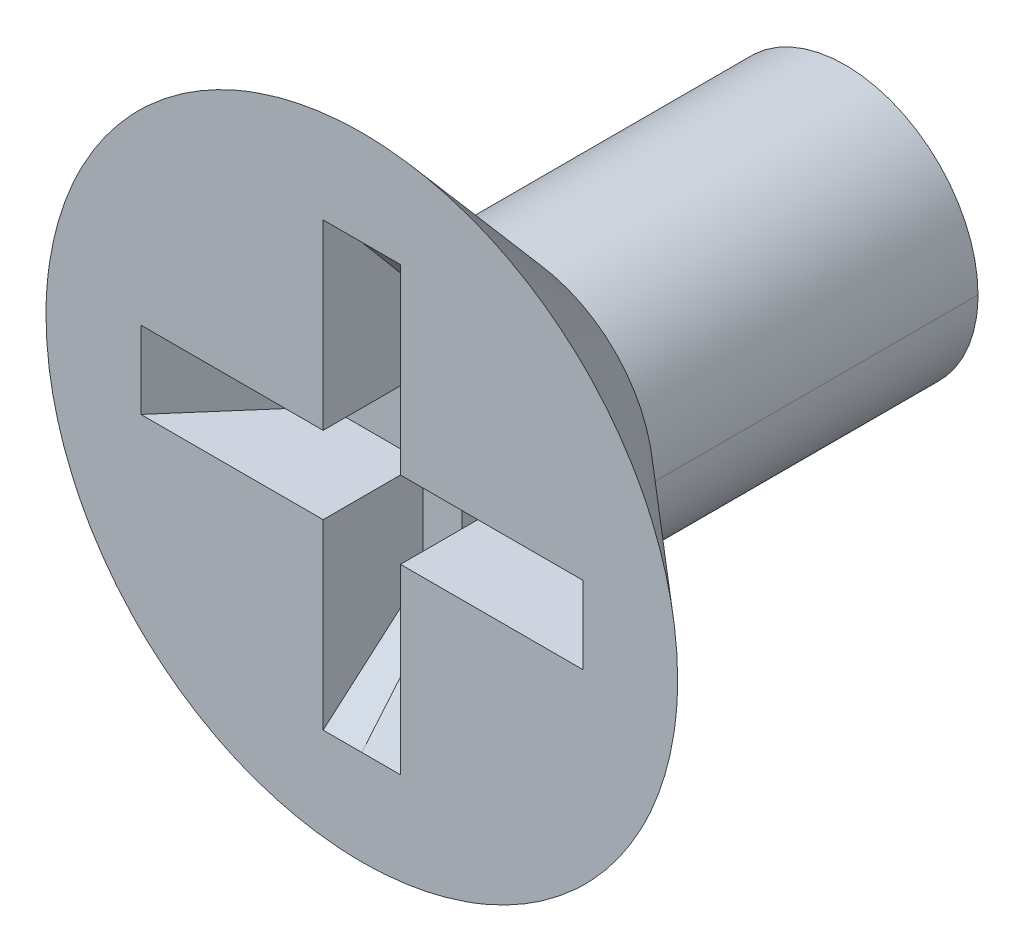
ISO-10303-21;
HEADER;
FILE_DESCRIPTION(('STEP AP214'),'2;1');
FILE_NAME('part.step','',(''),(''),'','','');
FILE_SCHEMA(('AUTOMOTIVE_DESIGN { 1 0 10303 214 1 1 1 1 }'));
ENDSEC;
DATA;
#1=APPLICATION_CONTEXT('core data for automotive mechanical design processes');
#2=APPLICATION_PROTOCOL_DEFINITION('international standard','automotive_design',2000,#1);
#3=PRODUCT_CONTEXT('',#1,'mechanical');
#4=PRODUCT('Part','Part','',(#3));
#5=PRODUCT_RELATED_PRODUCT_CATEGORY('part','',(#4));
#6=PRODUCT_DEFINITION_FORMATION('','',#4);
#7=PRODUCT_DEFINITION_CONTEXT('part definition',#1,'design');
#8=PRODUCT_DEFINITION('design','',#6,#7);
#9=PRODUCT_DEFINITION_SHAPE('','',#8);
#10=(LENGTH_UNIT() NAMED_UNIT(*) SI_UNIT(.MILLI.,.METRE.));
#11=(NAMED_UNIT(*) PLANE_ANGLE_UNIT() SI_UNIT($,.RADIAN.));
#12=(NAMED_UNIT(*) SI_UNIT($,.STERADIAN.) SOLID_ANGLE_UNIT());
#13=UNCERTAINTY_MEASURE_WITH_UNIT(LENGTH_MEASURE(1.E-05),#10,'distance_accuracy_value','');
#14=(GEOMETRIC_REPRESENTATION_CONTEXT(3) GLOBAL_UNCERTAINTY_ASSIGNED_CONTEXT((#13)) GLOBAL_UNIT_ASSIGNED_CONTEXT((#10,
#11,#12)) REPRESENTATION_CONTEXT('',''));
#15=CARTESIAN_POINT('',(0.,0.,0.));
#16=DIRECTION('',(0.,0.,1.));
#17=DIRECTION('',(1.,0.,0.));
#18=AXIS2_PLACEMENT_3D('',#15,#16,#17);
#19=CARTESIAN_POINT('',(0.,2.1766160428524,-0.984980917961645));
#20=DIRECTION('',(-1.,0.,0.));
#21=DIRECTION('',(0.,-1.,0.));
#22=AXIS2_PLACEMENT_3D('',#19,#20,#21);
#23=PLANE('',#22);
#24=CARTESIAN_POINT('',(0.,2.1766160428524,0.));
#25=CARTESIAN_POINT('',(0.,2.09835907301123,-0.0656653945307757));
#26=CARTESIAN_POINT('',(0.,2.02010210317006,-0.131330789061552));
#27=CARTESIAN_POINT('',(0.,1.86358816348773,-0.262661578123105));
#28=CARTESIAN_POINT('',(0.,1.78533119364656,-0.328326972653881));
#29=CARTESIAN_POINT('',(0.,1.62881725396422,-0.459657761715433));
#30=CARTESIAN_POINT('',(0.,1.55056028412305,-0.52532315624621));
#31=CARTESIAN_POINT('',(0.,1.39404634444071,-0.656653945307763));
#32=CARTESIAN_POINT('',(0.,1.31578937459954,-0.722319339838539));
#33=CARTESIAN_POINT('',(0.,1.15927543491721,-0.853650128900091));
#34=CARTESIAN_POINT('',(0.,1.08101846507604,-0.919315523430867));
#35=CARTESIAN_POINT('',(0.,1.00276149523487,-0.984980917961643));
#36=B_SPLINE_CURVE_WITH_KNOTS('',3,(#24,#25,#26,#27,#28,#29,#30,#31,#32,#33,#34,#35),
.UNSPECIFIED.,.F.,.F.,(4,2,2,2,2,4),(0.,0.2,0.4,0.6,0.8,1.),.UNSPECIFIED.);
#37=CARTESIAN_POINT('',(0.,2.1766160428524,0.));
#38=VERTEX_POINT('',#37);
#39=CARTESIAN_POINT('',(0.,1.00276149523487,-0.984980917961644));
#40=VERTEX_POINT('',#39);
#41=EDGE_CURVE('E29',#38,#40,#36,.T.);
#42=ORIENTED_EDGE('',*,*,#41,.F.);
#43=CARTESIAN_POINT('',(0.,2.1766160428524,0.));
#44=CARTESIAN_POINT('',(0.,2.11953398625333,-0.0656653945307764));
#45=CARTESIAN_POINT('',(0.,2.06245192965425,-0.131330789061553));
#46=CARTESIAN_POINT('',(0.,1.9482878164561,-0.262661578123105));
#47=CARTESIAN_POINT('',(0.,1.89120575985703,-0.328326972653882));
#48=CARTESIAN_POINT('',(0.,1.77704164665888,-0.459657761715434));
#49=CARTESIAN_POINT('',(0.,1.71995959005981,-0.525323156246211));
#50=CARTESIAN_POINT('',(0.,1.60579547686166,-0.656653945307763));
#51=CARTESIAN_POINT('',(0.,1.54871342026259,-0.72231933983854));
#52=CARTESIAN_POINT('',(0.,1.43454930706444,-0.853650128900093));
#53=CARTESIAN_POINT('',(0.,1.37746725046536,-0.919315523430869));
#54=CARTESIAN_POINT('',(0.,1.32038519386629,-0.984980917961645));
#55=B_SPLINE_CURVE_WITH_KNOTS('',3,(#43,#44,#45,#46,#47,#48,#49,#50,#51,#52,#53,#54),
.UNSPECIFIED.,.F.,.F.,(4,2,2,2,2,4),(0.,0.2,0.4,0.6,0.8,1.),.UNSPECIFIED.);
#56=CARTESIAN_POINT('',(0.,1.32038519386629,-0.984980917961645));
#57=VERTEX_POINT('',#56);
#58=EDGE_CURVE('E10',#38,#57,#55,.T.);
#59=ORIENTED_EDGE('',*,*,#58,.T.);
#60=CARTESIAN_POINT('',(0.,1.32038519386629,-0.984980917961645));
#61=CARTESIAN_POINT('',(0.,1.29921028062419,-0.984980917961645));
#62=CARTESIAN_POINT('',(0.,1.2780353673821,-0.984980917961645));
#63=CARTESIAN_POINT('',(0.,1.23568554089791,-0.984980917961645));
#64=CARTESIAN_POINT('',(0.,1.21451062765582,-0.984980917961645));
#65=CARTESIAN_POINT('',(0.,1.17216080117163,-0.984980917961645));
#66=CARTESIAN_POINT('',(0.,1.15098588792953,-0.984980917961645));
#67=CARTESIAN_POINT('',(0.,1.10863606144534,-0.984980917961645));
#68=CARTESIAN_POINT('',(0.,1.08746114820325,-0.984980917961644));
#69=CARTESIAN_POINT('',(0.,1.04511132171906,-0.984980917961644));
#70=CARTESIAN_POINT('',(0.,1.02393640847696,-0.984980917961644));
#71=CARTESIAN_POINT('',(0.,1.00276149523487,-0.984980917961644));
#72=B_SPLINE_CURVE_WITH_KNOTS('',3,(#60,#61,#62,#63,#64,#65,#66,#67,#68,#69,#70,#71),
.UNSPECIFIED.,.F.,.F.,(4,2,2,2,2,4),(0.,0.2,0.4,0.6,0.8,1.),.UNSPECIFIED.);
#73=EDGE_CURVE('E24',#57,#40,#72,.T.);
#74=ORIENTED_EDGE('',*,*,#73,.T.);
#75=EDGE_LOOP('',(#42,#59,#74));
#76=FACE_BOUND('',#75,.T.);
#77=ADVANCED_FACE('F15',(#76),#23,.T.);
#78=CARTESIAN_POINT('',(0.381,2.1766160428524,0.));
#79=DIRECTION('',(0.,-0.642787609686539,0.766044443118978));
#80=DIRECTION('',(-1.,0.,0.));
#81=AXIS2_PLACEMENT_3D('',#78,#79,#80);
#82=PLANE('',#81);
#83=CARTESIAN_POINT('',(0.381,2.1766160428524,0.));
#84=CARTESIAN_POINT('',(0.381,2.06414525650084,-0.0943741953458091));
#85=CARTESIAN_POINT('',(0.381,1.95167447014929,-0.188748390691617));
#86=CARTESIAN_POINT('',(0.381,1.72673289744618,-0.377496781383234));
#87=CARTESIAN_POINT('',(0.381,1.61426211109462,-0.471870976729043));
#88=CARTESIAN_POINT('',(0.381,1.38932053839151,-0.660619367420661));
#89=CARTESIAN_POINT('',(0.381,1.27684975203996,-0.754993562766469));
#90=CARTESIAN_POINT('',(0.381,1.05190817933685,-0.943741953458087));
#91=CARTESIAN_POINT('',(0.381,0.939437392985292,-1.0381161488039));
#92=CARTESIAN_POINT('',(0.381,0.714495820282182,-1.22686453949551));
#93=CARTESIAN_POINT('',(0.381,0.602025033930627,-1.32123873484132));
#94=CARTESIAN_POINT('',(0.381,0.489554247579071,-1.41561293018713));
#95=B_SPLINE_CURVE_WITH_KNOTS('',3,(#83,#84,#85,#86,#87,#88,#89,#90,#91,#92,#93,#94),
.UNSPECIFIED.,.F.,.F.,(4,2,2,2,2,4),(0.,0.2,0.4,0.6,0.8,1.),.UNSPECIFIED.);
#96=CARTESIAN_POINT('',(0.381,2.1766160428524,0.));
#97=VERTEX_POINT('',#96);
#98=CARTESIAN_POINT('',(0.381,0.489554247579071,-1.41561293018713));
#99=VERTEX_POINT('',#98);
#100=EDGE_CURVE('E506',#97,#99,#95,.T.);
#101=ORIENTED_EDGE('',*,*,#100,.F.);
#102=CARTESIAN_POINT('',(0.,2.1766160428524,0.));
#103=CARTESIAN_POINT('',(0.0254000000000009,2.1766160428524,0.));
#104=CARTESIAN_POINT('',(0.0507999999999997,2.1766160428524,0.));
#105=CARTESIAN_POINT('',(0.101600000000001,2.1766160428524,0.));
#106=CARTESIAN_POINT('',(0.127,2.1766160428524,0.));
#107=CARTESIAN_POINT('',(0.1778,2.1766160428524,0.));
#108=CARTESIAN_POINT('',(0.2032,2.1766160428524,0.));
#109=CARTESIAN_POINT('',(0.254000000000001,2.1766160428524,0.));
#110=CARTESIAN_POINT('',(0.2794,2.1766160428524,0.));
#111=CARTESIAN_POINT('',(0.330200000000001,2.1766160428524,0.));
#112=CARTESIAN_POINT('',(0.3556,2.1766160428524,0.));
#113=CARTESIAN_POINT('',(0.381000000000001,2.1766160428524,0.));
#114=B_SPLINE_CURVE_WITH_KNOTS('',3,(#102,#103,#104,#105,#106,#107,#108,#109,#110,#111,#112,
#113),.UNSPECIFIED.,.F.,.F.,(4,2,2,2,2,4),(0.,0.2,0.4,0.6,0.8,1.),.UNSPECIFIED.);
#115=EDGE_CURVE('E474',#38,#97,#114,.T.);
#116=ORIENTED_EDGE('',*,*,#115,.F.);
#117=ORIENTED_EDGE('',*,*,#41,.T.);
#118=CARTESIAN_POINT('',(0.,1.00276149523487,-0.984980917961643));
#119=CARTESIAN_POINT('',(0.,0.968547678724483,-1.01368971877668));
#120=CARTESIAN_POINT('',(0.,0.934333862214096,-1.04239851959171));
#121=CARTESIAN_POINT('',(0.,0.865906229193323,-1.09981612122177));
#122=CARTESIAN_POINT('',(0.,0.831692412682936,-1.12852492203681));
#123=CARTESIAN_POINT('',(0.,0.763264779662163,-1.18594252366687));
#124=CARTESIAN_POINT('',(0.,0.729050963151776,-1.2146513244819));
#125=CARTESIAN_POINT('',(0.,0.660623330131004,-1.27206892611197));
#126=CARTESIAN_POINT('',(0.,0.626409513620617,-1.300777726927));
#127=CARTESIAN_POINT('',(0.,0.557981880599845,-1.35819532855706));
#128=CARTESIAN_POINT('',(0.,0.523768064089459,-1.3869041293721));
#129=CARTESIAN_POINT('',(0.,0.489554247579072,-1.41561293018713));
#130=B_SPLINE_CURVE_WITH_KNOTS('',3,(#118,#119,#120,#121,#122,#123,#124,#125,#126,#127,#128,
#129),.UNSPECIFIED.,.F.,.F.,(4,2,2,2,2,4),(0.,0.2,0.4,0.6,0.8,1.),.UNSPECIFIED.);
#131=CARTESIAN_POINT('',(0.,0.489554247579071,-1.41561293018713));
#132=VERTEX_POINT('',#131);
#133=EDGE_CURVE('E520',#40,#132,#130,.T.);
#134=ORIENTED_EDGE('',*,*,#133,.T.);
#135=CARTESIAN_POINT('',(0.,0.489554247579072,-1.41561293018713));
#136=CARTESIAN_POINT('',(0.0254,0.489554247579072,-1.41561293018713));
#137=CARTESIAN_POINT('',(0.0507999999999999,0.489554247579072,-1.41561293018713));
#138=CARTESIAN_POINT('',(0.1016,0.489554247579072,-1.41561293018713));
#139=CARTESIAN_POINT('',(0.127,0.489554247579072,-1.41561293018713));
#140=CARTESIAN_POINT('',(0.1778,0.489554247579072,-1.41561293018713));
#141=CARTESIAN_POINT('',(0.2032,0.489554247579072,-1.41561293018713));
#142=CARTESIAN_POINT('',(0.254,0.489554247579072,-1.41561293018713));
#143=CARTESIAN_POINT('',(0.2794,0.489554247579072,-1.41561293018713));
#144=CARTESIAN_POINT('',(0.3302,0.489554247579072,-1.41561293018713));
#145=CARTESIAN_POINT('',(0.3556,0.489554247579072,-1.41561293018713));
#146=CARTESIAN_POINT('',(0.381,0.489554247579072,-1.41561293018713));
#147=B_SPLINE_CURVE_WITH_KNOTS('',3,(#135,#136,#137,#138,#139,#140,#141,#142,#143,#144,#145,
#146),.UNSPECIFIED.,.F.,.F.,(4,2,2,2,2,4),(0.,0.2,0.4,0.6,0.8,1.),.UNSPECIFIED.);
#148=EDGE_CURVE('E518',#132,#99,#147,.T.);
#149=ORIENTED_EDGE('',*,*,#148,.T.);
#150=EDGE_LOOP('',(#101,#116,#117,#134,#149));
#151=FACE_BOUND('',#150,.T.);
#152=ADVANCED_FACE('F556',(#151),#82,.T.);
#153=CARTESIAN_POINT('',(-0.381,1.32038519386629,-0.984980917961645));
#154=DIRECTION('',(0.,-0.754709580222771,0.656059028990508));
#155=DIRECTION('',(1.,0.,0.));
#156=AXIS2_PLACEMENT_3D('',#153,#154,#155);
#157=PLANE('',#156);
#158=CARTESIAN_POINT('',(-0.381,1.32038519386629,-0.984980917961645));
#159=CARTESIAN_POINT('',(-0.381,1.37746725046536,-0.919315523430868));
#160=CARTESIAN_POINT('',(-0.381,1.43454930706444,-0.853650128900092));
#161=CARTESIAN_POINT('',(-0.381,1.54871342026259,-0.722319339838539));
#162=CARTESIAN_POINT('',(-0.381,1.60579547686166,-0.656653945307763));
#163=CARTESIAN_POINT('',(-0.381,1.71995959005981,-0.525323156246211));
#164=CARTESIAN_POINT('',(-0.381,1.77704164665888,-0.459657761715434));
#165=CARTESIAN_POINT('',(-0.381,1.89120575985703,-0.328326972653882));
#166=CARTESIAN_POINT('',(-0.381,1.9482878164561,-0.262661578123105));
#167=CARTESIAN_POINT('',(-0.381,2.06245192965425,-0.131330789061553));
#168=CARTESIAN_POINT('',(-0.381,2.11953398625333,-0.0656653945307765));
#169=CARTESIAN_POINT('',(-0.381,2.1766160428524,0.));
#170=B_SPLINE_CURVE_WITH_KNOTS('',3,(#158,#159,#160,#161,#162,#163,#164,#165,#166,#167,#168,
#169),.UNSPECIFIED.,.F.,.F.,(4,2,2,2,2,4),(0.,0.2,0.4,0.6,0.8,1.),.UNSPECIFIED.);
#171=CARTESIAN_POINT('',(-0.381,1.32038519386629,-0.984980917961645));
#172=VERTEX_POINT('',#171);
#173=CARTESIAN_POINT('',(-0.381,2.1766160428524,0.));
#174=VERTEX_POINT('',#173);
#175=EDGE_CURVE('E430',#172,#174,#170,.T.);
#176=ORIENTED_EDGE('',*,*,#175,.F.);
#177=CARTESIAN_POINT('',(0.,1.32038519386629,-0.984980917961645));
#178=CARTESIAN_POINT('',(-0.0254,1.32038519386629,-0.984980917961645));
#179=CARTESIAN_POINT('',(-0.0508,1.32038519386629,-0.984980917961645));
#180=CARTESIAN_POINT('',(-0.1016,1.32038519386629,-0.984980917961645));
#181=CARTESIAN_POINT('',(-0.127,1.32038519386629,-0.984980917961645));
#182=CARTESIAN_POINT('',(-0.1778,1.32038519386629,-0.984980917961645));
#183=CARTESIAN_POINT('',(-0.2032,1.32038519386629,-0.984980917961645));
#184=CARTESIAN_POINT('',(-0.254,1.32038519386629,-0.984980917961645));
#185=CARTESIAN_POINT('',(-0.2794,1.32038519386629,-0.984980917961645));
#186=CARTESIAN_POINT('',(-0.3302,1.32038519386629,-0.984980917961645));
#187=CARTESIAN_POINT('',(-0.3556,1.32038519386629,-0.984980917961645));
#188=CARTESIAN_POINT('',(-0.381,1.32038519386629,-0.984980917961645));
#189=B_SPLINE_CURVE_WITH_KNOTS('',3,(#177,#178,#179,#180,#181,#182,#183,#184,#185,#186,#187,
#188),.UNSPECIFIED.,.F.,.F.,(4,2,2,2,2,4),(0.,0.2,0.4,0.6,0.8,1.),.UNSPECIFIED.);
#190=EDGE_CURVE('E511',#57,#172,#189,.T.);
#191=ORIENTED_EDGE('',*,*,#190,.F.);
#192=ORIENTED_EDGE('',*,*,#58,.F.);
#193=CARTESIAN_POINT('',(-0.381,2.1766160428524,0.));
#194=CARTESIAN_POINT('',(-0.355599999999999,2.1766160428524,0.));
#195=CARTESIAN_POINT('',(-0.330199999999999,2.1766160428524,0.));
#196=CARTESIAN_POINT('',(-0.2794,2.1766160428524,0.));
#197=CARTESIAN_POINT('',(-0.254,2.1766160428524,0.));
#198=CARTESIAN_POINT('',(-0.2032,2.1766160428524,0.));
#199=CARTESIAN_POINT('',(-0.1778,2.1766160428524,0.));
#200=CARTESIAN_POINT('',(-0.127,2.1766160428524,0.));
#201=CARTESIAN_POINT('',(-0.1016,2.1766160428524,0.));
#202=CARTESIAN_POINT('',(-0.0507999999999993,2.1766160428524,0.));
#203=CARTESIAN_POINT('',(-0.0254000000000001,2.1766160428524,0.));
#204=CARTESIAN_POINT('',(0.,2.1766160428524,0.));
#205=B_SPLINE_CURVE_WITH_KNOTS('',3,(#193,#194,#195,#196,#197,#198,#199,#200,#201,#202,#203,
#204),.UNSPECIFIED.,.F.,.F.,(4,2,2,2,2,4),(0.,0.2,0.4,0.6,0.8,1.),.UNSPECIFIED.);
#206=EDGE_CURVE('E478',#174,#38,#205,.T.);
#207=ORIENTED_EDGE('',*,*,#206,.F.);
#208=EDGE_LOOP('',(#176,#191,#192,#207));
#209=FACE_BOUND('',#208,.T.);
#210=ADVANCED_FACE('F565',(#209),#157,.T.);
#211=CARTESIAN_POINT('',(0.,-1.32038519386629,-0.984980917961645));
#212=DIRECTION('',(0.,0.,1.));
#213=DIRECTION('',(0.,1.,0.));
#214=AXIS2_PLACEMENT_3D('',#211,#212,#213);
#215=PLANE('',#214);
#216=CARTESIAN_POINT('',(-1.32038519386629,0.381,-0.984980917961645));
#217=CARTESIAN_POINT('',(-1.2577595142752,0.381,-0.984980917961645));
#218=CARTESIAN_POINT('',(-1.19513383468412,0.381,-0.984980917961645));
#219=CARTESIAN_POINT('',(-1.06988247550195,0.381,-0.984980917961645));
#220=CARTESIAN_POINT('',(-1.00725679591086,0.381,-0.984980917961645));
#221=CARTESIAN_POINT('',(-0.882005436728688,0.381,-0.984980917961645));
#222=CARTESIAN_POINT('',(-0.819379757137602,0.381,-0.984980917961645));
#223=CARTESIAN_POINT('',(-0.69412839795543,0.381,-0.984980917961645));
#224=CARTESIAN_POINT('',(-0.631502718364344,0.381,-0.984980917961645));
#225=CARTESIAN_POINT('',(-0.506251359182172,0.381,-0.984980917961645));
#226=CARTESIAN_POINT('',(-0.443625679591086,0.381,-0.984980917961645));
#227=CARTESIAN_POINT('',(-0.381,0.381,-0.984980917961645));
#228=B_SPLINE_CURVE_WITH_KNOTS('',3,(#216,#217,#218,#219,#220,#221,#222,#223,#224,#225,#226,
#227),.UNSPECIFIED.,.F.,.F.,(4,2,2,2,2,4),(0.,0.2,0.4,0.6,0.8,1.),.UNSPECIFIED.);
#229=CARTESIAN_POINT('',(-1.32038519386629,0.381,-0.984980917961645));
#230=VERTEX_POINT('',#229);
#231=CARTESIAN_POINT('',(-0.381,0.381,-0.984980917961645));
#232=VERTEX_POINT('',#231);
#233=EDGE_CURVE('E417',#230,#232,#228,.T.);
#234=ORIENTED_EDGE('',*,*,#233,.F.);
#235=CARTESIAN_POINT('',(-1.32038519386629,0.381,-0.984980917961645));
#236=CARTESIAN_POINT('',(-1.32038519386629,0.3302,-0.984980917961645));
#237=CARTESIAN_POINT('',(-1.32038519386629,0.279400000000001,-0.984980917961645));
#238=CARTESIAN_POINT('',(-1.32038519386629,0.177800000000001,-0.984980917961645));
#239=CARTESIAN_POINT('',(-1.32038519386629,0.127000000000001,-0.984980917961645));
#240=CARTESIAN_POINT('',(-1.32038519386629,0.0254000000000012,-0.984980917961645));
#241=CARTESIAN_POINT('',(-1.32038519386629,-0.0254000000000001,-0.984980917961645));
#242=CARTESIAN_POINT('',(-1.32038519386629,-0.127,-0.984980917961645));
#243=CARTESIAN_POINT('',(-1.32038519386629,-0.1778,-0.984980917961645));
#244=CARTESIAN_POINT('',(-1.32038519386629,-0.2794,-0.984980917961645));
#245=CARTESIAN_POINT('',(-1.32038519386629,-0.3302,-0.984980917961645));
#246=CARTESIAN_POINT('',(-1.32038519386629,-0.381,-0.984980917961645));
#247=B_SPLINE_CURVE_WITH_KNOTS('',3,(#235,#236,#237,#238,#239,#240,#241,#242,#243,#244,#245,
#246),.UNSPECIFIED.,.F.,.F.,(4,2,2,2,2,4),(0.,0.2,0.4,0.6,0.8,1.),.UNSPECIFIED.);
#248=CARTESIAN_POINT('',(-1.32038519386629,-0.381,-0.984980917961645));
#249=VERTEX_POINT('',#248);
#250=EDGE_CURVE('E514',#230,#249,#247,.T.);
#251=ORIENTED_EDGE('',*,*,#250,.T.);
#252=CARTESIAN_POINT('',(-0.381,-0.381,-0.984980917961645));
#253=CARTESIAN_POINT('',(-0.443625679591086,-0.381,-0.984980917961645));
#254=CARTESIAN_POINT('',(-0.506251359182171,-0.381,-0.984980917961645));
#255=CARTESIAN_POINT('',(-0.631502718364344,-0.381,-0.984980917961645));
#256=CARTESIAN_POINT('',(-0.69412839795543,-0.381,-0.984980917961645));
#257=CARTESIAN_POINT('',(-0.819379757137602,-0.381,-0.984980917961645));
#258=CARTESIAN_POINT('',(-0.882005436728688,-0.381,-0.984980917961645));
#259=CARTESIAN_POINT('',(-1.00725679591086,-0.381,-0.984980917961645));
#260=CARTESIAN_POINT('',(-1.06988247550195,-0.381,-0.984980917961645));
#261=CARTESIAN_POINT('',(-1.19513383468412,-0.381,-0.984980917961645));
#262=CARTESIAN_POINT('',(-1.2577595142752,-0.381,-0.984980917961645));
#263=CARTESIAN_POINT('',(-1.32038519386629,-0.381,-0.984980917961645));
#264=B_SPLINE_CURVE_WITH_KNOTS('',3,(#252,#253,#254,#255,#256,#257,#258,#259,#260,#261,#262,
#263),.UNSPECIFIED.,.F.,.F.,(4,2,2,2,2,4),(0.,0.2,0.4,0.6,0.8,1.),.UNSPECIFIED.);
#265=CARTESIAN_POINT('',(-0.381,-0.381,-0.984980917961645));
#266=VERTEX_POINT('',#265);
#267=EDGE_CURVE('E408',#266,#249,#264,.T.);
#268=ORIENTED_EDGE('',*,*,#267,.F.);
#269=CARTESIAN_POINT('',(-0.381,-1.32038519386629,-0.984980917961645));
#270=CARTESIAN_POINT('',(-0.381,-1.2577595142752,-0.984980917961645));
#271=CARTESIAN_POINT('',(-0.381,-1.19513383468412,-0.984980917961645));
#272=CARTESIAN_POINT('',(-0.381,-1.06988247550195,-0.984980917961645));
#273=CARTESIAN_POINT('',(-0.381,-1.00725679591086,-0.984980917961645));
#274=CARTESIAN_POINT('',(-0.381,-0.882005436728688,-0.984980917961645));
#275=CARTESIAN_POINT('',(-0.381,-0.819379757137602,-0.984980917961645));
#276=CARTESIAN_POINT('',(-0.381,-0.69412839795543,-0.984980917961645));
#277=CARTESIAN_POINT('',(-0.381,-0.631502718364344,-0.984980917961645));
#278=CARTESIAN_POINT('',(-0.381,-0.506251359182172,-0.984980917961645));
#279=CARTESIAN_POINT('',(-0.381,-0.443625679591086,-0.984980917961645));
#280=CARTESIAN_POINT('',(-0.381,-0.381,-0.984980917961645));
#281=B_SPLINE_CURVE_WITH_KNOTS('',3,(#269,#270,#271,#272,#273,#274,#275,#276,#277,#278,#279,
#280),.UNSPECIFIED.,.F.,.F.,(4,2,2,2,2,4),(0.,0.2,0.4,0.6,0.8,1.),.UNSPECIFIED.);
#282=CARTESIAN_POINT('',(-0.381,-1.32038519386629,-0.984980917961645));
#283=VERTEX_POINT('',#282);
#284=EDGE_CURVE('E394',#283,#266,#281,.T.);
#285=ORIENTED_EDGE('',*,*,#284,.F.);
#286=CARTESIAN_POINT('',(0.,-1.32038519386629,-0.984980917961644));
#287=CARTESIAN_POINT('',(-0.0254,-1.32038519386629,-0.984980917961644));
#288=CARTESIAN_POINT('',(-0.0508,-1.32038519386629,-0.984980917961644));
#289=CARTESIAN_POINT('',(-0.1016,-1.32038519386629,-0.984980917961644));
#290=CARTESIAN_POINT('',(-0.127,-1.32038519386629,-0.984980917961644));
#291=CARTESIAN_POINT('',(-0.1778,-1.32038519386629,-0.984980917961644));
#292=CARTESIAN_POINT('',(-0.2032,-1.32038519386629,-0.984980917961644));
#293=CARTESIAN_POINT('',(-0.254,-1.32038519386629,-0.984980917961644));
#294=CARTESIAN_POINT('',(-0.2794,-1.32038519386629,-0.984980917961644));
#295=CARTESIAN_POINT('',(-0.3302,-1.32038519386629,-0.984980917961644));
#296=CARTESIAN_POINT('',(-0.3556,-1.32038519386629,-0.984980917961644));
#297=CARTESIAN_POINT('',(-0.381,-1.32038519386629,-0.984980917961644));
#298=B_SPLINE_CURVE_WITH_KNOTS('',3,(#286,#287,#288,#289,#290,#291,#292,#293,#294,#295,#296,
#297),.UNSPECIFIED.,.F.,.F.,(4,2,2,2,2,4),(0.,0.2,0.4,0.6,0.8,1.),.UNSPECIFIED.);
#299=CARTESIAN_POINT('',(0.,-1.32038519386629,-0.984980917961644));
#300=VERTEX_POINT('',#299);
#301=EDGE_CURVE('E391',#300,#283,#298,.T.);
#302=ORIENTED_EDGE('',*,*,#301,.F.);
#303=CARTESIAN_POINT('',(0.,-1.00276149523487,-0.984980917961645));
#304=CARTESIAN_POINT('',(0.,-1.02393640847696,-0.984980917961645));
#305=CARTESIAN_POINT('',(0.,-1.04511132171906,-0.984980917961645));
#306=CARTESIAN_POINT('',(0.,-1.08746114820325,-0.984980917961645));
#307=CARTESIAN_POINT('',(0.,-1.10863606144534,-0.984980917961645));
#308=CARTESIAN_POINT('',(0.,-1.15098588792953,-0.984980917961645));
#309=CARTESIAN_POINT('',(0.,-1.17216080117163,-0.984980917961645));
#310=CARTESIAN_POINT('',(0.,-1.21451062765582,-0.984980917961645));
#311=CARTESIAN_POINT('',(0.,-1.23568554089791,-0.984980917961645));
#312=CARTESIAN_POINT('',(0.,-1.2780353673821,-0.984980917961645));
#313=CARTESIAN_POINT('',(0.,-1.2992102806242,-0.984980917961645));
#314=CARTESIAN_POINT('',(0.,-1.32038519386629,-0.984980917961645));
#315=B_SPLINE_CURVE_WITH_KNOTS('',3,(#303,#304,#305,#306,#307,#308,#309,#310,#311,#312,#313,
#314),.UNSPECIFIED.,.F.,.F.,(4,2,2,2,2,4),(0.,0.2,0.4,0.600000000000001,0.8,1.),.UNSPECIFIED.);
#316=CARTESIAN_POINT('',(0.,-1.00276149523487,-0.984980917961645));
#317=VERTEX_POINT('',#316);
#318=EDGE_CURVE('E386',#317,#300,#315,.T.);
#319=ORIENTED_EDGE('',*,*,#318,.F.);
#320=CARTESIAN_POINT('',(0.,1.00276149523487,-0.984980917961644));
#321=CARTESIAN_POINT('',(0.,0.869059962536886,-0.984980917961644));
#322=CARTESIAN_POINT('',(0.,0.735358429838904,-0.984980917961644));
#323=CARTESIAN_POINT('',(0.,0.467955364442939,-0.984980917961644));
#324=CARTESIAN_POINT('',(0.,0.334253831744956,-0.984980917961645));
#325=CARTESIAN_POINT('',(0.,0.066850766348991,-0.984980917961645));
#326=CARTESIAN_POINT('',(0.,-0.0668507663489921,-0.984980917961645));
#327=CARTESIAN_POINT('',(0.,-0.334253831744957,-0.984980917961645));
#328=CARTESIAN_POINT('',(0.,-0.46795536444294,-0.984980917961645));
#329=CARTESIAN_POINT('',(0.,-0.735358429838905,-0.984980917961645));
#330=CARTESIAN_POINT('',(0.,-0.869059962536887,-0.984980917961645));
#331=CARTESIAN_POINT('',(0.,-1.00276149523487,-0.984980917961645));
#332=B_SPLINE_CURVE_WITH_KNOTS('',3,(#320,#321,#322,#323,#324,#325,#326,#327,#328,#329,#330,
#331),.UNSPECIFIED.,.F.,.F.,(4,2,2,2,2,4),(0.,0.2,0.4,0.6,0.8,1.),.UNSPECIFIED.);
#333=EDGE_CURVE('E448',#40,#317,#332,.T.);
#334=ORIENTED_EDGE('',*,*,#333,.F.);
#335=ORIENTED_EDGE('',*,*,#73,.F.);
#336=ORIENTED_EDGE('',*,*,#190,.T.);
#337=CARTESIAN_POINT('',(-0.381,0.381,-0.984980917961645));
#338=CARTESIAN_POINT('',(-0.381,0.443625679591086,-0.984980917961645));
#339=CARTESIAN_POINT('',(-0.381,0.506251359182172,-0.984980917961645));
#340=CARTESIAN_POINT('',(-0.381,0.631502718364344,-0.984980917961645));
#341=CARTESIAN_POINT('',(-0.381,0.69412839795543,-0.984980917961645));
#342=CARTESIAN_POINT('',(-0.381,0.819379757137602,-0.984980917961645));
#343=CARTESIAN_POINT('',(-0.381,0.882005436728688,-0.984980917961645));
#344=CARTESIAN_POINT('',(-0.381,1.00725679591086,-0.984980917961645));
#345=CARTESIAN_POINT('',(-0.381,1.06988247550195,-0.984980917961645));
#346=CARTESIAN_POINT('',(-0.381,1.19513383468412,-0.984980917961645));
#347=CARTESIAN_POINT('',(-0.381,1.2577595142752,-0.984980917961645));
#348=CARTESIAN_POINT('',(-0.381,1.32038519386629,-0.984980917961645));
#349=B_SPLINE_CURVE_WITH_KNOTS('',3,(#337,#338,#339,#340,#341,#342,#343,#344,#345,#346,#347,
#348),.UNSPECIFIED.,.F.,.F.,(4,2,2,2,2,4),(0.,0.2,0.4,0.6,0.8,1.),.UNSPECIFIED.);
#350=EDGE_CURVE('E434',#232,#172,#349,.T.);
#351=ORIENTED_EDGE('',*,*,#350,.F.);
#352=EDGE_LOOP('',(#234,#251,#268,#285,#302,#319,#334,#335,#336,#351));
#353=FACE_BOUND('',#352,.T.);
#354=ADVANCED_FACE('F645',(#353),#215,.T.);
#355=CARTESIAN_POINT('',(0.381,2.1766160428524,-1.41561293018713));
#356=DIRECTION('',(-1.,0.,0.));
#357=DIRECTION('',(0.,-1.,0.));
#358=AXIS2_PLACEMENT_3D('',#355,#356,#357);
#359=PLANE('',#358);
#360=CARTESIAN_POINT('',(0.381,0.381,-0.984980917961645));
#361=CARTESIAN_POINT('',(0.381,0.381,-0.919315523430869));
#362=CARTESIAN_POINT('',(0.381,0.380999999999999,-0.853650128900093));
#363=CARTESIAN_POINT('',(0.381,0.380999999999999,-0.72231933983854));
#364=CARTESIAN_POINT('',(0.381,0.381,-0.656653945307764));
#365=CARTESIAN_POINT('',(0.381,0.381,-0.525323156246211));
#366=CARTESIAN_POINT('',(0.381,0.381,-0.459657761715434));
#367=CARTESIAN_POINT('',(0.381,0.381,-0.328326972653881));
#368=CARTESIAN_POINT('',(0.381,0.381,-0.262661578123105));
#369=CARTESIAN_POINT('',(0.381,0.381,-0.131330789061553));
#370=CARTESIAN_POINT('',(0.381,0.381,-0.065665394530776));
#371=CARTESIAN_POINT('',(0.381,0.381,0.));
#372=B_SPLINE_CURVE_WITH_KNOTS('',3,(#360,#361,#362,#363,#364,#365,#366,#367,#368,#369,#370,
#371),.UNSPECIFIED.,.F.,.F.,(4,2,2,2,2,4),(0.,0.2,0.4,0.6,0.8,1.),.UNSPECIFIED.);
#373=CARTESIAN_POINT('',(0.381,0.381,-0.984980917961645));
#374=VERTEX_POINT('',#373);
#375=CARTESIAN_POINT('',(0.381,0.381,0.));
#376=VERTEX_POINT('',#375);
#377=EDGE_CURVE('E509',#374,#376,#372,.T.);
#378=ORIENTED_EDGE('',*,*,#377,.T.);
#379=CARTESIAN_POINT('',(0.381000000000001,2.1766160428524,0.));
#380=CARTESIAN_POINT('',(0.381000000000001,2.05690830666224,0.));
#381=CARTESIAN_POINT('',(0.381000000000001,1.93720057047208,0.));
#382=CARTESIAN_POINT('',(0.381000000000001,1.69778509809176,0.));
#383=CARTESIAN_POINT('',(0.381000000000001,1.5780773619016,0.));
#384=CARTESIAN_POINT('',(0.381000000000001,1.33866188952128,0.));
#385=CARTESIAN_POINT('',(0.381000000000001,1.21895415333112,0.));
#386=CARTESIAN_POINT('',(0.381000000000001,0.9795386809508,0.));
#387=CARTESIAN_POINT('',(0.381000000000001,0.859830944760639,0.));
#388=CARTESIAN_POINT('',(0.381000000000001,0.62041547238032,0.));
#389=CARTESIAN_POINT('',(0.381000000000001,0.500707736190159,0.));
#390=CARTESIAN_POINT('',(0.381000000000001,0.380999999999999,0.));
#391=B_SPLINE_CURVE_WITH_KNOTS('',3,(#379,#380,#381,#382,#383,#384,#385,#386,#387,#388,#389,
#390),.UNSPECIFIED.,.F.,.F.,(4,2,2,2,2,4),(0.,0.2,0.4,0.6,0.8,1.),.UNSPECIFIED.);
#392=EDGE_CURVE('E471',#97,#376,#391,.T.);
#393=ORIENTED_EDGE('',*,*,#392,.F.);
#394=ORIENTED_EDGE('',*,*,#100,.T.);
#395=CARTESIAN_POINT('',(0.381,0.489554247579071,-1.41561293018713));
#396=CARTESIAN_POINT('',(0.381,0.424280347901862,-1.41561293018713));
#397=CARTESIAN_POINT('',(0.381,0.359006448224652,-1.41561293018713));
#398=CARTESIAN_POINT('',(0.381,0.228458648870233,-1.41561293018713));
#399=CARTESIAN_POINT('',(0.381,0.163184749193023,-1.41561293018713));
#400=CARTESIAN_POINT('',(0.381,0.0326369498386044,-1.41561293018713));
#401=CARTESIAN_POINT('',(0.381,-0.0326369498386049,-1.41561293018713));
#402=CARTESIAN_POINT('',(0.381,-0.163184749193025,-1.41561293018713));
#403=CARTESIAN_POINT('',(0.381,-0.228458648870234,-1.41561293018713));
#404=CARTESIAN_POINT('',(0.381,-0.359006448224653,-1.41561293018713));
#405=CARTESIAN_POINT('',(0.381,-0.424280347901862,-1.41561293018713));
#406=CARTESIAN_POINT('',(0.381,-0.489554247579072,-1.41561293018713));
#407=B_SPLINE_CURVE_WITH_KNOTS('',3,(#395,#396,#397,#398,#399,#400,#401,#402,#403,#404,#405,
#406),.UNSPECIFIED.,.F.,.F.,(4,2,2,2,2,4),(0.,0.2,0.4,0.6,0.8,1.),.UNSPECIFIED.);
#408=CARTESIAN_POINT('',(0.381,-0.489554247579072,-1.41561293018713));
#409=VERTEX_POINT('',#408);
#410=EDGE_CURVE('E504',#99,#409,#407,.T.);
#411=ORIENTED_EDGE('',*,*,#410,.T.);
#412=CARTESIAN_POINT('',(0.381,-0.489554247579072,-1.41561293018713));
#413=CARTESIAN_POINT('',(0.381,-0.602025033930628,-1.32123873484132));
#414=CARTESIAN_POINT('',(0.381,-0.714495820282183,-1.22686453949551));
#415=CARTESIAN_POINT('',(0.381,-0.939437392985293,-1.0381161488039));
#416=CARTESIAN_POINT('',(0.381,-1.05190817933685,-0.943741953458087));
#417=CARTESIAN_POINT('',(0.381,-1.27684975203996,-0.754993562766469));
#418=CARTESIAN_POINT('',(0.381,-1.38932053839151,-0.660619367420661));
#419=CARTESIAN_POINT('',(0.381,-1.61426211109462,-0.471870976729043));
#420=CARTESIAN_POINT('',(0.381,-1.72673289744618,-0.377496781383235));
#421=CARTESIAN_POINT('',(0.381,-1.95167447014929,-0.188748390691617));
#422=CARTESIAN_POINT('',(0.381,-2.06414525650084,-0.0943741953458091));
#423=CARTESIAN_POINT('',(0.381,-2.1766160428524,0.));
#424=B_SPLINE_CURVE_WITH_KNOTS('',3,(#412,#413,#414,#415,#416,#417,#418,#419,#420,#421,#422,
#423),.UNSPECIFIED.,.F.,.F.,(4,2,2,2,2,4),(0.,0.2,0.4,0.6,0.8,1.),.UNSPECIFIED.);
#425=CARTESIAN_POINT('',(0.381,-2.1766160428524,0.));
#426=VERTEX_POINT('',#425);
#427=EDGE_CURVE('E502',#409,#426,#424,.T.);
#428=ORIENTED_EDGE('',*,*,#427,.T.);
#429=CARTESIAN_POINT('',(0.381000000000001,-0.381,0.));
#430=CARTESIAN_POINT('',(0.381000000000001,-0.50070773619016,0.));
#431=CARTESIAN_POINT('',(0.381000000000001,-0.620415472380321,0.));
#432=CARTESIAN_POINT('',(0.381000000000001,-0.859830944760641,0.));
#433=CARTESIAN_POINT('',(0.381000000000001,-0.979538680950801,0.));
#434=CARTESIAN_POINT('',(0.381000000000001,-1.21895415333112,0.));
#435=CARTESIAN_POINT('',(0.381000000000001,-1.33866188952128,0.));
#436=CARTESIAN_POINT('',(0.381000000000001,-1.5780773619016,0.));
#437=CARTESIAN_POINT('',(0.381000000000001,-1.69778509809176,0.));
#438=CARTESIAN_POINT('',(0.381000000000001,-1.93720057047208,0.));
#439=CARTESIAN_POINT('',(0.381000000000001,-2.05690830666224,0.));
#440=CARTESIAN_POINT('',(0.381000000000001,-2.1766160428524,0.));
#441=B_SPLINE_CURVE_WITH_KNOTS('',3,(#429,#430,#431,#432,#433,#434,#435,#436,#437,#438,#439,
#440),.UNSPECIFIED.,.F.,.F.,(4,2,2,2,2,4),(0.,0.2,0.4,0.600000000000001,0.8,1.),.UNSPECIFIED.);
#442=CARTESIAN_POINT('',(0.381,-0.381,0.));
#443=VERTEX_POINT('',#442);
#444=EDGE_CURVE('E462',#443,#426,#441,.T.);
#445=ORIENTED_EDGE('',*,*,#444,.F.);
#446=CARTESIAN_POINT('',(0.381,-0.381,0.));
#447=CARTESIAN_POINT('',(0.381,-0.381,-0.065665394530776));
#448=CARTESIAN_POINT('',(0.381,-0.381,-0.131330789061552));
#449=CARTESIAN_POINT('',(0.381,-0.381,-0.262661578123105));
#450=CARTESIAN_POINT('',(0.381,-0.381,-0.328326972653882));
#451=CARTESIAN_POINT('',(0.381,-0.381,-0.459657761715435));
#452=CARTESIAN_POINT('',(0.381,-0.381,-0.525323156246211));
#453=CARTESIAN_POINT('',(0.381,-0.381,-0.656653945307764));
#454=CARTESIAN_POINT('',(0.381,-0.381,-0.72231933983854));
#455=CARTESIAN_POINT('',(0.381,-0.381,-0.853650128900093));
#456=CARTESIAN_POINT('',(0.381,-0.381,-0.919315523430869));
#457=CARTESIAN_POINT('',(0.381,-0.381,-0.984980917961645));
#458=B_SPLINE_CURVE_WITH_KNOTS('',3,(#446,#447,#448,#449,#450,#451,#452,#453,#454,#455,#456,
#457),.UNSPECIFIED.,.F.,.F.,(4,2,2,2,2,4),(0.,0.2,0.4,0.6,0.8,1.),.UNSPECIFIED.);
#459=CARTESIAN_POINT('',(0.381,-0.381,-0.984980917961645));
#460=VERTEX_POINT('',#459);
#461=EDGE_CURVE('E499',#443,#460,#458,.T.);
#462=ORIENTED_EDGE('',*,*,#461,.T.);
#463=CARTESIAN_POINT('',(0.381,-0.381,-0.984980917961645));
#464=CARTESIAN_POINT('',(0.381,-0.3302,-0.984980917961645));
#465=CARTESIAN_POINT('',(0.381,-0.279400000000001,-0.984980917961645));
#466=CARTESIAN_POINT('',(0.381,-0.1778,-0.984980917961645));
#467=CARTESIAN_POINT('',(0.381,-0.127,-0.984980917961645));
#468=CARTESIAN_POINT('',(0.381,-0.0254000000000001,-0.984980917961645));
#469=CARTESIAN_POINT('',(0.381,0.0254000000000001,-0.984980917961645));
#470=CARTESIAN_POINT('',(0.381,0.127,-0.984980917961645));
#471=CARTESIAN_POINT('',(0.381,0.177799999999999,-0.984980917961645));
#472=CARTESIAN_POINT('',(0.381,0.2794,-0.984980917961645));
#473=CARTESIAN_POINT('',(0.381,0.3302,-0.984980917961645));
#474=CARTESIAN_POINT('',(0.381,0.381,-0.984980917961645));
#475=B_SPLINE_CURVE_WITH_KNOTS('',3,(#463,#464,#465,#466,#467,#468,#469,#470,#471,#472,#473,
#474),.UNSPECIFIED.,.F.,.F.,(4,2,2,2,2,4),(0.,0.2,0.4,0.6,0.8,1.),.UNSPECIFIED.);
#476=EDGE_CURVE('E497',#460,#374,#475,.T.);
#477=ORIENTED_EDGE('',*,*,#476,.T.);
#478=EDGE_LOOP('',(#378,#393,#394,#411,#428,#445,#462,#477));
#479=FACE_BOUND('',#478,.T.);
#480=ADVANCED_FACE('F654',(#479),#359,.T.);
#481=CARTESIAN_POINT('',(-3.1115,-3.15574904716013,0.));
#482=DIRECTION('',(0.,0.,1.));
#483=DIRECTION('',(1.,0.,0.));
#484=AXIS2_PLACEMENT_3D('',#481,#482,#483);
#485=PLANE('',#484);
#486=CARTESIAN_POINT('',(3.1115,0.,0.));
#487=CARTESIAN_POINT('',(3.11136761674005,0.325837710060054,0.));
#488=CARTESIAN_POINT('',(3.0598884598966,0.651617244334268,0.));
#489=CARTESIAN_POINT('',(2.83843769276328,1.33339688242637,0.));
#490=CARTESIAN_POINT('',(2.64666559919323,1.68206046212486,0.));
#491=CARTESIAN_POINT('',(2.20596066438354,2.21466836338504,0.));
#492=CARTESIAN_POINT('',(1.98087469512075,2.4181061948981,0.));
#493=CARTESIAN_POINT('',(1.37214434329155,2.82592373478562,0.));
#494=CARTESIAN_POINT('',(0.962172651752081,2.99053448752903,0.));
#495=CARTESIAN_POINT('',(0.127295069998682,3.1365165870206,0.));
#496=CARTESIAN_POINT('',(-0.295952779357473,3.12514029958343,0.));
#497=CARTESIAN_POINT('',(-1.08872360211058,2.9420321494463,0.));
#498=CARTESIAN_POINT('',(-1.45941298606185,2.77678369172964,0.));
#499=CARTESIAN_POINT('',(-2.09900144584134,2.3284101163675,0.));
#500=CARTESIAN_POINT('',(-2.37124976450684,2.05052144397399,0.));
#501=CARTESIAN_POINT('',(-2.7889352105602,1.4277708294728,0.));
#502=CARTESIAN_POINT('',(-2.93882049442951,1.08618812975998,0.));
#503=CARTESIAN_POINT('',(-3.08230086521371,0.490626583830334,0.));
#504=CARTESIAN_POINT('',(-3.11140032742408,0.245326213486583,0.));
#505=CARTESIAN_POINT('',(-3.1115,0.,0.));
#506=B_SPLINE_CURVE_WITH_KNOTS('',3,(#486,#487,#488,#489,#490,#491,#492,#493,#494,#495,#496,
#497,#498,#499,#500,#501,#502,#503,#504,#505),.UNSPECIFIED.,.F.,.F.,(4,2,2,2,2,2,2,2,2,4),(0.,
0.1,0.22,0.31216,0.4448704,0.572272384,0.69457828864,0.8119919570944,0.924709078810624,1.),.UNSPECIFIED.);
#507=CARTESIAN_POINT('',(3.1115,0.,0.));
#508=VERTEX_POINT('',#507);
#509=CARTESIAN_POINT('',(-3.1115,0.,0.));
#510=VERTEX_POINT('',#509);
#511=EDGE_CURVE('E494',#508,#510,#506,.T.);
#512=ORIENTED_EDGE('',*,*,#511,.T.);
#513=CARTESIAN_POINT('',(-3.1115,0.,0.));
#514=CARTESIAN_POINT('',(-3.11136761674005,-0.325837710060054,0.));
#515=CARTESIAN_POINT('',(-3.0598884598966,-0.651617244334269,0.));
#516=CARTESIAN_POINT('',(-2.83843769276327,-1.33339688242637,0.));
#517=CARTESIAN_POINT('',(-2.64666559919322,-1.68206046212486,0.));
#518=CARTESIAN_POINT('',(-2.20596066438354,-2.21466836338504,0.));
#519=CARTESIAN_POINT('',(-1.98087469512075,-2.4181061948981,0.));
#520=CARTESIAN_POINT('',(-1.37214434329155,-2.82592373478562,0.));
#521=CARTESIAN_POINT('',(-0.962172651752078,-2.99053448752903,0.));
#522=CARTESIAN_POINT('',(-0.127295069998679,-3.1365165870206,0.));
#523=CARTESIAN_POINT('',(0.295952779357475,-3.12514029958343,0.));
#524=CARTESIAN_POINT('',(1.08872360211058,-2.9420321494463,0.));
#525=CARTESIAN_POINT('',(1.45941298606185,-2.77678369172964,0.));
#526=CARTESIAN_POINT('',(2.09900144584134,-2.32841011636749,0.));
#527=CARTESIAN_POINT('',(2.37124976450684,-2.05052144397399,0.));
#528=CARTESIAN_POINT('',(2.7889352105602,-1.4277708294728,0.));
#529=CARTESIAN_POINT('',(2.93882049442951,-1.08618812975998,0.));
#530=CARTESIAN_POINT('',(3.08230086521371,-0.490626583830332,0.));
#531=CARTESIAN_POINT('',(3.11140032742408,-0.245326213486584,0.));
#532=CARTESIAN_POINT('',(3.1115,0.,0.));
#533=B_SPLINE_CURVE_WITH_KNOTS('',3,(#513,#514,#515,#516,#517,#518,#519,#520,#521,#522,#523,
#524,#525,#526,#527,#528,#529,#530,#531,#532),.UNSPECIFIED.,.F.,.F.,(4,2,2,2,2,2,2,2,2,4),(0.,
0.1,0.22,0.31216,0.4448704,0.572272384,0.69457828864,0.8119919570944,0.924709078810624,1.),.UNSPECIFIED.);
#534=EDGE_CURVE('E342',#510,#508,#533,.T.);
#535=ORIENTED_EDGE('',*,*,#534,.T.);
#536=EDGE_LOOP('',(#512,#535));
#537=FACE_BOUND('',#536,.T.);
#538=CARTESIAN_POINT('',(-0.381,-2.1766160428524,0.));
#539=CARTESIAN_POINT('',(-0.381,-2.05690830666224,0.));
#540=CARTESIAN_POINT('',(-0.381,-1.93720057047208,0.));
#541=CARTESIAN_POINT('',(-0.381,-1.69778509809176,0.));
#542=CARTESIAN_POINT('',(-0.381,-1.5780773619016,0.));
#543=CARTESIAN_POINT('',(-0.381,-1.33866188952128,0.));
#544=CARTESIAN_POINT('',(-0.381,-1.21895415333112,0.));
#545=CARTESIAN_POINT('',(-0.381,-0.9795386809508,0.));
#546=CARTESIAN_POINT('',(-0.381,-0.85983094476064,0.));
#547=CARTESIAN_POINT('',(-0.381,-0.62041547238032,0.));
#548=CARTESIAN_POINT('',(-0.381,-0.50070773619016,0.));
#549=CARTESIAN_POINT('',(-0.381,-0.381,0.));
#550=B_SPLINE_CURVE_WITH_KNOTS('',3,(#538,#539,#540,#541,#542,#543,#544,#545,#546,#547,#548,
#549),.UNSPECIFIED.,.F.,.F.,(4,2,2,2,2,4),(0.,0.2,0.4,0.6,0.8,1.),.UNSPECIFIED.);
#551=CARTESIAN_POINT('',(-0.381,-2.1766160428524,0.));
#552=VERTEX_POINT('',#551);
#553=CARTESIAN_POINT('',(-0.381,-0.381,0.));
#554=VERTEX_POINT('',#553);
#555=EDGE_CURVE('E491',#552,#554,#550,.T.);
#556=ORIENTED_EDGE('',*,*,#555,.T.);
#557=CARTESIAN_POINT('',(-0.381,-0.381,0.));
#558=CARTESIAN_POINT('',(-0.50070773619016,-0.381,0.));
#559=CARTESIAN_POINT('',(-0.620415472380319,-0.381,0.));
#560=CARTESIAN_POINT('',(-0.859830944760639,-0.381,0.));
#561=CARTESIAN_POINT('',(-0.9795386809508,-0.381,0.));
#562=CARTESIAN_POINT('',(-1.21895415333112,-0.381,0.));
#563=CARTESIAN_POINT('',(-1.33866188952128,-0.381,0.));
#564=CARTESIAN_POINT('',(-1.5780773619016,-0.381,0.));
#565=CARTESIAN_POINT('',(-1.69778509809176,-0.381,0.));
#566=CARTESIAN_POINT('',(-1.93720057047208,-0.381,0.));
#567=CARTESIAN_POINT('',(-2.05690830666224,-0.381,0.));
#568=CARTESIAN_POINT('',(-2.1766160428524,-0.381,0.));
#569=B_SPLINE_CURVE_WITH_KNOTS('',3,(#557,#558,#559,#560,#561,#562,#563,#564,#565,#566,#567,
#568),.UNSPECIFIED.,.F.,.F.,(4,2,2,2,2,4),(0.,0.2,0.4,0.6,0.8,1.),.UNSPECIFIED.);
#570=CARTESIAN_POINT('',(-2.1766160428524,-0.381,0.));
#571=VERTEX_POINT('',#570);
#572=EDGE_CURVE('E488',#554,#571,#569,.T.);
#573=ORIENTED_EDGE('',*,*,#572,.T.);
#574=CARTESIAN_POINT('',(-2.1766160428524,-0.381,0.));
#575=CARTESIAN_POINT('',(-2.1766160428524,-0.330200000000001,0.));
#576=CARTESIAN_POINT('',(-2.1766160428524,-0.2794,0.));
#577=CARTESIAN_POINT('',(-2.1766160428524,-0.1778,0.));
#578=CARTESIAN_POINT('',(-2.1766160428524,-0.127,0.));
#579=CARTESIAN_POINT('',(-2.1766160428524,-0.0254000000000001,0.));
#580=CARTESIAN_POINT('',(-2.1766160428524,0.0254000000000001,0.));
#581=CARTESIAN_POINT('',(-2.1766160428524,0.127,0.));
#582=CARTESIAN_POINT('',(-2.1766160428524,0.1778,0.));
#583=CARTESIAN_POINT('',(-2.1766160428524,0.2794,0.));
#584=CARTESIAN_POINT('',(-2.1766160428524,0.330200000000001,0.));
#585=CARTESIAN_POINT('',(-2.1766160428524,0.381000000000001,0.));
#586=B_SPLINE_CURVE_WITH_KNOTS('',3,(#574,#575,#576,#577,#578,#579,#580,#581,#582,#583,#584,
#585),.UNSPECIFIED.,.F.,.F.,(4,2,2,2,2,4),(0.,0.2,0.4,0.6,0.8,1.),.UNSPECIFIED.);
#587=CARTESIAN_POINT('',(-2.1766160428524,0.381000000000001,0.));
#588=VERTEX_POINT('',#587);
#589=EDGE_CURVE('E486',#571,#588,#586,.T.);
#590=ORIENTED_EDGE('',*,*,#589,.T.);
#591=CARTESIAN_POINT('',(-2.1766160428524,0.381000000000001,0.));
#592=CARTESIAN_POINT('',(-2.05690830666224,0.381000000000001,0.));
#593=CARTESIAN_POINT('',(-1.93720057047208,0.381000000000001,0.));
#594=CARTESIAN_POINT('',(-1.69778509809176,0.381000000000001,0.));
#595=CARTESIAN_POINT('',(-1.5780773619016,0.381000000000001,0.));
#596=CARTESIAN_POINT('',(-1.33866188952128,0.381000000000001,0.));
#597=CARTESIAN_POINT('',(-1.21895415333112,0.381000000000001,0.));
#598=CARTESIAN_POINT('',(-0.9795386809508,0.381000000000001,0.));
#599=CARTESIAN_POINT('',(-0.85983094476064,0.381000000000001,0.));
#600=CARTESIAN_POINT('',(-0.620415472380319,0.381000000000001,0.));
#601=CARTESIAN_POINT('',(-0.500707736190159,0.381000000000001,0.));
#602=CARTESIAN_POINT('',(-0.381,0.381000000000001,0.));
#603=B_SPLINE_CURVE_WITH_KNOTS('',3,(#591,#592,#593,#594,#595,#596,#597,#598,#599,#600,#601,
#602),.UNSPECIFIED.,.F.,.F.,(4,2,2,2,2,4),(0.,0.2,0.4,0.6,0.8,1.),.UNSPECIFIED.);
#604=CARTESIAN_POINT('',(-0.381000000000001,0.381000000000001,0.));
#605=VERTEX_POINT('',#604);
#606=EDGE_CURVE('E484',#588,#605,#603,.T.);
#607=ORIENTED_EDGE('',*,*,#606,.T.);
#608=CARTESIAN_POINT('',(-0.381,0.381000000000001,0.));
#609=CARTESIAN_POINT('',(-0.381,0.50070773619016,0.));
#610=CARTESIAN_POINT('',(-0.381,0.62041547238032,0.));
#611=CARTESIAN_POINT('',(-0.381,0.85983094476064,0.));
#612=CARTESIAN_POINT('',(-0.381,0.9795386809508,0.));
#613=CARTESIAN_POINT('',(-0.381,1.21895415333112,0.));
#614=CARTESIAN_POINT('',(-0.381,1.33866188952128,0.));
#615=CARTESIAN_POINT('',(-0.381,1.5780773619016,0.));
#616=CARTESIAN_POINT('',(-0.381,1.69778509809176,0.));
#617=CARTESIAN_POINT('',(-0.381,1.93720057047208,0.));
#618=CARTESIAN_POINT('',(-0.381,2.05690830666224,0.));
#619=CARTESIAN_POINT('',(-0.381,2.1766160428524,0.));
#620=B_SPLINE_CURVE_WITH_KNOTS('',3,(#608,#609,#610,#611,#612,#613,#614,#615,#616,#617,#618,
#619),.UNSPECIFIED.,.F.,.F.,(4,2,2,2,2,4),(0.,0.2,0.4,0.6,0.8,1.),.UNSPECIFIED.);
#621=EDGE_CURVE('E481',#605,#174,#620,.T.);
#622=ORIENTED_EDGE('',*,*,#621,.T.);
#623=ORIENTED_EDGE('',*,*,#206,.T.);
#624=ORIENTED_EDGE('',*,*,#115,.T.);
#625=ORIENTED_EDGE('',*,*,#392,.T.);
#626=CARTESIAN_POINT('',(0.381000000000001,0.380999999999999,0.));
#627=CARTESIAN_POINT('',(0.50070773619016,0.380999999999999,0.));
#628=CARTESIAN_POINT('',(0.620415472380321,0.381,0.));
#629=CARTESIAN_POINT('',(0.859830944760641,0.381,0.));
#630=CARTESIAN_POINT('',(0.979538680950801,0.380999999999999,0.));
#631=CARTESIAN_POINT('',(1.21895415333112,0.380999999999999,0.));
#632=CARTESIAN_POINT('',(1.33866188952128,0.381,0.));
#633=CARTESIAN_POINT('',(1.5780773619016,0.381,0.));
#634=CARTESIAN_POINT('',(1.69778509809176,0.381000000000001,0.));
#635=CARTESIAN_POINT('',(1.93720057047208,0.381000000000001,0.));
#636=CARTESIAN_POINT('',(2.05690830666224,0.381000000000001,0.));
#637=CARTESIAN_POINT('',(2.1766160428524,0.381000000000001,0.));
#638=B_SPLINE_CURVE_WITH_KNOTS('',3,(#626,#627,#628,#629,#630,#631,#632,#633,#634,#635,#636,
#637),.UNSPECIFIED.,.F.,.F.,(4,2,2,2,2,4),(0.,0.2,0.4,0.6,0.8,1.),.UNSPECIFIED.);
#639=CARTESIAN_POINT('',(2.1766160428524,0.381000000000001,0.));
#640=VERTEX_POINT('',#639);
#641=EDGE_CURVE('E469',#376,#640,#638,.T.);
#642=ORIENTED_EDGE('',*,*,#641,.T.);
#643=CARTESIAN_POINT('',(2.1766160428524,0.381000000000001,0.));
#644=CARTESIAN_POINT('',(2.1766160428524,0.330200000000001,0.));
#645=CARTESIAN_POINT('',(2.1766160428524,0.2794,0.));
#646=CARTESIAN_POINT('',(2.1766160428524,0.1778,0.));
#647=CARTESIAN_POINT('',(2.1766160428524,0.126999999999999,0.));
#648=CARTESIAN_POINT('',(2.1766160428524,0.0253999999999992,0.));
#649=CARTESIAN_POINT('',(2.1766160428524,-0.0254000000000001,0.));
#650=CARTESIAN_POINT('',(2.1766160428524,-0.127,0.));
#651=CARTESIAN_POINT('',(2.1766160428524,-0.1778,0.));
#652=CARTESIAN_POINT('',(2.1766160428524,-0.2794,0.));
#653=CARTESIAN_POINT('',(2.1766160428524,-0.330200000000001,0.));
#654=CARTESIAN_POINT('',(2.1766160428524,-0.381,0.));
#655=B_SPLINE_CURVE_WITH_KNOTS('',3,(#643,#644,#645,#646,#647,#648,#649,#650,#651,#652,#653,
#654),.UNSPECIFIED.,.F.,.F.,(4,2,2,2,2,4),(0.,0.2,0.4,0.6,0.8,1.),.UNSPECIFIED.);
#656=CARTESIAN_POINT('',(2.1766160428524,-0.381,0.));
#657=VERTEX_POINT('',#656);
#658=EDGE_CURVE('E294',#640,#657,#655,.T.);
#659=ORIENTED_EDGE('',*,*,#658,.T.);
#660=CARTESIAN_POINT('',(2.1766160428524,-0.381,0.));
#661=CARTESIAN_POINT('',(2.05690830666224,-0.381,0.));
#662=CARTESIAN_POINT('',(1.93720057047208,-0.381,0.));
#663=CARTESIAN_POINT('',(1.69778509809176,-0.381,0.));
#664=CARTESIAN_POINT('',(1.5780773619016,-0.381,0.));
#665=CARTESIAN_POINT('',(1.33866188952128,-0.381,0.));
#666=CARTESIAN_POINT('',(1.21895415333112,-0.381,0.));
#667=CARTESIAN_POINT('',(0.9795386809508,-0.381,0.));
#668=CARTESIAN_POINT('',(0.85983094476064,-0.381,0.));
#669=CARTESIAN_POINT('',(0.62041547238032,-0.381,0.));
#670=CARTESIAN_POINT('',(0.50070773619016,-0.381,0.));
#671=CARTESIAN_POINT('',(0.381000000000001,-0.381,0.));
#672=B_SPLINE_CURVE_WITH_KNOTS('',3,(#660,#661,#662,#663,#664,#665,#666,#667,#668,#669,#670,
#671),.UNSPECIFIED.,.F.,.F.,(4,2,2,2,2,4),(0.,0.2,0.4,0.6,0.8,1.),.UNSPECIFIED.);
#673=EDGE_CURVE('E465',#657,#443,#672,.T.);
#674=ORIENTED_EDGE('',*,*,#673,.T.);
#675=ORIENTED_EDGE('',*,*,#444,.T.);
#676=CARTESIAN_POINT('',(0.381000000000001,-2.1766160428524,0.));
#677=CARTESIAN_POINT('',(0.3556,-2.1766160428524,0.));
#678=CARTESIAN_POINT('',(0.3302,-2.1766160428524,0.));
#679=CARTESIAN_POINT('',(0.279399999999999,-2.1766160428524,0.));
#680=CARTESIAN_POINT('',(0.254000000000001,-2.1766160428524,0.));
#681=CARTESIAN_POINT('',(0.2032,-2.1766160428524,0.));
#682=CARTESIAN_POINT('',(0.177800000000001,-2.1766160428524,0.));
#683=CARTESIAN_POINT('',(0.127,-2.1766160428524,0.));
#684=CARTESIAN_POINT('',(0.101600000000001,-2.1766160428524,0.));
#685=CARTESIAN_POINT('',(0.0508000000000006,-2.1766160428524,0.));
#686=CARTESIAN_POINT('',(0.0254000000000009,-2.1766160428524,0.));
#687=CARTESIAN_POINT('',(0.,-2.1766160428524,0.));
#688=B_SPLINE_CURVE_WITH_KNOTS('',3,(#676,#677,#678,#679,#680,#681,#682,#683,#684,#685,#686,
#687),.UNSPECIFIED.,.F.,.F.,(4,2,2,2,2,4),(0.,0.2,0.4,0.6,0.8,1.),.UNSPECIFIED.);
#689=CARTESIAN_POINT('',(0.,-2.1766160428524,0.));
#690=VERTEX_POINT('',#689);
#691=EDGE_CURVE('E458',#426,#690,#688,.T.);
#692=ORIENTED_EDGE('',*,*,#691,.T.);
#693=CARTESIAN_POINT('',(0.,-2.1766160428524,0.));
#694=CARTESIAN_POINT('',(-0.0254000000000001,-2.1766160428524,0.));
#695=CARTESIAN_POINT('',(-0.0507999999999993,-2.1766160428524,0.));
#696=CARTESIAN_POINT('',(-0.101599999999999,-2.1766160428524,0.));
#697=CARTESIAN_POINT('',(-0.127,-2.1766160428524,0.));
#698=CARTESIAN_POINT('',(-0.1778,-2.1766160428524,0.));
#699=CARTESIAN_POINT('',(-0.2032,-2.1766160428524,0.));
#700=CARTESIAN_POINT('',(-0.254,-2.1766160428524,0.));
#701=CARTESIAN_POINT('',(-0.2794,-2.1766160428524,0.));
#702=CARTESIAN_POINT('',(-0.3302,-2.1766160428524,0.));
#703=CARTESIAN_POINT('',(-0.355599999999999,-2.1766160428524,0.));
#704=CARTESIAN_POINT('',(-0.381,-2.1766160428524,0.));
#705=B_SPLINE_CURVE_WITH_KNOTS('',3,(#693,#694,#695,#696,#697,#698,#699,#700,#701,#702,#703,
#704),.UNSPECIFIED.,.F.,.F.,(4,2,2,2,2,4),(0.,0.2,0.4,0.6,0.8,1.),.UNSPECIFIED.);
#706=EDGE_CURVE('E453',#690,#552,#705,.T.);
#707=ORIENTED_EDGE('',*,*,#706,.T.);
#708=EDGE_LOOP('',(#556,#573,#590,#607,#622,#623,#624,#625,#642,#659,#674,#675,#692,#707));
#709=FACE_BOUND('',#708,.T.);
#710=ADVANCED_FACE('F986',(#537,#709),#485,.T.);
#711=CARTESIAN_POINT('',(0.,1.00276149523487,-1.41561293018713));
#712=DIRECTION('',(1.,0.,0.));
#713=DIRECTION('',(0.,0.,1.));
#714=AXIS2_PLACEMENT_3D('',#711,#712,#713);
#715=PLANE('',#714);
#716=ORIENTED_EDGE('',*,*,#333,.T.);
#717=CARTESIAN_POINT('',(0.,-0.489554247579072,-1.41561293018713));
#718=CARTESIAN_POINT('',(0.,-0.523768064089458,-1.3869041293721));
#719=CARTESIAN_POINT('',(0.,-0.557981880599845,-1.35819532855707));
#720=CARTESIAN_POINT('',(0.,-0.626409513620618,-1.300777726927));
#721=CARTESIAN_POINT('',(0.,-0.660623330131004,-1.27206892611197));
#722=CARTESIAN_POINT('',(0.,-0.729050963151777,-1.2146513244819));
#723=CARTESIAN_POINT('',(0.,-0.763264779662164,-1.18594252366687));
#724=CARTESIAN_POINT('',(0.,-0.831692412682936,-1.12852492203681));
#725=CARTESIAN_POINT('',(0.,-0.865906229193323,-1.09981612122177));
#726=CARTESIAN_POINT('',(0.,-0.934333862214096,-1.04239851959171));
#727=CARTESIAN_POINT('',(0.,-0.968547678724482,-1.01368971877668));
#728=CARTESIAN_POINT('',(0.,-1.00276149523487,-0.984980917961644));
#729=B_SPLINE_CURVE_WITH_KNOTS('',3,(#717,#718,#719,#720,#721,#722,#723,#724,#725,#726,#727,
#728),.UNSPECIFIED.,.F.,.F.,(4,2,2,2,2,4),(0.,0.2,0.4,0.6,0.8,1.),.UNSPECIFIED.);
#730=CARTESIAN_POINT('',(0.,-0.489554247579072,-1.41561293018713));
#731=VERTEX_POINT('',#730);
#732=EDGE_CURVE('E369',#731,#317,#729,.T.);
#733=ORIENTED_EDGE('',*,*,#732,.F.);
#734=CARTESIAN_POINT('',(0.,0.489554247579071,-1.41561293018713));
#735=CARTESIAN_POINT('',(0.,0.424280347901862,-1.41561293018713));
#736=CARTESIAN_POINT('',(0.,0.359006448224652,-1.41561293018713));
#737=CARTESIAN_POINT('',(0.,0.228458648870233,-1.41561293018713));
#738=CARTESIAN_POINT('',(0.,0.163184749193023,-1.41561293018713));
#739=CARTESIAN_POINT('',(0.,0.0326369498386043,-1.41561293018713));
#740=CARTESIAN_POINT('',(0.,-0.0326369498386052,-1.41561293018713));
#741=CARTESIAN_POINT('',(0.,-0.163184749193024,-1.41561293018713));
#742=CARTESIAN_POINT('',(0.,-0.228458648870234,-1.41561293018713));
#743=CARTESIAN_POINT('',(0.,-0.359006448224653,-1.41561293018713));
#744=CARTESIAN_POINT('',(0.,-0.424280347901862,-1.41561293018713));
#745=CARTESIAN_POINT('',(0.,-0.489554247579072,-1.41561293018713));
#746=B_SPLINE_CURVE_WITH_KNOTS('',3,(#734,#735,#736,#737,#738,#739,#740,#741,#742,#743,#744,
#745),.UNSPECIFIED.,.F.,.F.,(4,2,2,2,2,4),(0.,0.2,0.4,0.6,0.8,1.),.UNSPECIFIED.);
#747=EDGE_CURVE('E442',#132,#731,#746,.T.);
#748=ORIENTED_EDGE('',*,*,#747,.F.);
#749=ORIENTED_EDGE('',*,*,#133,.F.);
#750=EDGE_LOOP('',(#716,#733,#748,#749));
#751=FACE_BOUND('',#750,.T.);
#752=ADVANCED_FACE('F989',(#751),#715,.T.);
#753=CARTESIAN_POINT('',(0.381,-0.489554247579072,-1.41561293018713));
#754=DIRECTION('',(0.,0.,1.));
#755=DIRECTION('',(0.,1.,0.));
#756=AXIS2_PLACEMENT_3D('',#753,#754,#755);
#757=PLANE('',#756);
#758=ORIENTED_EDGE('',*,*,#410,.F.);
#759=ORIENTED_EDGE('',*,*,#148,.F.);
#760=ORIENTED_EDGE('',*,*,#747,.T.);
#761=CARTESIAN_POINT('',(0.,-0.489554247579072,-1.41561293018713));
#762=CARTESIAN_POINT('',(0.0254,-0.489554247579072,-1.41561293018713));
#763=CARTESIAN_POINT('',(0.0507999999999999,-0.489554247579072,-1.41561293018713));
#764=CARTESIAN_POINT('',(0.1016,-0.489554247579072,-1.41561293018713));
#765=CARTESIAN_POINT('',(0.127,-0.489554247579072,-1.41561293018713));
#766=CARTESIAN_POINT('',(0.1778,-0.489554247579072,-1.41561293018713));
#767=CARTESIAN_POINT('',(0.2032,-0.489554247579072,-1.41561293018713));
#768=CARTESIAN_POINT('',(0.254,-0.489554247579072,-1.41561293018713));
#769=CARTESIAN_POINT('',(0.2794,-0.489554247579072,-1.41561293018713));
#770=CARTESIAN_POINT('',(0.3302,-0.489554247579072,-1.41561293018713));
#771=CARTESIAN_POINT('',(0.3556,-0.489554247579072,-1.41561293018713));
#772=CARTESIAN_POINT('',(0.381,-0.489554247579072,-1.41561293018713));
#773=B_SPLINE_CURVE_WITH_KNOTS('',3,(#761,#762,#763,#764,#765,#766,#767,#768,#769,#770,#771,
#772),.UNSPECIFIED.,.F.,.F.,(4,2,2,2,2,4),(0.,0.2,0.4,0.6,0.8,1.),.UNSPECIFIED.);
#774=EDGE_CURVE('E439',#731,#409,#773,.T.);
#775=ORIENTED_EDGE('',*,*,#774,.T.);
#776=EDGE_LOOP('',(#758,#759,#760,#775));
#777=FACE_BOUND('',#776,.T.);
#778=ADVANCED_FACE('F992',(#777),#757,.T.);
#779=CARTESIAN_POINT('',(-0.381,2.1766160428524,-0.984980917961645));
#780=DIRECTION('',(1.,0.,0.));
#781=DIRECTION('',(0.,0.,1.));
#782=AXIS2_PLACEMENT_3D('',#779,#780,#781);
#783=PLANE('',#782);
#784=CARTESIAN_POINT('',(-0.381,0.381,-0.984980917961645));
#785=CARTESIAN_POINT('',(-0.381,0.381,-0.919315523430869));
#786=CARTESIAN_POINT('',(-0.380999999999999,0.381,-0.853650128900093));
#787=CARTESIAN_POINT('',(-0.380999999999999,0.381,-0.72231933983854));
#788=CARTESIAN_POINT('',(-0.381,0.381,-0.656653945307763));
#789=CARTESIAN_POINT('',(-0.381,0.381,-0.525323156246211));
#790=CARTESIAN_POINT('',(-0.381,0.381,-0.459657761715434));
#791=CARTESIAN_POINT('',(-0.381,0.381,-0.328326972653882));
#792=CARTESIAN_POINT('',(-0.381,0.381,-0.262661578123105));
#793=CARTESIAN_POINT('',(-0.381,0.381,-0.131330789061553));
#794=CARTESIAN_POINT('',(-0.381,0.381,-0.0656653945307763));
#795=CARTESIAN_POINT('',(-0.381,0.381,0.));
#796=B_SPLINE_CURVE_WITH_KNOTS('',3,(#784,#785,#786,#787,#788,#789,#790,#791,#792,#793,#794,
#795),.UNSPECIFIED.,.F.,.F.,(4,2,2,2,2,4),(0.,0.2,0.4,0.6,0.8,1.),.UNSPECIFIED.);
#797=EDGE_CURVE('E425',#232,#605,#796,.T.);
#798=ORIENTED_EDGE('',*,*,#797,.F.);
#799=ORIENTED_EDGE('',*,*,#350,.T.);
#800=ORIENTED_EDGE('',*,*,#175,.T.);
#801=ORIENTED_EDGE('',*,*,#621,.F.);
#802=EDGE_LOOP('',(#798,#799,#800,#801));
#803=FACE_BOUND('',#802,.T.);
#804=ADVANCED_FACE('F996',(#803),#783,.T.);
#805=CARTESIAN_POINT('',(-2.1766160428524,0.381,-0.984980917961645));
#806=DIRECTION('',(0.,-1.,0.));
#807=DIRECTION('',(1.,0.,0.));
#808=AXIS2_PLACEMENT_3D('',#805,#806,#807);
#809=PLANE('',#808);
#810=ORIENTED_EDGE('',*,*,#797,.T.);
#811=ORIENTED_EDGE('',*,*,#606,.F.);
#812=CARTESIAN_POINT('',(-2.1766160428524,0.381,0.));
#813=CARTESIAN_POINT('',(-2.11953398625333,0.381,-0.0656653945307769));
#814=CARTESIAN_POINT('',(-2.06245192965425,0.381,-0.131330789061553));
#815=CARTESIAN_POINT('',(-1.9482878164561,0.381,-0.262661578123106));
#816=CARTESIAN_POINT('',(-1.89120575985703,0.381,-0.328326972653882));
#817=CARTESIAN_POINT('',(-1.77704164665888,0.381,-0.459657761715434));
#818=CARTESIAN_POINT('',(-1.71995959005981,0.381,-0.525323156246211));
#819=CARTESIAN_POINT('',(-1.60579547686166,0.381,-0.656653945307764));
#820=CARTESIAN_POINT('',(-1.54871342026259,0.381,-0.72231933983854));
#821=CARTESIAN_POINT('',(-1.43454930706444,0.381,-0.853650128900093));
#822=CARTESIAN_POINT('',(-1.37746725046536,0.381,-0.919315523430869));
#823=CARTESIAN_POINT('',(-1.32038519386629,0.381,-0.984980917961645));
#824=B_SPLINE_CURVE_WITH_KNOTS('',3,(#812,#813,#814,#815,#816,#817,#818,#819,#820,#821,#822,
#823),.UNSPECIFIED.,.F.,.F.,(4,2,2,2,2,4),(0.,0.2,0.4,0.6,0.8,1.),.UNSPECIFIED.);
#825=EDGE_CURVE('E420',#588,#230,#824,.T.);
#826=ORIENTED_EDGE('',*,*,#825,.T.);
#827=ORIENTED_EDGE('',*,*,#233,.T.);
#828=EDGE_LOOP('',(#810,#811,#826,#827));
#829=FACE_BOUND('',#828,.T.);
#830=ADVANCED_FACE('F1000',(#829),#809,.T.);
#831=CARTESIAN_POINT('',(-2.1766160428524,0.381000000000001,0.));
#832=DIRECTION('',(0.754709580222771,0.,0.656059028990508));
#833=DIRECTION('',(0.,-1.,0.));
#834=AXIS2_PLACEMENT_3D('',#831,#832,#833);
#835=PLANE('',#834);
#836=CARTESIAN_POINT('',(-1.32038519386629,-0.381,-0.984980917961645));
#837=CARTESIAN_POINT('',(-1.37746725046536,-0.381,-0.919315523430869));
#838=CARTESIAN_POINT('',(-1.43454930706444,-0.381,-0.853650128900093));
#839=CARTESIAN_POINT('',(-1.54871342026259,-0.381,-0.72231933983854));
#840=CARTESIAN_POINT('',(-1.60579547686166,-0.381,-0.656653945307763));
#841=CARTESIAN_POINT('',(-1.71995959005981,-0.381,-0.525323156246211));
#842=CARTESIAN_POINT('',(-1.77704164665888,-0.381,-0.459657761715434));
#843=CARTESIAN_POINT('',(-1.89120575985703,-0.381,-0.328326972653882));
#844=CARTESIAN_POINT('',(-1.9482878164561,-0.381,-0.262661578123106));
#845=CARTESIAN_POINT('',(-2.06245192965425,-0.381,-0.131330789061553));
#846=CARTESIAN_POINT('',(-2.11953398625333,-0.381,-0.0656653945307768));
#847=CARTESIAN_POINT('',(-2.1766160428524,-0.381,0.));
#848=B_SPLINE_CURVE_WITH_KNOTS('',3,(#836,#837,#838,#839,#840,#841,#842,#843,#844,#845,#846,
#847),.UNSPECIFIED.,.F.,.F.,(4,2,2,2,2,4),(0.,0.2,0.4,0.6,0.8,1.),.UNSPECIFIED.);
#849=EDGE_CURVE('E404',#249,#571,#848,.T.);
#850=ORIENTED_EDGE('',*,*,#849,.F.);
#851=ORIENTED_EDGE('',*,*,#250,.F.);
#852=ORIENTED_EDGE('',*,*,#825,.F.);
#853=ORIENTED_EDGE('',*,*,#589,.F.);
#854=EDGE_LOOP('',(#850,#851,#852,#853));
#855=FACE_BOUND('',#854,.T.);
#856=ADVANCED_FACE('F1004',(#855),#835,.T.);
#857=CARTESIAN_POINT('',(-2.1766160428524,-0.381,-0.984980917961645));
#858=DIRECTION('',(0.,1.,0.));
#859=DIRECTION('',(0.,0.,1.));
#860=AXIS2_PLACEMENT_3D('',#857,#858,#859);
#861=PLANE('',#860);
#862=CARTESIAN_POINT('',(-0.381,-0.381,0.));
#863=CARTESIAN_POINT('',(-0.381,-0.381,-0.0656653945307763));
#864=CARTESIAN_POINT('',(-0.381,-0.381,-0.131330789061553));
#865=CARTESIAN_POINT('',(-0.381,-0.381,-0.262661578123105));
#866=CARTESIAN_POINT('',(-0.381,-0.381,-0.328326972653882));
#867=CARTESIAN_POINT('',(-0.381,-0.381,-0.459657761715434));
#868=CARTESIAN_POINT('',(-0.381,-0.381,-0.525323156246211));
#869=CARTESIAN_POINT('',(-0.381,-0.381,-0.656653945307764));
#870=CARTESIAN_POINT('',(-0.381,-0.381,-0.72231933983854));
#871=CARTESIAN_POINT('',(-0.381,-0.381,-0.853650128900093));
#872=CARTESIAN_POINT('',(-0.381,-0.381,-0.919315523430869));
#873=CARTESIAN_POINT('',(-0.381,-0.381,-0.984980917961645));
#874=B_SPLINE_CURVE_WITH_KNOTS('',3,(#862,#863,#864,#865,#866,#867,#868,#869,#870,#871,#872,
#873),.UNSPECIFIED.,.F.,.F.,(4,2,2,2,2,4),(0.,0.2,0.4,0.6,0.8,1.),.UNSPECIFIED.);
#875=EDGE_CURVE('E414',#554,#266,#874,.T.);
#876=ORIENTED_EDGE('',*,*,#875,.T.);
#877=ORIENTED_EDGE('',*,*,#267,.T.);
#878=ORIENTED_EDGE('',*,*,#849,.T.);
#879=ORIENTED_EDGE('',*,*,#572,.F.);
#880=EDGE_LOOP('',(#876,#877,#878,#879));
#881=FACE_BOUND('',#880,.T.);
#882=ADVANCED_FACE('F1008',(#881),#861,.T.);
#883=CARTESIAN_POINT('',(-0.381,-0.381,-0.984980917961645));
#884=DIRECTION('',(1.,0.,0.));
#885=DIRECTION('',(0.,0.,1.));
#886=AXIS2_PLACEMENT_3D('',#883,#884,#885);
#887=PLANE('',#886);
#888=ORIENTED_EDGE('',*,*,#875,.F.);
#889=ORIENTED_EDGE('',*,*,#555,.F.);
#890=CARTESIAN_POINT('',(-0.381,-2.1766160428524,0.));
#891=CARTESIAN_POINT('',(-0.381,-2.11953398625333,-0.0656653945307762));
#892=CARTESIAN_POINT('',(-0.381,-2.06245192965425,-0.131330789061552));
#893=CARTESIAN_POINT('',(-0.381,-1.9482878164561,-0.262661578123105));
#894=CARTESIAN_POINT('',(-0.381,-1.89120575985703,-0.328326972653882));
#895=CARTESIAN_POINT('',(-0.381,-1.77704164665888,-0.459657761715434));
#896=CARTESIAN_POINT('',(-0.381,-1.71995959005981,-0.525323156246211));
#897=CARTESIAN_POINT('',(-0.381,-1.60579547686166,-0.656653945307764));
#898=CARTESIAN_POINT('',(-0.381,-1.54871342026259,-0.72231933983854));
#899=CARTESIAN_POINT('',(-0.381,-1.43454930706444,-0.853650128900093));
#900=CARTESIAN_POINT('',(-0.381,-1.37746725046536,-0.919315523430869));
#901=CARTESIAN_POINT('',(-0.381,-1.32038519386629,-0.984980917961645));
#902=B_SPLINE_CURVE_WITH_KNOTS('',3,(#890,#891,#892,#893,#894,#895,#896,#897,#898,#899,#900,
#901),.UNSPECIFIED.,.F.,.F.,(4,2,2,2,2,4),(0.,0.2,0.4,0.6,0.8,1.),.UNSPECIFIED.);
#903=EDGE_CURVE('E399',#552,#283,#902,.T.);
#904=ORIENTED_EDGE('',*,*,#903,.T.);
#905=ORIENTED_EDGE('',*,*,#284,.T.);
#906=EDGE_LOOP('',(#888,#889,#904,#905));
#907=FACE_BOUND('',#906,.T.);
#908=ADVANCED_FACE('F729',(#907),#887,.T.);
#909=CARTESIAN_POINT('',(-0.381,-2.1766160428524,0.));
#910=DIRECTION('',(0.,0.754709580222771,0.656059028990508));
#911=DIRECTION('',(1.,0.,0.));
#912=AXIS2_PLACEMENT_3D('',#909,#910,#911);
#913=PLANE('',#912);
#914=ORIENTED_EDGE('',*,*,#903,.F.);
#915=ORIENTED_EDGE('',*,*,#706,.F.);
#916=CARTESIAN_POINT('',(0.,-1.32038519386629,-0.984980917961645));
#917=CARTESIAN_POINT('',(0.,-1.37746725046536,-0.919315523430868));
#918=CARTESIAN_POINT('',(0.,-1.43454930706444,-0.853650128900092));
#919=CARTESIAN_POINT('',(0.,-1.54871342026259,-0.722319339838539));
#920=CARTESIAN_POINT('',(0.,-1.60579547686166,-0.656653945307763));
#921=CARTESIAN_POINT('',(0.,-1.71995959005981,-0.525323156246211));
#922=CARTESIAN_POINT('',(0.,-1.77704164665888,-0.459657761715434));
#923=CARTESIAN_POINT('',(0.,-1.89120575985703,-0.328326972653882));
#924=CARTESIAN_POINT('',(0.,-1.94828781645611,-0.262661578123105));
#925=CARTESIAN_POINT('',(0.,-2.06245192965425,-0.131330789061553));
#926=CARTESIAN_POINT('',(0.,-2.11953398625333,-0.0656653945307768));
#927=CARTESIAN_POINT('',(0.,-2.1766160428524,0.));
#928=B_SPLINE_CURVE_WITH_KNOTS('',3,(#916,#917,#918,#919,#920,#921,#922,#923,#924,#925,#926,
#927),.UNSPECIFIED.,.F.,.F.,(4,2,2,2,2,4),(0.,0.2,0.4,0.6,0.8,1.),.UNSPECIFIED.);
#929=EDGE_CURVE('E381',#300,#690,#928,.T.);
#930=ORIENTED_EDGE('',*,*,#929,.F.);
#931=ORIENTED_EDGE('',*,*,#301,.T.);
#932=EDGE_LOOP('',(#914,#915,#930,#931));
#933=FACE_BOUND('',#932,.T.);
#934=ADVANCED_FACE('F709',(#933),#913,.T.);
#935=CARTESIAN_POINT('',(0.,-1.00276149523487,-0.984980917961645));
#936=DIRECTION('',(-1.,0.,0.));
#937=DIRECTION('',(0.,-1.,0.));
#938=AXIS2_PLACEMENT_3D('',#935,#936,#937);
#939=PLANE('',#938);
#940=CARTESIAN_POINT('',(0.,-1.00276149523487,-0.984980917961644));
#941=CARTESIAN_POINT('',(0.,-1.08101846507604,-0.919315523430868));
#942=CARTESIAN_POINT('',(0.,-1.15927543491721,-0.853650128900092));
#943=CARTESIAN_POINT('',(0.,-1.31578937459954,-0.722319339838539));
#944=CARTESIAN_POINT('',(0.,-1.39404634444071,-0.656653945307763));
#945=CARTESIAN_POINT('',(0.,-1.55056028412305,-0.525323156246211));
#946=CARTESIAN_POINT('',(0.,-1.62881725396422,-0.459657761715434));
#947=CARTESIAN_POINT('',(0.,-1.78533119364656,-0.328326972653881));
#948=CARTESIAN_POINT('',(0.,-1.86358816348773,-0.262661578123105));
#949=CARTESIAN_POINT('',(0.,-2.02010210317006,-0.131330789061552));
#950=CARTESIAN_POINT('',(0.,-2.09835907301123,-0.0656653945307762));
#951=CARTESIAN_POINT('',(0.,-2.1766160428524,0.));
#952=B_SPLINE_CURVE_WITH_KNOTS('',3,(#940,#941,#942,#943,#944,#945,#946,#947,#948,#949,#950,
#951),.UNSPECIFIED.,.F.,.F.,(4,2,2,2,2,4),(0.,0.2,0.4,0.6,0.8,1.),.UNSPECIFIED.);
#953=EDGE_CURVE('E365',#317,#690,#952,.T.);
#954=ORIENTED_EDGE('',*,*,#953,.F.);
#955=ORIENTED_EDGE('',*,*,#318,.T.);
#956=ORIENTED_EDGE('',*,*,#929,.T.);
#957=EDGE_LOOP('',(#954,#955,#956));
#958=FACE_BOUND('',#957,.T.);
#959=ADVANCED_FACE('F728',(#958),#939,.T.);
#960=CARTESIAN_POINT('',(0.381,0.381,-0.984980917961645));
#961=DIRECTION('',(0.,-1.,0.));
#962=DIRECTION('',(1.,0.,0.));
#963=AXIS2_PLACEMENT_3D('',#960,#961,#962);
#964=PLANE('',#963);
#965=ORIENTED_EDGE('',*,*,#377,.F.);
#966=CARTESIAN_POINT('',(0.381,0.381,-0.984980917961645));
#967=CARTESIAN_POINT('',(0.443625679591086,0.381,-0.984980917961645));
#968=CARTESIAN_POINT('',(0.506251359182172,0.381,-0.984980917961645));
#969=CARTESIAN_POINT('',(0.631502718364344,0.381,-0.984980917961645));
#970=CARTESIAN_POINT('',(0.69412839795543,0.381,-0.984980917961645));
#971=CARTESIAN_POINT('',(0.819379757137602,0.381,-0.984980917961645));
#972=CARTESIAN_POINT('',(0.882005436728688,0.381,-0.984980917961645));
#973=CARTESIAN_POINT('',(1.00725679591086,0.381,-0.984980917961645));
#974=CARTESIAN_POINT('',(1.06988247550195,0.381,-0.984980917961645));
#975=CARTESIAN_POINT('',(1.19513383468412,0.381,-0.984980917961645));
#976=CARTESIAN_POINT('',(1.2577595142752,0.381,-0.984980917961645));
#977=CARTESIAN_POINT('',(1.32038519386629,0.381,-0.984980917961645));
#978=B_SPLINE_CURVE_WITH_KNOTS('',3,(#966,#967,#968,#969,#970,#971,#972,#973,#974,#975,#976,
#977),.UNSPECIFIED.,.F.,.F.,(4,2,2,2,2,4),(0.,0.2,0.4,0.6,0.8,1.),.UNSPECIFIED.);
#979=CARTESIAN_POINT('',(1.32038519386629,0.381,-0.984980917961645));
#980=VERTEX_POINT('',#979);
#981=EDGE_CURVE('E377',#374,#980,#978,.T.);
#982=ORIENTED_EDGE('',*,*,#981,.T.);
#983=CARTESIAN_POINT('',(1.32038519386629,0.381,-0.984980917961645));
#984=CARTESIAN_POINT('',(1.37746725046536,0.381,-0.919315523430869));
#985=CARTESIAN_POINT('',(1.43454930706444,0.381,-0.853650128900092));
#986=CARTESIAN_POINT('',(1.54871342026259,0.381,-0.72231933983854));
#987=CARTESIAN_POINT('',(1.60579547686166,0.381,-0.656653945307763));
#988=CARTESIAN_POINT('',(1.71995959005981,0.381,-0.525323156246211));
#989=CARTESIAN_POINT('',(1.77704164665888,0.381,-0.459657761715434));
#990=CARTESIAN_POINT('',(1.89120575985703,0.381,-0.328326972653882));
#991=CARTESIAN_POINT('',(1.9482878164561,0.381,-0.262661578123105));
#992=CARTESIAN_POINT('',(2.06245192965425,0.381,-0.131330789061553));
#993=CARTESIAN_POINT('',(2.11953398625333,0.381,-0.0656653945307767));
#994=CARTESIAN_POINT('',(2.1766160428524,0.381,0.));
#995=B_SPLINE_CURVE_WITH_KNOTS('',3,(#983,#984,#985,#986,#987,#988,#989,#990,#991,#992,#993,
#994),.UNSPECIFIED.,.F.,.F.,(4,2,2,2,2,4),(0.,0.2,0.4,0.6,0.8,1.),.UNSPECIFIED.);
#996=EDGE_CURVE('E284',#980,#640,#995,.T.);
#997=ORIENTED_EDGE('',*,*,#996,.T.);
#998=ORIENTED_EDGE('',*,*,#641,.F.);
#999=EDGE_LOOP('',(#965,#982,#997,#998));
#1000=FACE_BOUND('',#999,.T.);
#1001=ADVANCED_FACE('F778',(#1000),#964,.T.);
#1002=CARTESIAN_POINT('',(0.381,-0.489554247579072,-1.41561293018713));
#1003=DIRECTION('',(0.,0.642787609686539,0.766044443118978));
#1004=DIRECTION('',(-1.,0.,0.));
#1005=AXIS2_PLACEMENT_3D('',#1002,#1003,#1004);
#1006=PLANE('',#1005);
#1007=ORIENTED_EDGE('',*,*,#427,.F.);
#1008=ORIENTED_EDGE('',*,*,#774,.F.);
#1009=ORIENTED_EDGE('',*,*,#732,.T.);
#1010=ORIENTED_EDGE('',*,*,#953,.T.);
#1011=ORIENTED_EDGE('',*,*,#691,.F.);
#1012=EDGE_LOOP('',(#1007,#1008,#1009,#1010,#1011));
#1013=FACE_BOUND('',#1012,.T.);
#1014=ADVANCED_FACE('F787',(#1013),#1006,.T.);
#1015=CARTESIAN_POINT('',(0.381,-0.381,-0.984980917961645));
#1016=DIRECTION('',(0.,1.,0.));
#1017=DIRECTION('',(0.,0.,1.));
#1018=AXIS2_PLACEMENT_3D('',#1015,#1016,#1017);
#1019=PLANE('',#1018);
#1020=ORIENTED_EDGE('',*,*,#461,.F.);
#1021=ORIENTED_EDGE('',*,*,#673,.F.);
#1022=CARTESIAN_POINT('',(2.1766160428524,-0.381,0.));
#1023=CARTESIAN_POINT('',(2.11953398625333,-0.381,-0.0656653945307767));
#1024=CARTESIAN_POINT('',(2.06245192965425,-0.381,-0.131330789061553));
#1025=CARTESIAN_POINT('',(1.9482878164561,-0.381,-0.262661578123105));
#1026=CARTESIAN_POINT('',(1.89120575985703,-0.381,-0.328326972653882));
#1027=CARTESIAN_POINT('',(1.77704164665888,-0.381,-0.459657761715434));
#1028=CARTESIAN_POINT('',(1.71995959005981,-0.381,-0.525323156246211));
#1029=CARTESIAN_POINT('',(1.60579547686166,-0.381,-0.656653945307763));
#1030=CARTESIAN_POINT('',(1.54871342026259,-0.381,-0.722319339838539));
#1031=CARTESIAN_POINT('',(1.43454930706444,-0.381,-0.853650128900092));
#1032=CARTESIAN_POINT('',(1.37746725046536,-0.381,-0.919315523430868));
#1033=CARTESIAN_POINT('',(1.32038519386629,-0.381,-0.984980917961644));
#1034=B_SPLINE_CURVE_WITH_KNOTS('',3,(#1022,#1023,#1024,#1025,#1026,#1027,#1028,#1029,#1030,
#1031,#1032,#1033),.UNSPECIFIED.,.F.,.F.,(4,2,2,2,2,4),(0.,0.2,0.4,0.6,0.8,1.),.UNSPECIFIED.);
#1035=CARTESIAN_POINT('',(1.32038519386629,-0.381,-0.984980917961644));
#1036=VERTEX_POINT('',#1035);
#1037=EDGE_CURVE('E304',#657,#1036,#1034,.T.);
#1038=ORIENTED_EDGE('',*,*,#1037,.T.);
#1039=CARTESIAN_POINT('',(1.32038519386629,-0.381,-0.984980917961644));
#1040=CARTESIAN_POINT('',(1.2577595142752,-0.381,-0.984980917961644));
#1041=CARTESIAN_POINT('',(1.19513383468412,-0.381,-0.984980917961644));
#1042=CARTESIAN_POINT('',(1.06988247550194,-0.381,-0.984980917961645));
#1043=CARTESIAN_POINT('',(1.00725679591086,-0.381,-0.984980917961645));
#1044=CARTESIAN_POINT('',(0.882005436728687,-0.381,-0.984980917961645));
#1045=CARTESIAN_POINT('',(0.819379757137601,-0.381,-0.984980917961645));
#1046=CARTESIAN_POINT('',(0.694128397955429,-0.381,-0.984980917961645));
#1047=CARTESIAN_POINT('',(0.631502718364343,-0.381,-0.984980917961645));
#1048=CARTESIAN_POINT('',(0.506251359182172,-0.381,-0.984980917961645));
#1049=CARTESIAN_POINT('',(0.443625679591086,-0.381,-0.984980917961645));
#1050=CARTESIAN_POINT('',(0.381,-0.381,-0.984980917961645));
#1051=B_SPLINE_CURVE_WITH_KNOTS('',3,(#1039,#1040,#1041,#1042,#1043,#1044,#1045,#1046,#1047,
#1048,#1049,#1050),.UNSPECIFIED.,.F.,.F.,(4,2,2,2,2,4),(0.,0.2,0.4,0.6,0.8,1.),.UNSPECIFIED.);
#1052=EDGE_CURVE('E357',#1036,#460,#1051,.T.);
#1053=ORIENTED_EDGE('',*,*,#1052,.T.);
#1054=EDGE_LOOP('',(#1020,#1021,#1038,#1053));
#1055=FACE_BOUND('',#1054,.T.);
#1056=ADVANCED_FACE('F866',(#1055),#1019,.T.);
#1057=CARTESIAN_POINT('',(1.32038519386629,-0.381,-0.984980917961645));
#1058=DIRECTION('',(0.,0.,1.));
#1059=DIRECTION('',(0.,1.,0.));
#1060=AXIS2_PLACEMENT_3D('',#1057,#1058,#1059);
#1061=PLANE('',#1060);
#1062=ORIENTED_EDGE('',*,*,#476,.F.);
#1063=ORIENTED_EDGE('',*,*,#1052,.F.);
#1064=CARTESIAN_POINT('',(1.32038519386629,0.381,-0.984980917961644));
#1065=CARTESIAN_POINT('',(1.32038519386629,0.3302,-0.984980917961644));
#1066=CARTESIAN_POINT('',(1.32038519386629,0.2794,-0.984980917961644));
#1067=CARTESIAN_POINT('',(1.32038519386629,0.1778,-0.984980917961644));
#1068=CARTESIAN_POINT('',(1.32038519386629,0.127,-0.984980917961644));
#1069=CARTESIAN_POINT('',(1.32038519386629,0.0254,-0.984980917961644));
#1070=CARTESIAN_POINT('',(1.32038519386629,-0.0254000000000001,-0.984980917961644));
#1071=CARTESIAN_POINT('',(1.32038519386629,-0.127,-0.984980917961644));
#1072=CARTESIAN_POINT('',(1.32038519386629,-0.1778,-0.984980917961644));
#1073=CARTESIAN_POINT('',(1.32038519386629,-0.2794,-0.984980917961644));
#1074=CARTESIAN_POINT('',(1.32038519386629,-0.3302,-0.984980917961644));
#1075=CARTESIAN_POINT('',(1.32038519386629,-0.381,-0.984980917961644));
#1076=B_SPLINE_CURVE_WITH_KNOTS('',3,(#1064,#1065,#1066,#1067,#1068,#1069,#1070,#1071,#1072,
#1073,#1074,#1075),.UNSPECIFIED.,.F.,.F.,(4,2,2,2,2,4),(0.,0.2,0.4,0.6,0.8,1.),.UNSPECIFIED.);
#1077=EDGE_CURVE('E159',#980,#1036,#1076,.T.);
#1078=ORIENTED_EDGE('',*,*,#1077,.F.);
#1079=ORIENTED_EDGE('',*,*,#981,.F.);
#1080=EDGE_LOOP('',(#1062,#1063,#1078,#1079));
#1081=FACE_BOUND('',#1080,.T.);
#1082=ADVANCED_FACE('F874',(#1081),#1061,.T.);
#1083=CARTESIAN_POINT('',(0.,0.,0.));
#1084=DIRECTION('',(0.,0.,1.));
#1085=DIRECTION('',(1.,0.,0.));
#1086=AXIS2_PLACEMENT_3D('',#1083,#1084,#1085);
#1087=CONICAL_SURFACE('',#1086,3.1115,0.855211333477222);
#1088=ORIENTED_EDGE('',*,*,#511,.F.);
#1089=CARTESIAN_POINT('',(1.3081,0.,-1.56767170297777));
#1090=CARTESIAN_POINT('',(1.32312833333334,0.,-1.55460777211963));
#1091=CARTESIAN_POINT('',(1.33815666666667,0.,-1.54154384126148));
#1092=CARTESIAN_POINT('',(1.36821333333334,0.,-1.51541597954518));
#1093=CARTESIAN_POINT('',(1.38324166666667,0.,-1.50235204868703));
#1094=CARTESIAN_POINT('',(1.41329833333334,0.,-1.47622418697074));
#1095=CARTESIAN_POINT('',(1.42832666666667,0.,-1.46316025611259));
#1096=CARTESIAN_POINT('',(1.45838333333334,0.,-1.43703239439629));
#1097=CARTESIAN_POINT('',(1.47341166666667,0.,-1.42396846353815));
#1098=CARTESIAN_POINT('',(1.50346833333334,0.,-1.39784060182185));
#1099=CARTESIAN_POINT('',(1.51849666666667,0.,-1.3847766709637));
#1100=CARTESIAN_POINT('',(1.54855333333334,0.,-1.3586488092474));
#1101=CARTESIAN_POINT('',(1.56358166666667,0.,-1.34558487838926));
#1102=CARTESIAN_POINT('',(1.59363833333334,0.,-1.31945701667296));
#1103=CARTESIAN_POINT('',(1.60866666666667,0.,-1.30639308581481));
#1104=CARTESIAN_POINT('',(1.63872333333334,0.,-1.28026522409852));
#1105=CARTESIAN_POINT('',(1.65375166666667,0.,-1.26720129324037));
#1106=CARTESIAN_POINT('',(1.68380833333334,0.,-1.24107343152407));
#1107=CARTESIAN_POINT('',(1.69883666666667,0.,-1.22800950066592));
#1108=CARTESIAN_POINT('',(1.72889333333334,0.,-1.20188163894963));
#1109=CARTESIAN_POINT('',(1.74392166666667,0.,-1.18881770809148));
#1110=CARTESIAN_POINT('',(1.77397833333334,0.,-1.16268984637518));
#1111=CARTESIAN_POINT('',(1.78900666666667,0.,-1.14962591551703));
#1112=CARTESIAN_POINT('',(1.81906333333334,0.,-1.12349805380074));
#1113=CARTESIAN_POINT('',(1.83409166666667,0.,-1.11043412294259));
#1114=CARTESIAN_POINT('',(1.86414833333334,0.,-1.08430626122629));
#1115=CARTESIAN_POINT('',(1.87917666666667,0.,-1.07124233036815));
#1116=CARTESIAN_POINT('',(1.90923333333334,0.,-1.04511446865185));
#1117=CARTESIAN_POINT('',(1.92426166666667,0.,-1.0320505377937));
#1118=CARTESIAN_POINT('',(1.95431833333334,0.,-1.0059226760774));
#1119=CARTESIAN_POINT('',(1.96934666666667,0.,-0.992858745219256));
#1120=CARTESIAN_POINT('',(1.99940333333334,0.,-0.96673088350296));
#1121=CARTESIAN_POINT('',(2.01443166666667,0.,-0.953666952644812));
#1122=CARTESIAN_POINT('',(2.04448833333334,0.,-0.927539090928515));
#1123=CARTESIAN_POINT('',(2.05951666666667,0.,-0.914475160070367));
#1124=CARTESIAN_POINT('',(2.08957333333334,0.,-0.888347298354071));
#1125=CARTESIAN_POINT('',(2.10460166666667,0.,-0.875283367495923));
#1126=CARTESIAN_POINT('',(2.13465833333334,0.,-0.849155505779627));
#1127=CARTESIAN_POINT('',(2.14968666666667,0.,-0.836091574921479));
#1128=CARTESIAN_POINT('',(2.17974333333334,0.,-0.809963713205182));
#1129=CARTESIAN_POINT('',(2.19477166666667,0.,-0.796899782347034));
#1130=CARTESIAN_POINT('',(2.22482833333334,0.,-0.770771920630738));
#1131=CARTESIAN_POINT('',(2.23985666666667,0.,-0.75770798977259));
#1132=CARTESIAN_POINT('',(2.26991333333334,0.,-0.731580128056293));
#1133=CARTESIAN_POINT('',(2.28494166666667,0.,-0.718516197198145));
#1134=CARTESIAN_POINT('',(2.31499833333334,0.,-0.692388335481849));
#1135=CARTESIAN_POINT('',(2.33002666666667,0.,-0.679324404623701));
#1136=CARTESIAN_POINT('',(2.36008333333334,0.,-0.653196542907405));
#1137=CARTESIAN_POINT('',(2.37511166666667,0.,-0.640132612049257));
#1138=CARTESIAN_POINT('',(2.40516833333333,0.,-0.614004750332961));
#1139=CARTESIAN_POINT('',(2.42019666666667,0.,-0.600940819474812));
#1140=CARTESIAN_POINT('',(2.45025333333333,0.,-0.574812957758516));
#1141=CARTESIAN_POINT('',(2.46528166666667,0.,-0.561749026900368));
#1142=CARTESIAN_POINT('',(2.49533833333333,0.,-0.535621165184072));
#1143=CARTESIAN_POINT('',(2.51036666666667,0.,-0.522557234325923));
#1144=CARTESIAN_POINT('',(2.54042333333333,0.,-0.496429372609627));
#1145=CARTESIAN_POINT('',(2.55545166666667,0.,-0.483365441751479));
#1146=CARTESIAN_POINT('',(2.58550833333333,0.,-0.457237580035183));
#1147=CARTESIAN_POINT('',(2.60053666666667,0.,-0.444173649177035));
#1148=CARTESIAN_POINT('',(2.63059333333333,0.,-0.418045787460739));
#1149=CARTESIAN_POINT('',(2.64562166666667,0.,-0.40498185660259));
#1150=CARTESIAN_POINT('',(2.67567833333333,0.,-0.378853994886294));
#1151=CARTESIAN_POINT('',(2.69070666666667,0.,-0.365790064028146));
#1152=CARTESIAN_POINT('',(2.72076333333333,0.,-0.33966220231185));
#1153=CARTESIAN_POINT('',(2.73579166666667,0.,-0.326598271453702));
#1154=CARTESIAN_POINT('',(2.76584833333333,0.,-0.300470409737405));
#1155=CARTESIAN_POINT('',(2.78087666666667,0.,-0.287406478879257));
#1156=CARTESIAN_POINT('',(2.81093333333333,0.,-0.261278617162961));
#1157=CARTESIAN_POINT('',(2.82596166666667,0.,-0.248214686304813));
#1158=CARTESIAN_POINT('',(2.85601833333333,0.,-0.222086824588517));
#1159=CARTESIAN_POINT('',(2.87104666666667,0.,-0.209022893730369));
#1160=CARTESIAN_POINT('',(2.90110333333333,0.,-0.182895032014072));
#1161=CARTESIAN_POINT('',(2.91613166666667,0.,-0.169831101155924));
#1162=CARTESIAN_POINT('',(2.94618833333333,0.,-0.143703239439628));
#1163=CARTESIAN_POINT('',(2.96121666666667,0.,-0.13063930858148));
#1164=CARTESIAN_POINT('',(2.99127333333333,0.,-0.104511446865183));
#1165=CARTESIAN_POINT('',(3.00630166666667,0.,-0.0914475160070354));
#1166=CARTESIAN_POINT('',(3.03635833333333,0.,-0.0653196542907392));
#1167=CARTESIAN_POINT('',(3.05138666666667,0.,-0.0522557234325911));
#1168=CARTESIAN_POINT('',(3.08144333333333,0.,-0.0261278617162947));
#1169=CARTESIAN_POINT('',(3.09647166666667,0.,-0.0130639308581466));
#1170=CARTESIAN_POINT('',(3.1115,0.,0.));
#1171=B_SPLINE_CURVE_WITH_KNOTS('',3,(#1089,#1090,#1091,#1092,#1093,#1094,#1095,#1096,#1097,
#1098,#1099,#1100,#1101,#1102,#1103,#1104,#1105,#1106,#1107,#1108,#1109,#1110,#1111,#1112,#1113,
#1114,#1115,#1116,#1117,#1118,#1119,#1120,#1121,#1122,#1123,#1124,#1125,#1126,#1127,#1128,#1129,
#1130,#1131,#1132,#1133,#1134,#1135,#1136,#1137,#1138,#1139,#1140,#1141,#1142,#1143,#1144,#1145,
#1146,#1147,#1148,#1149,#1150,#1151,#1152,#1153,#1154,#1155,#1156,#1157,#1158,#1159,#1160,#1161,
#1162,#1163,#1164,#1165,#1166,#1167,#1168,#1169,#1170),.UNSPECIFIED.,.F.,.F.,(4,2,2,2,2,2,2,2,2,
2,2,2,2,2,2,2,2,2,2,2,2,2,2,2,2,2,2,2,2,2,2,2,2,2,2,2,2,2,2,2,4),(0.,0.0597382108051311,
0.119476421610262,0.179214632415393,0.238952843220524,0.298691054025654,0.358429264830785,
0.418167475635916,0.477905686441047,0.537643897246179,0.597382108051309,0.65712031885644,
0.716858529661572,0.776596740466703,0.836334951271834,0.896073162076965,0.955811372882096,
1.01554958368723,1.07528779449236,1.13502600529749,1.19476421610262,1.25450242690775,
1.31424063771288,1.37397884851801,1.43371705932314,1.49345527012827,1.5531934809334,
1.61293169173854,1.67266990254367,1.7324081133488,1.79214632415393,1.85188453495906,
1.91162274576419,1.97136095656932,2.03109916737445,2.09083737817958,2.15057558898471,
2.21031379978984,2.27005201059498,2.32979022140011,2.38952843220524),.UNSPECIFIED.);
#1172=CARTESIAN_POINT('',(1.3081,0.,-1.56767170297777));
#1173=VERTEX_POINT('',#1172);
#1174=EDGE_CURVE('E350',#1173,#508,#1171,.T.);
#1175=ORIENTED_EDGE('',*,*,#1174,.F.);
#1176=CARTESIAN_POINT('',(1.3081,0.,-1.56767170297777));
#1177=CARTESIAN_POINT('',(1.30810018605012,0.0171229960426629,-1.56767170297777));
#1178=CARTESIAN_POINT('',(1.30776379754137,0.0342459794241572,-1.56767170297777));
#1179=CARTESIAN_POINT('',(1.30641920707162,0.0684655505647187,-1.56767170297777));
#1180=CARTESIAN_POINT('',(1.30541100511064,0.0855621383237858,-1.56767170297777));
#1181=CARTESIAN_POINT('',(1.30272412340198,0.119702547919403,-1.56767170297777));
#1182=CARTESIAN_POINT('',(1.3010454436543,0.136746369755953,-1.56767170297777));
#1183=CARTESIAN_POINT('',(1.29702025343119,0.170754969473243,-1.56767170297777));
#1184=CARTESIAN_POINT('',(1.29467374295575,0.187719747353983,-1.56767170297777));
#1185=CARTESIAN_POINT('',(1.28931649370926,0.221544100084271,-1.56767170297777));
#1186=CARTESIAN_POINT('',(1.28630575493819,0.23840367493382,-1.56767170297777));
#1187=CARTESIAN_POINT('',(1.27962469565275,0.271991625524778,-1.56767170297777));
#1188=CARTESIAN_POINT('',(1.27595437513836,0.288720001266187,-1.56767170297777));
#1189=CARTESIAN_POINT('',(1.26795981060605,0.322019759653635,-1.56767170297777));
#1190=CARTESIAN_POINT('',(1.26363556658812,0.338591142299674,-1.56767170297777));
#1191=CARTESIAN_POINT('',(1.25433982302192,0.371551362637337,-1.56767170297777));
#1192=CARTESIAN_POINT('',(1.24936832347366,0.387940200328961,-1.56767170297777));
#1193=CARTESIAN_POINT('',(1.23878573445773,0.42051006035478,-1.56767170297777));
#1194=CARTESIAN_POINT('',(1.23317464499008,0.436691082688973,-1.56767170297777));
#1195=CARTESIAN_POINT('',(1.22132152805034,0.468820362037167,-1.56767170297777));
#1196=CARTESIAN_POINT('',(1.21507950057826,0.484768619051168,-1.56767170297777));
#1197=CARTESIAN_POINT('',(1.20197413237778,0.516407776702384,-1.56767170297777));
#1198=CARTESIAN_POINT('',(1.19511079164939,0.5320986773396,-1.56767170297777));
#1199=CARTESIAN_POINT('',(1.1807733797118,0.563198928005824,-1.56767170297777));
#1200=CARTESIAN_POINT('',(1.17329930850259,0.578608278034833,-1.56767170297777));
#1201=CARTESIAN_POINT('',(1.15775196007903,0.609121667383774,-1.56767170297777));
#1202=CARTESIAN_POINT('',(1.14967868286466,0.624225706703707,-1.56767170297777));
#1203=CARTESIAN_POINT('',(1.1329453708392,0.654105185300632,-1.56767170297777));
#1204=CARTESIAN_POINT('',(1.12428533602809,0.668880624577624,-1.56767170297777));
#1205=CARTESIAN_POINT('',(1.10639186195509,0.698080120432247,-1.56767170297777));
#1206=CARTESIAN_POINT('',(1.0971584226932,0.712504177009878,-1.56767170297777));
#1207=CARTESIAN_POINT('',(1.07813237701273,0.740978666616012,-1.56767170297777));
#1208=CARTESIAN_POINT('',(1.06833977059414,0.755029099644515,-1.56767170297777));
#1209=CARTESIAN_POINT('',(1.0482104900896,0.78273467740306,-1.56767170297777));
#1210=CARTESIAN_POINT('',(1.03787381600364,0.796389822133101,-1.56767170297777));
#1211=CARTESIAN_POINT('',(1.01667233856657,0.823283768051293,-1.56767170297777));
#1212=CARTESIAN_POINT('',(1.00580753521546,0.836522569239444,-1.56767170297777));
#1213=CARTESIAN_POINT('',(0.98356655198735,0.86256341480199,-1.56767170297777));
#1214=CARTESIAN_POINT('',(0.972190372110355,0.875365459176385,-1.56767170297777));
#1215=CARTESIAN_POINT('',(0.948944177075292,0.900513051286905,-1.56767170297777));
#1216=CARTESIAN_POINT('',(0.937074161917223,0.91285859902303,-1.56767170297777));
#1217=CARTESIAN_POINT('',(0.912858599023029,0.937074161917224,-1.56767170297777));
#1218=CARTESIAN_POINT('',(0.900513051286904,0.948944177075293,-1.56767170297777));
#1219=CARTESIAN_POINT('',(0.875365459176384,0.972190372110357,-1.56767170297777));
#1220=CARTESIAN_POINT('',(0.862563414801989,0.983566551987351,-1.56767170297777));
#1221=CARTESIAN_POINT('',(0.836522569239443,1.00580753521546,-1.56767170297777));
#1222=CARTESIAN_POINT('',(0.823283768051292,1.01667233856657,-1.56767170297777));
#1223=CARTESIAN_POINT('',(0.7963898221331,1.03787381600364,-1.56767170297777));
#1224=CARTESIAN_POINT('',(0.782734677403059,1.0482104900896,-1.56767170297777));
#1225=CARTESIAN_POINT('',(0.755029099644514,1.06833977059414,-1.56767170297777));
#1226=CARTESIAN_POINT('',(0.740978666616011,1.07813237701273,-1.56767170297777));
#1227=CARTESIAN_POINT('',(0.712504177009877,1.0971584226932,-1.56767170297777));
#1228=CARTESIAN_POINT('',(0.698080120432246,1.10639186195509,-1.56767170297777));
#1229=CARTESIAN_POINT('',(0.668880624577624,1.12428533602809,-1.56767170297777));
#1230=CARTESIAN_POINT('',(0.654105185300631,1.1329453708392,-1.56767170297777));
#1231=CARTESIAN_POINT('',(0.624225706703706,1.14967868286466,-1.56767170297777));
#1232=CARTESIAN_POINT('',(0.609121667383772,1.157751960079,-1.56767170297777));
#1233=CARTESIAN_POINT('',(0.578608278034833,1.17329930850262,-1.56767170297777));
#1234=CARTESIAN_POINT('',(0.563198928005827,1.18077337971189,-1.56767170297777));
#1235=CARTESIAN_POINT('',(0.532098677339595,1.1951107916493,-1.56767170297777));
#1236=CARTESIAN_POINT('',(0.516407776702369,1.20197413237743,-1.56767170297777));
#1237=CARTESIAN_POINT('',(0.484768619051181,1.21507950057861,-1.56767170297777));
#1238=CARTESIAN_POINT('',(0.468820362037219,1.22132152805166,-1.56767170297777));
#1239=CARTESIAN_POINT('',(0.43669108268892,1.23317464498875,-1.56767170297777));
#1240=CARTESIAN_POINT('',(0.420510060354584,1.23878573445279,-1.56767170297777));
#1241=CARTESIAN_POINT('',(0.387940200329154,1.2493683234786,-1.56767170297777));
#1242=CARTESIAN_POINT('',(0.37155136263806,1.25433982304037,-1.56767170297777));
#1243=CARTESIAN_POINT('',(0.338591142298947,1.26363556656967,-1.56767170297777));
#1244=CARTESIAN_POINT('',(0.322019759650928,1.26795981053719,-1.56767170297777));
#1245=CARTESIAN_POINT('',(0.288720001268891,1.27595437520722,-1.56767170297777));
#1246=CARTESIAN_POINT('',(0.271991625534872,1.27962469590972,-1.56767170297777));
#1247=CARTESIAN_POINT('',(0.238403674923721,1.28630575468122,-1.56767170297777));
#1248=CARTESIAN_POINT('',(0.221544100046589,1.28931649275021,-1.56767170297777));
#1249=CARTESIAN_POINT('',(0.187719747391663,1.2946737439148,-1.56767170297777));
#1250=CARTESIAN_POINT('',(0.170754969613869,1.2970202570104,-1.56767170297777));
#1251=CARTESIAN_POINT('',(0.136746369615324,1.30104544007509,-1.56767170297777));
#1252=CARTESIAN_POINT('',(0.119702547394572,1.30272411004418,-1.56767170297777));
#1253=CARTESIAN_POINT('',(0.0855621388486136,1.30541101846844,-1.56767170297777));
#1254=CARTESIAN_POINT('',(0.0684655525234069,1.3064192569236,-1.56767170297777));
#1255=CARTESIAN_POINT('',(0.0342459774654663,1.30776374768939,-1.56767170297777));
#1256=CARTESIAN_POINT('',(0.0171229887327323,1.30810000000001,-1.56767170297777));
#1257=CARTESIAN_POINT('',(-0.0171229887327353,1.30810000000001,-1.56767170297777));
#1258=CARTESIAN_POINT('',(-0.034245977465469,1.30776374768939,-1.56767170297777));
#1259=CARTESIAN_POINT('',(-0.0684655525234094,1.3064192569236,-1.56767170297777));
#1260=CARTESIAN_POINT('',(-0.0855621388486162,1.30541101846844,-1.56767170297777));
#1261=CARTESIAN_POINT('',(-0.119702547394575,1.30272411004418,-1.56767170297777));
#1262=CARTESIAN_POINT('',(-0.136746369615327,1.30104544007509,-1.56767170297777));
#1263=CARTESIAN_POINT('',(-0.170754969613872,1.2970202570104,-1.56767170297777));
#1264=CARTESIAN_POINT('',(-0.187719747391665,1.2946737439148,-1.56767170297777));
#1265=CARTESIAN_POINT('',(-0.221544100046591,1.28931649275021,-1.56767170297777));
#1266=CARTESIAN_POINT('',(-0.238403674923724,1.28630575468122,-1.56767170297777));
#1267=CARTESIAN_POINT('',(-0.271991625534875,1.27962469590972,-1.56767170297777));
#1268=CARTESIAN_POINT('',(-0.288720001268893,1.27595437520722,-1.56767170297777));
#1269=CARTESIAN_POINT('',(-0.322019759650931,1.26795981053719,-1.56767170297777));
#1270=CARTESIAN_POINT('',(-0.338591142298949,1.26363556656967,-1.56767170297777));
#1271=CARTESIAN_POINT('',(-0.371551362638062,1.25433982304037,-1.56767170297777));
#1272=CARTESIAN_POINT('',(-0.387940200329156,1.2493683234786,-1.56767170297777));
#1273=CARTESIAN_POINT('',(-0.420510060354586,1.23878573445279,-1.56767170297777));
#1274=CARTESIAN_POINT('',(-0.436691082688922,1.23317464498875,-1.56767170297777));
#1275=CARTESIAN_POINT('',(-0.46882036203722,1.22132152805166,-1.56767170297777));
#1276=CARTESIAN_POINT('',(-0.484768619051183,1.21507950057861,-1.56767170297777));
#1277=CARTESIAN_POINT('',(-0.516407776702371,1.20197413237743,-1.56767170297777));
#1278=CARTESIAN_POINT('',(-0.532098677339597,1.1951107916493,-1.56767170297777));
#1279=CARTESIAN_POINT('',(-0.563198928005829,1.18077337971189,-1.56767170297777));
#1280=CARTESIAN_POINT('',(-0.578608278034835,1.17329930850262,-1.56767170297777));
#1281=CARTESIAN_POINT('',(-0.609121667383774,1.157751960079,-1.56767170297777));
#1282=CARTESIAN_POINT('',(-0.624225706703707,1.14967868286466,-1.56767170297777));
#1283=CARTESIAN_POINT('',(-0.654105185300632,1.1329453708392,-1.56767170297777));
#1284=CARTESIAN_POINT('',(-0.668880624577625,1.12428533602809,-1.56767170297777));
#1285=CARTESIAN_POINT('',(-0.698080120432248,1.10639186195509,-1.56767170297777));
#1286=CARTESIAN_POINT('',(-0.712504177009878,1.0971584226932,-1.56767170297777));
#1287=CARTESIAN_POINT('',(-0.740978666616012,1.07813237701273,-1.56767170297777));
#1288=CARTESIAN_POINT('',(-0.755029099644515,1.06833977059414,-1.56767170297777));
#1289=CARTESIAN_POINT('',(-0.78273467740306,1.0482104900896,-1.56767170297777));
#1290=CARTESIAN_POINT('',(-0.796389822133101,1.03787381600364,-1.56767170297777));
#1291=CARTESIAN_POINT('',(-0.823283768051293,1.01667233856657,-1.56767170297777));
#1292=CARTESIAN_POINT('',(-0.836522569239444,1.00580753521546,-1.56767170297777));
#1293=CARTESIAN_POINT('',(-0.862563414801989,0.983566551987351,-1.56767170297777));
#1294=CARTESIAN_POINT('',(-0.875365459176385,0.972190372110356,-1.56767170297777));
#1295=CARTESIAN_POINT('',(-0.900513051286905,0.948944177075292,-1.56767170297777));
#1296=CARTESIAN_POINT('',(-0.91285859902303,0.937074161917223,-1.56767170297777));
#1297=CARTESIAN_POINT('',(-0.937074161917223,0.912858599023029,-1.56767170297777));
#1298=CARTESIAN_POINT('',(-0.948944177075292,0.900513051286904,-1.56767170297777));
#1299=CARTESIAN_POINT('',(-0.972190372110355,0.875365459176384,-1.56767170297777));
#1300=CARTESIAN_POINT('',(-0.98356655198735,0.86256341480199,-1.56767170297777));
#1301=CARTESIAN_POINT('',(-1.00580753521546,0.836522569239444,-1.56767170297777));
#1302=CARTESIAN_POINT('',(-1.01667233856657,0.823283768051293,-1.56767170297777));
#1303=CARTESIAN_POINT('',(-1.03787381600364,0.796389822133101,-1.56767170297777));
#1304=CARTESIAN_POINT('',(-1.0482104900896,0.782734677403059,-1.56767170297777));
#1305=CARTESIAN_POINT('',(-1.06833977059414,0.755029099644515,-1.56767170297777));
#1306=CARTESIAN_POINT('',(-1.07813237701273,0.740978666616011,-1.56767170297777));
#1307=CARTESIAN_POINT('',(-1.0971584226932,0.712504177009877,-1.56767170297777));
#1308=CARTESIAN_POINT('',(-1.10639186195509,0.698080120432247,-1.56767170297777));
#1309=CARTESIAN_POINT('',(-1.12428533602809,0.668880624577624,-1.56767170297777));
#1310=CARTESIAN_POINT('',(-1.1329453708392,0.654105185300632,-1.56767170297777));
#1311=CARTESIAN_POINT('',(-1.14967868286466,0.624225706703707,-1.56767170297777));
#1312=CARTESIAN_POINT('',(-1.15775196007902,0.609121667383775,-1.56767170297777));
#1313=CARTESIAN_POINT('',(-1.17329930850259,0.578608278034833,-1.56767170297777));
#1314=CARTESIAN_POINT('',(-1.1807733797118,0.563198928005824,-1.56767170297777));
#1315=CARTESIAN_POINT('',(-1.19511079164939,0.532098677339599,-1.56767170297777));
#1316=CARTESIAN_POINT('',(-1.20197413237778,0.516407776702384,-1.56767170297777));
#1317=CARTESIAN_POINT('',(-1.21507950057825,0.484768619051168,-1.56767170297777));
#1318=CARTESIAN_POINT('',(-1.22132152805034,0.468820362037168,-1.56767170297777));
#1319=CARTESIAN_POINT('',(-1.23317464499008,0.436691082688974,-1.56767170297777));
#1320=CARTESIAN_POINT('',(-1.23878573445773,0.42051006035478,-1.56767170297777));
#1321=CARTESIAN_POINT('',(-1.24936832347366,0.387940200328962,-1.56767170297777));
#1322=CARTESIAN_POINT('',(-1.25433982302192,0.371551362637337,-1.56767170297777));
#1323=CARTESIAN_POINT('',(-1.26363556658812,0.338591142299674,-1.56767170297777));
#1324=CARTESIAN_POINT('',(-1.26795981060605,0.322019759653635,-1.56767170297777));
#1325=CARTESIAN_POINT('',(-1.27595437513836,0.288720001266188,-1.56767170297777));
#1326=CARTESIAN_POINT('',(-1.27962469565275,0.271991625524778,-1.56767170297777));
#1327=CARTESIAN_POINT('',(-1.28630575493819,0.23840367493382,-1.56767170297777));
#1328=CARTESIAN_POINT('',(-1.28931649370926,0.221544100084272,-1.56767170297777));
#1329=CARTESIAN_POINT('',(-1.29467374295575,0.187719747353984,-1.56767170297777));
#1330=CARTESIAN_POINT('',(-1.29702025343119,0.170754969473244,-1.56767170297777));
#1331=CARTESIAN_POINT('',(-1.3010454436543,0.136746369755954,-1.56767170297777));
#1332=CARTESIAN_POINT('',(-1.30272412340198,0.119702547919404,-1.56767170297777));
#1333=CARTESIAN_POINT('',(-1.30541100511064,0.0855621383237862,-1.56767170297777));
#1334=CARTESIAN_POINT('',(-1.30641920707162,0.0684655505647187,-1.56767170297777));
#1335=CARTESIAN_POINT('',(-1.30776379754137,0.0342459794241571,-1.56767170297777));
#1336=CARTESIAN_POINT('',(-1.30810018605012,0.0171229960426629,-1.56767170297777));
#1337=CARTESIAN_POINT('',(-1.3081,0.,-1.56767170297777));
#1338=B_SPLINE_CURVE_WITH_KNOTS('',3,(#1176,#1177,#1178,#1179,#1180,#1181,#1182,#1183,#1184,
#1185,#1186,#1187,#1188,#1189,#1190,#1191,#1192,#1193,#1194,#1195,#1196,#1197,#1198,#1199,#1200,
#1201,#1202,#1203,#1204,#1205,#1206,#1207,#1208,#1209,#1210,#1211,#1212,#1213,#1214,#1215,#1216,
#1217,#1218,#1219,#1220,#1221,#1222,#1223,#1224,#1225,#1226,#1227,#1228,#1229,#1230,#1231,#1232,
#1233,#1234,#1235,#1236,#1237,#1238,#1239,#1240,#1241,#1242,#1243,#1244,#1245,#1246,#1247,#1248,
#1249,#1250,#1251,#1252,#1253,#1254,#1255,#1256,#1257,#1258,#1259,#1260,#1261,#1262,#1263,#1264,
#1265,#1266,#1267,#1268,#1269,#1270,#1271,#1272,#1273,#1274,#1275,#1276,#1277,#1278,#1279,#1280,
#1281,#1282,#1283,#1284,#1285,#1286,#1287,#1288,#1289,#1290,#1291,#1292,#1293,#1294,#1295,#1296,
#1297,#1298,#1299,#1300,#1301,#1302,#1303,#1304,#1305,#1306,#1307,#1308,#1309,#1310,#1311,#1312,
#1313,#1314,#1315,#1316,#1317,#1318,#1319,#1320,#1321,#1322,#1323,#1324,#1325,#1326,#1327,#1328,
#1329,#1330,#1331,#1332,#1333,#1334,#1335,#1336,#1337),.UNSPECIFIED.,.F.,.F.,(4,2,2,2,2,2,2,2,2,
2,2,2,2,2,2,2,2,2,2,2,2,2,2,2,2,2,2,2,2,2,2,2,2,2,2,2,2,2,2,2,2,2,2,2,2,2,2,2,2,2,2,2,2,2,2,2,2,
2,2,2,2,2,2,2,2,2,2,2,2,2,2,2,2,2,2,2,2,2,2,2,4),(0.,0.0513656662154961,0.102731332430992,
0.154096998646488,0.205462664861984,0.25682833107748,0.308193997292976,0.359559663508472,
0.410925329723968,0.462290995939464,0.51365666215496,0.565022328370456,0.616387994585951,
0.667753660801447,0.719119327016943,0.77048499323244,0.821850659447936,0.873216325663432,
0.924581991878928,0.975947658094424,1.02731332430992,1.07867899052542,1.13004465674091,
1.18141032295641,1.2327759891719,1.2841416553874,1.3355073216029,1.38687298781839,
1.43823865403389,1.48960432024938,1.54096998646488,1.59233565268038,1.64370131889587,
1.69506698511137,1.74643265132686,1.79779831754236,1.84916398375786,1.90052964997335,
1.95189531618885,2.00326098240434,2.05462664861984,2.10599231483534,2.15735798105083,
2.20872364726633,2.26008931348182,2.31145497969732,2.36282064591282,2.41418631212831,
2.46555197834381,2.5169176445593,2.5682833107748,2.6196489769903,2.67101464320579,
2.72238030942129,2.77374597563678,2.82511164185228,2.87647730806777,2.92784297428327,
2.97920864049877,3.03057430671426,3.08193997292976,3.13330563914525,3.18467130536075,
3.23603697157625,3.28740263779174,3.33876830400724,3.39013397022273,3.44149963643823,
3.49286530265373,3.54423096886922,3.59559663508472,3.64696230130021,3.69832796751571,
3.74969363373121,3.8010592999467,3.8524249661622,3.90379063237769,3.95515629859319,
4.00652196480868,4.05788763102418,4.10925329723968),.UNSPECIFIED.);
#1339=CARTESIAN_POINT('',(-1.30810000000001,0.,-1.56767170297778));
#1340=VERTEX_POINT('',#1339);
#1341=EDGE_CURVE('E258',#1173,#1340,#1338,.T.);
#1342=ORIENTED_EDGE('',*,*,#1341,.T.);
#1343=CARTESIAN_POINT('',(-1.3081,0.,-1.56767170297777));
#1344=CARTESIAN_POINT('',(-1.32312833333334,0.,-1.55460777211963));
#1345=CARTESIAN_POINT('',(-1.33815666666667,0.,-1.54154384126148));
#1346=CARTESIAN_POINT('',(-1.36821333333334,0.,-1.51541597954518));
#1347=CARTESIAN_POINT('',(-1.38324166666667,0.,-1.50235204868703));
#1348=CARTESIAN_POINT('',(-1.41329833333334,0.,-1.47622418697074));
#1349=CARTESIAN_POINT('',(-1.42832666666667,0.,-1.46316025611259));
#1350=CARTESIAN_POINT('',(-1.45838333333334,0.,-1.43703239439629));
#1351=CARTESIAN_POINT('',(-1.47341166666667,0.,-1.42396846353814));
#1352=CARTESIAN_POINT('',(-1.50346833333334,0.,-1.39784060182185));
#1353=CARTESIAN_POINT('',(-1.51849666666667,0.,-1.3847766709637));
#1354=CARTESIAN_POINT('',(-1.54855333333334,0.,-1.3586488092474));
#1355=CARTESIAN_POINT('',(-1.56358166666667,0.,-1.34558487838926));
#1356=CARTESIAN_POINT('',(-1.59363833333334,0.,-1.31945701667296));
#1357=CARTESIAN_POINT('',(-1.60866666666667,0.,-1.30639308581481));
#1358=CARTESIAN_POINT('',(-1.63872333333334,0.,-1.28026522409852));
#1359=CARTESIAN_POINT('',(-1.65375166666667,0.,-1.26720129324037));
#1360=CARTESIAN_POINT('',(-1.68380833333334,0.,-1.24107343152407));
#1361=CARTESIAN_POINT('',(-1.69883666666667,0.,-1.22800950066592));
#1362=CARTESIAN_POINT('',(-1.72889333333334,0.,-1.20188163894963));
#1363=CARTESIAN_POINT('',(-1.74392166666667,0.,-1.18881770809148));
#1364=CARTESIAN_POINT('',(-1.77397833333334,0.,-1.16268984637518));
#1365=CARTESIAN_POINT('',(-1.78900666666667,0.,-1.14962591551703));
#1366=CARTESIAN_POINT('',(-1.81906333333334,0.,-1.12349805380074));
#1367=CARTESIAN_POINT('',(-1.83409166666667,0.,-1.11043412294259));
#1368=CARTESIAN_POINT('',(-1.86414833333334,0.,-1.08430626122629));
#1369=CARTESIAN_POINT('',(-1.87917666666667,0.,-1.07124233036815));
#1370=CARTESIAN_POINT('',(-1.90923333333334,0.,-1.04511446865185));
#1371=CARTESIAN_POINT('',(-1.92426166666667,0.,-1.0320505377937));
#1372=CARTESIAN_POINT('',(-1.95431833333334,0.,-1.0059226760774));
#1373=CARTESIAN_POINT('',(-1.96934666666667,0.,-0.992858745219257));
#1374=CARTESIAN_POINT('',(-1.99940333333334,0.,-0.966730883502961));
#1375=CARTESIAN_POINT('',(-2.01443166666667,0.,-0.953666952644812));
#1376=CARTESIAN_POINT('',(-2.04448833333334,0.,-0.927539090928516));
#1377=CARTESIAN_POINT('',(-2.05951666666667,0.,-0.914475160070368));
#1378=CARTESIAN_POINT('',(-2.08957333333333,0.,-0.888347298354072));
#1379=CARTESIAN_POINT('',(-2.10460166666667,0.,-0.875283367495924));
#1380=CARTESIAN_POINT('',(-2.13465833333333,0.,-0.849155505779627));
#1381=CARTESIAN_POINT('',(-2.14968666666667,0.,-0.836091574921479));
#1382=CARTESIAN_POINT('',(-2.17974333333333,0.,-0.809963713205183));
#1383=CARTESIAN_POINT('',(-2.19477166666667,0.,-0.796899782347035));
#1384=CARTESIAN_POINT('',(-2.22482833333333,0.,-0.770771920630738));
#1385=CARTESIAN_POINT('',(-2.23985666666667,0.,-0.75770798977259));
#1386=CARTESIAN_POINT('',(-2.26991333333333,0.,-0.731580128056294));
#1387=CARTESIAN_POINT('',(-2.28494166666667,0.,-0.718516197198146));
#1388=CARTESIAN_POINT('',(-2.31499833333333,0.,-0.692388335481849));
#1389=CARTESIAN_POINT('',(-2.33002666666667,0.,-0.679324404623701));
#1390=CARTESIAN_POINT('',(-2.36008333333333,0.,-0.653196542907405));
#1391=CARTESIAN_POINT('',(-2.37511166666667,0.,-0.640132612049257));
#1392=CARTESIAN_POINT('',(-2.40516833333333,0.,-0.614004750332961));
#1393=CARTESIAN_POINT('',(-2.42019666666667,0.,-0.600940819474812));
#1394=CARTESIAN_POINT('',(-2.45025333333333,0.,-0.574812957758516));
#1395=CARTESIAN_POINT('',(-2.46528166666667,0.,-0.561749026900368));
#1396=CARTESIAN_POINT('',(-2.49533833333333,0.,-0.535621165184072));
#1397=CARTESIAN_POINT('',(-2.51036666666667,0.,-0.522557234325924));
#1398=CARTESIAN_POINT('',(-2.54042333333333,0.,-0.496429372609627));
#1399=CARTESIAN_POINT('',(-2.55545166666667,0.,-0.483365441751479));
#1400=CARTESIAN_POINT('',(-2.58550833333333,0.,-0.457237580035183));
#1401=CARTESIAN_POINT('',(-2.60053666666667,0.,-0.444173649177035));
#1402=CARTESIAN_POINT('',(-2.63059333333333,0.,-0.418045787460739));
#1403=CARTESIAN_POINT('',(-2.64562166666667,0.,-0.404981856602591));
#1404=CARTESIAN_POINT('',(-2.67567833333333,0.,-0.378853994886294));
#1405=CARTESIAN_POINT('',(-2.69070666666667,0.,-0.365790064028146));
#1406=CARTESIAN_POINT('',(-2.72076333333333,0.,-0.33966220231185));
#1407=CARTESIAN_POINT('',(-2.73579166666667,0.,-0.326598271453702));
#1408=CARTESIAN_POINT('',(-2.76584833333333,0.,-0.300470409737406));
#1409=CARTESIAN_POINT('',(-2.78087666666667,0.,-0.287406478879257));
#1410=CARTESIAN_POINT('',(-2.81093333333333,0.,-0.261278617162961));
#1411=CARTESIAN_POINT('',(-2.82596166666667,0.,-0.248214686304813));
#1412=CARTESIAN_POINT('',(-2.85601833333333,0.,-0.222086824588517));
#1413=CARTESIAN_POINT('',(-2.87104666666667,0.,-0.209022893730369));
#1414=CARTESIAN_POINT('',(-2.90110333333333,0.,-0.182895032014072));
#1415=CARTESIAN_POINT('',(-2.91613166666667,0.,-0.169831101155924));
#1416=CARTESIAN_POINT('',(-2.94618833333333,0.,-0.143703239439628));
#1417=CARTESIAN_POINT('',(-2.96121666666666,0.,-0.13063930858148));
#1418=CARTESIAN_POINT('',(-2.99127333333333,0.,-0.104511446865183));
#1419=CARTESIAN_POINT('',(-3.00630166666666,0.,-0.0914475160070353));
#1420=CARTESIAN_POINT('',(-3.03635833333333,0.,-0.0653196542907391));
#1421=CARTESIAN_POINT('',(-3.05138666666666,0.,-0.0522557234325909));
#1422=CARTESIAN_POINT('',(-3.08144333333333,0.,-0.0261278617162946));
#1423=CARTESIAN_POINT('',(-3.09647166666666,0.,-0.0130639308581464));
#1424=CARTESIAN_POINT('',(-3.1115,0.,0.));
#1425=B_SPLINE_CURVE_WITH_KNOTS('',3,(#1343,#1344,#1345,#1346,#1347,#1348,#1349,#1350,#1351,
#1352,#1353,#1354,#1355,#1356,#1357,#1358,#1359,#1360,#1361,#1362,#1363,#1364,#1365,#1366,#1367,
#1368,#1369,#1370,#1371,#1372,#1373,#1374,#1375,#1376,#1377,#1378,#1379,#1380,#1381,#1382,#1383,
#1384,#1385,#1386,#1387,#1388,#1389,#1390,#1391,#1392,#1393,#1394,#1395,#1396,#1397,#1398,#1399,
#1400,#1401,#1402,#1403,#1404,#1405,#1406,#1407,#1408,#1409,#1410,#1411,#1412,#1413,#1414,#1415,
#1416,#1417,#1418,#1419,#1420,#1421,#1422,#1423,#1424),.UNSPECIFIED.,.F.,.F.,(4,2,2,2,2,2,2,2,2,
2,2,2,2,2,2,2,2,2,2,2,2,2,2,2,2,2,2,2,2,2,2,2,2,2,2,2,2,2,2,2,4),(0.,0.059738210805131,
0.119476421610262,0.179214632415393,0.238952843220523,0.298691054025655,0.358429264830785,
0.418167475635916,0.477905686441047,0.537643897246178,0.597382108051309,0.657120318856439,
0.71685852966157,0.776596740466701,0.836334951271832,0.896073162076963,0.955811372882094,
1.01554958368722,1.07528779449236,1.13502600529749,1.19476421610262,1.25450242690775,
1.31424063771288,1.37397884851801,1.43371705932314,1.49345527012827,1.5531934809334,
1.61293169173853,1.67266990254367,1.7324081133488,1.79214632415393,1.85188453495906,
1.91162274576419,1.97136095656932,2.03109916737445,2.09083737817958,2.15057558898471,
2.21031379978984,2.27005201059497,2.3297902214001,2.38952843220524),.UNSPECIFIED.);
#1426=EDGE_CURVE('E354',#1340,#510,#1425,.T.);
#1427=ORIENTED_EDGE('',*,*,#1426,.T.);
#1428=EDGE_LOOP('',(#1088,#1175,#1342,#1427));
#1429=FACE_BOUND('',#1428,.T.);
#1430=ADVANCED_FACE('F319',(#1429),#1087,.T.);
#1431=CARTESIAN_POINT('',(0.,0.,0.));
#1432=DIRECTION('',(0.,0.,1.));
#1433=DIRECTION('',(1.,0.,0.));
#1434=AXIS2_PLACEMENT_3D('',#1431,#1432,#1433);
#1435=CONICAL_SURFACE('',#1434,3.1115,0.855211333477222);
#1436=CARTESIAN_POINT('',(-1.3081,0.,-1.56767170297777));
#1437=CARTESIAN_POINT('',(-1.30810018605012,-0.0171229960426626,-1.56767170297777));
#1438=CARTESIAN_POINT('',(-1.30776379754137,-0.0342459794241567,-1.56767170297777));
#1439=CARTESIAN_POINT('',(-1.30641920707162,-0.0684655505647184,-1.56767170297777));
#1440=CARTESIAN_POINT('',(-1.30541100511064,-0.0855621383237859,-1.56767170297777));
#1441=CARTESIAN_POINT('',(-1.30272412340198,-0.119702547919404,-1.56767170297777));
#1442=CARTESIAN_POINT('',(-1.3010454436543,-0.136746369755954,-1.56767170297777));
#1443=CARTESIAN_POINT('',(-1.29702025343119,-0.170754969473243,-1.56767170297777));
#1444=CARTESIAN_POINT('',(-1.29467374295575,-0.187719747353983,-1.56767170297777));
#1445=CARTESIAN_POINT('',(-1.28931649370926,-0.221544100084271,-1.56767170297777));
#1446=CARTESIAN_POINT('',(-1.2863057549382,-0.23840367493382,-1.56767170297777));
#1447=CARTESIAN_POINT('',(-1.27962469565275,-0.271991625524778,-1.56767170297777));
#1448=CARTESIAN_POINT('',(-1.27595437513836,-0.288720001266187,-1.56767170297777));
#1449=CARTESIAN_POINT('',(-1.26795981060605,-0.322019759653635,-1.56767170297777));
#1450=CARTESIAN_POINT('',(-1.26363556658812,-0.338591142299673,-1.56767170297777));
#1451=CARTESIAN_POINT('',(-1.25433982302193,-0.371551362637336,-1.56767170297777));
#1452=CARTESIAN_POINT('',(-1.24936832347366,-0.387940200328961,-1.56767170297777));
#1453=CARTESIAN_POINT('',(-1.23878573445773,-0.42051006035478,-1.56767170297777));
#1454=CARTESIAN_POINT('',(-1.23317464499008,-0.436691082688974,-1.56767170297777));
#1455=CARTESIAN_POINT('',(-1.22132152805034,-0.468820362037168,-1.56767170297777));
#1456=CARTESIAN_POINT('',(-1.21507950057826,-0.484768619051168,-1.56767170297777));
#1457=CARTESIAN_POINT('',(-1.20197413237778,-0.516407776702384,-1.56767170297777));
#1458=CARTESIAN_POINT('',(-1.19511079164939,-0.5320986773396,-1.56767170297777));
#1459=CARTESIAN_POINT('',(-1.1807733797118,-0.563198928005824,-1.56767170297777));
#1460=CARTESIAN_POINT('',(-1.17329930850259,-0.578608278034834,-1.56767170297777));
#1461=CARTESIAN_POINT('',(-1.15775196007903,-0.609121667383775,-1.56767170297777));
#1462=CARTESIAN_POINT('',(-1.14967868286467,-0.624225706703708,-1.56767170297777));
#1463=CARTESIAN_POINT('',(-1.1329453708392,-0.654105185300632,-1.56767170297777));
#1464=CARTESIAN_POINT('',(-1.12428533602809,-0.668880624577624,-1.56767170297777));
#1465=CARTESIAN_POINT('',(-1.1063918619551,-0.698080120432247,-1.56767170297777));
#1466=CARTESIAN_POINT('',(-1.0971584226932,-0.712504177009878,-1.56767170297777));
#1467=CARTESIAN_POINT('',(-1.07813237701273,-0.740978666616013,-1.56767170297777));
#1468=CARTESIAN_POINT('',(-1.06833977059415,-0.755029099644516,-1.56767170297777));
#1469=CARTESIAN_POINT('',(-1.0482104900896,-0.782734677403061,-1.56767170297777));
#1470=CARTESIAN_POINT('',(-1.03787381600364,-0.796389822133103,-1.56767170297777));
#1471=CARTESIAN_POINT('',(-1.01667233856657,-0.823283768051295,-1.56767170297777));
#1472=CARTESIAN_POINT('',(-1.00580753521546,-0.836522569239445,-1.56767170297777));
#1473=CARTESIAN_POINT('',(-0.983566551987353,-0.86256341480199,-1.56767170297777));
#1474=CARTESIAN_POINT('',(-0.972190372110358,-0.875365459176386,-1.56767170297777));
#1475=CARTESIAN_POINT('',(-0.948944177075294,-0.900513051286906,-1.56767170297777));
#1476=CARTESIAN_POINT('',(-0.937074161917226,-0.912858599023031,-1.56767170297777));
#1477=CARTESIAN_POINT('',(-0.912858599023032,-0.937074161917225,-1.56767170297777));
#1478=CARTESIAN_POINT('',(-0.900513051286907,-0.948944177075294,-1.56767170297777));
#1479=CARTESIAN_POINT('',(-0.875365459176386,-0.972190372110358,-1.56767170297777));
#1480=CARTESIAN_POINT('',(-0.862563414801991,-0.983566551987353,-1.56767170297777));
#1481=CARTESIAN_POINT('',(-0.836522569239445,-1.00580753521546,-1.56767170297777));
#1482=CARTESIAN_POINT('',(-0.823283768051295,-1.01667233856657,-1.56767170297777));
#1483=CARTESIAN_POINT('',(-0.796389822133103,-1.03787381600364,-1.56767170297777));
#1484=CARTESIAN_POINT('',(-0.782734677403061,-1.0482104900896,-1.56767170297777));
#1485=CARTESIAN_POINT('',(-0.755029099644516,-1.06833977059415,-1.56767170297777));
#1486=CARTESIAN_POINT('',(-0.740978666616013,-1.07813237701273,-1.56767170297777));
#1487=CARTESIAN_POINT('',(-0.712504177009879,-1.0971584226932,-1.56767170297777));
#1488=CARTESIAN_POINT('',(-0.698080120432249,-1.10639186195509,-1.56767170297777));
#1489=CARTESIAN_POINT('',(-0.668880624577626,-1.12428533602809,-1.56767170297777));
#1490=CARTESIAN_POINT('',(-0.654105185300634,-1.13294537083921,-1.56767170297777));
#1491=CARTESIAN_POINT('',(-0.624225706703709,-1.14967868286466,-1.56767170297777));
#1492=CARTESIAN_POINT('',(-0.609121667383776,-1.157751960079,-1.56767170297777));
#1493=CARTESIAN_POINT('',(-0.578608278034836,-1.17329930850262,-1.56767170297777));
#1494=CARTESIAN_POINT('',(-0.56319892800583,-1.18077337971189,-1.56767170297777));
#1495=CARTESIAN_POINT('',(-0.532098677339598,-1.1951107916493,-1.56767170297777));
#1496=CARTESIAN_POINT('',(-0.516407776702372,-1.20197413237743,-1.56767170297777));
#1497=CARTESIAN_POINT('',(-0.484768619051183,-1.21507950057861,-1.56767170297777));
#1498=CARTESIAN_POINT('',(-0.468820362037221,-1.22132152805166,-1.56767170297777));
#1499=CARTESIAN_POINT('',(-0.436691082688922,-1.23317464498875,-1.56767170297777));
#1500=CARTESIAN_POINT('',(-0.420510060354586,-1.23878573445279,-1.56767170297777));
#1501=CARTESIAN_POINT('',(-0.387940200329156,-1.2493683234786,-1.56767170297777));
#1502=CARTESIAN_POINT('',(-0.371551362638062,-1.25433982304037,-1.56767170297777));
#1503=CARTESIAN_POINT('',(-0.338591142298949,-1.26363556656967,-1.56767170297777));
#1504=CARTESIAN_POINT('',(-0.322019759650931,-1.26795981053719,-1.56767170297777));
#1505=CARTESIAN_POINT('',(-0.288720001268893,-1.27595437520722,-1.56767170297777));
#1506=CARTESIAN_POINT('',(-0.271991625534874,-1.27962469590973,-1.56767170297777));
#1507=CARTESIAN_POINT('',(-0.238403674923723,-1.28630575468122,-1.56767170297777));
#1508=CARTESIAN_POINT('',(-0.221544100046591,-1.28931649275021,-1.56767170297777));
#1509=CARTESIAN_POINT('',(-0.187719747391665,-1.2946737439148,-1.56767170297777));
#1510=CARTESIAN_POINT('',(-0.170754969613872,-1.2970202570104,-1.56767170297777));
#1511=CARTESIAN_POINT('',(-0.136746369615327,-1.30104544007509,-1.56767170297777));
#1512=CARTESIAN_POINT('',(-0.119702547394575,-1.30272411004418,-1.56767170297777));
#1513=CARTESIAN_POINT('',(-0.0855621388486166,-1.30541101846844,-1.56767170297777));
#1514=CARTESIAN_POINT('',(-0.0684655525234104,-1.30641925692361,-1.56767170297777));
#1515=CARTESIAN_POINT('',(-0.0342459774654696,-1.30776374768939,-1.56767170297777));
#1516=CARTESIAN_POINT('',(-0.0171229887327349,-1.30810000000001,-1.56767170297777));
#1517=CARTESIAN_POINT('',(0.0171229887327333,-1.30810000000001,-1.56767170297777));
#1518=CARTESIAN_POINT('',(0.0342459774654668,-1.30776374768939,-1.56767170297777));
#1519=CARTESIAN_POINT('',(0.0684655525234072,-1.30641925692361,-1.56767170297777));
#1520=CARTESIAN_POINT('',(0.0855621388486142,-1.30541101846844,-1.56767170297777));
#1521=CARTESIAN_POINT('',(0.119702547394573,-1.30272411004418,-1.56767170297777));
#1522=CARTESIAN_POINT('',(0.136746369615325,-1.30104544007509,-1.56767170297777));
#1523=CARTESIAN_POINT('',(0.17075496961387,-1.2970202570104,-1.56767170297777));
#1524=CARTESIAN_POINT('',(0.187719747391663,-1.2946737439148,-1.56767170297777));
#1525=CARTESIAN_POINT('',(0.221544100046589,-1.28931649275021,-1.56767170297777));
#1526=CARTESIAN_POINT('',(0.238403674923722,-1.28630575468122,-1.56767170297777));
#1527=CARTESIAN_POINT('',(0.271991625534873,-1.27962469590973,-1.56767170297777));
#1528=CARTESIAN_POINT('',(0.288720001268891,-1.27595437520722,-1.56767170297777));
#1529=CARTESIAN_POINT('',(0.322019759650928,-1.26795981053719,-1.56767170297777));
#1530=CARTESIAN_POINT('',(0.338591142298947,-1.26363556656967,-1.56767170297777));
#1531=CARTESIAN_POINT('',(0.371551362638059,-1.25433982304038,-1.56767170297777));
#1532=CARTESIAN_POINT('',(0.387940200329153,-1.2493683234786,-1.56767170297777));
#1533=CARTESIAN_POINT('',(0.420510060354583,-1.23878573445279,-1.56767170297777));
#1534=CARTESIAN_POINT('',(0.43669108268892,-1.23317464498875,-1.56767170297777));
#1535=CARTESIAN_POINT('',(0.468820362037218,-1.22132152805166,-1.56767170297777));
#1536=CARTESIAN_POINT('',(0.484768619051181,-1.21507950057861,-1.56767170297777));
#1537=CARTESIAN_POINT('',(0.516407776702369,-1.20197413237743,-1.56767170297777));
#1538=CARTESIAN_POINT('',(0.532098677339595,-1.1951107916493,-1.56767170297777));
#1539=CARTESIAN_POINT('',(0.563198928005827,-1.18077337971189,-1.56767170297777));
#1540=CARTESIAN_POINT('',(0.578608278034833,-1.17329930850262,-1.56767170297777));
#1541=CARTESIAN_POINT('',(0.609121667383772,-1.157751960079,-1.56767170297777));
#1542=CARTESIAN_POINT('',(0.624225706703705,-1.14967868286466,-1.56767170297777));
#1543=CARTESIAN_POINT('',(0.65410518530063,-1.13294537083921,-1.56767170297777));
#1544=CARTESIAN_POINT('',(0.668880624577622,-1.1242853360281,-1.56767170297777));
#1545=CARTESIAN_POINT('',(0.698080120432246,-1.10639186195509,-1.56767170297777));
#1546=CARTESIAN_POINT('',(0.712504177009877,-1.0971584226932,-1.56767170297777));
#1547=CARTESIAN_POINT('',(0.740978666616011,-1.07813237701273,-1.56767170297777));
#1548=CARTESIAN_POINT('',(0.755029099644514,-1.06833977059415,-1.56767170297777));
#1549=CARTESIAN_POINT('',(0.782734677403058,-1.0482104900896,-1.56767170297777));
#1550=CARTESIAN_POINT('',(0.7963898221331,-1.03787381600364,-1.56767170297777));
#1551=CARTESIAN_POINT('',(0.823283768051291,-1.01667233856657,-1.56767170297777));
#1552=CARTESIAN_POINT('',(0.836522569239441,-1.00580753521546,-1.56767170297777));
#1553=CARTESIAN_POINT('',(0.862563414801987,-0.983566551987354,-1.56767170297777));
#1554=CARTESIAN_POINT('',(0.875365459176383,-0.972190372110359,-1.56767170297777));
#1555=CARTESIAN_POINT('',(0.900513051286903,-0.948944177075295,-1.56767170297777));
#1556=CARTESIAN_POINT('',(0.912858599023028,-0.937074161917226,-1.56767170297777));
#1557=CARTESIAN_POINT('',(0.937074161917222,-0.912858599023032,-1.56767170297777));
#1558=CARTESIAN_POINT('',(0.94894417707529,-0.900513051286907,-1.56767170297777));
#1559=CARTESIAN_POINT('',(0.972190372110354,-0.875365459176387,-1.56767170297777));
#1560=CARTESIAN_POINT('',(0.983566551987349,-0.862563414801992,-1.56767170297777));
#1561=CARTESIAN_POINT('',(1.00580753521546,-0.836522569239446,-1.56767170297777));
#1562=CARTESIAN_POINT('',(1.01667233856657,-0.823283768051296,-1.56767170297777));
#1563=CARTESIAN_POINT('',(1.03787381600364,-0.796389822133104,-1.56767170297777));
#1564=CARTESIAN_POINT('',(1.0482104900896,-0.782734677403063,-1.56767170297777));
#1565=CARTESIAN_POINT('',(1.06833977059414,-0.755029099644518,-1.56767170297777));
#1566=CARTESIAN_POINT('',(1.07813237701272,-0.740978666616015,-1.56767170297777));
#1567=CARTESIAN_POINT('',(1.0971584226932,-0.712504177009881,-1.56767170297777));
#1568=CARTESIAN_POINT('',(1.10639186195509,-0.69808012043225,-1.56767170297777));
#1569=CARTESIAN_POINT('',(1.12428533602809,-0.668880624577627,-1.56767170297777));
#1570=CARTESIAN_POINT('',(1.1329453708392,-0.654105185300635,-1.56767170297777));
#1571=CARTESIAN_POINT('',(1.14967868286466,-0.624225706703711,-1.56767170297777));
#1572=CARTESIAN_POINT('',(1.15775196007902,-0.609121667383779,-1.56767170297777));
#1573=CARTESIAN_POINT('',(1.17329930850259,-0.578608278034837,-1.56767170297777));
#1574=CARTESIAN_POINT('',(1.18077337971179,-0.563198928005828,-1.56767170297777));
#1575=CARTESIAN_POINT('',(1.19511079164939,-0.532098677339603,-1.56767170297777));
#1576=CARTESIAN_POINT('',(1.20197413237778,-0.516407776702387,-1.56767170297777));
#1577=CARTESIAN_POINT('',(1.21507950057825,-0.484768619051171,-1.56767170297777));
#1578=CARTESIAN_POINT('',(1.22132152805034,-0.46882036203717,-1.56767170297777));
#1579=CARTESIAN_POINT('',(1.23317464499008,-0.436691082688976,-1.56767170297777));
#1580=CARTESIAN_POINT('',(1.23878573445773,-0.420510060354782,-1.56767170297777));
#1581=CARTESIAN_POINT('',(1.24936832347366,-0.387940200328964,-1.56767170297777));
#1582=CARTESIAN_POINT('',(1.25433982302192,-0.371551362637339,-1.56767170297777));
#1583=CARTESIAN_POINT('',(1.26363556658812,-0.338591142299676,-1.56767170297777));
#1584=CARTESIAN_POINT('',(1.26795981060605,-0.322019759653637,-1.56767170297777));
#1585=CARTESIAN_POINT('',(1.27595437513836,-0.28872000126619,-1.56767170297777));
#1586=CARTESIAN_POINT('',(1.27962469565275,-0.271991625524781,-1.56767170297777));
#1587=CARTESIAN_POINT('',(1.28630575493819,-0.238403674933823,-1.56767170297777));
#1588=CARTESIAN_POINT('',(1.28931649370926,-0.221544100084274,-1.56767170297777));
#1589=CARTESIAN_POINT('',(1.29467374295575,-0.187719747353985,-1.56767170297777));
#1590=CARTESIAN_POINT('',(1.29702025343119,-0.170754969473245,-1.56767170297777));
#1591=CARTESIAN_POINT('',(1.3010454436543,-0.136746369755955,-1.56767170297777));
#1592=CARTESIAN_POINT('',(1.30272412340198,-0.119702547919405,-1.56767170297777));
#1593=CARTESIAN_POINT('',(1.30541100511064,-0.0855621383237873,-1.56767170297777));
#1594=CARTESIAN_POINT('',(1.30641920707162,-0.0684655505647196,-1.56767170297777));
#1595=CARTESIAN_POINT('',(1.30776379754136,-0.034245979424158,-1.56767170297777));
#1596=CARTESIAN_POINT('',(1.30810018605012,-0.017122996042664,-1.56767170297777));
#1597=CARTESIAN_POINT('',(1.3081,0.,-1.56767170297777));
#1598=B_SPLINE_CURVE_WITH_KNOTS('',3,(#1436,#1437,#1438,#1439,#1440,#1441,#1442,#1443,#1444,
#1445,#1446,#1447,#1448,#1449,#1450,#1451,#1452,#1453,#1454,#1455,#1456,#1457,#1458,#1459,#1460,
#1461,#1462,#1463,#1464,#1465,#1466,#1467,#1468,#1469,#1470,#1471,#1472,#1473,#1474,#1475,#1476,
#1477,#1478,#1479,#1480,#1481,#1482,#1483,#1484,#1485,#1486,#1487,#1488,#1489,#1490,#1491,#1492,
#1493,#1494,#1495,#1496,#1497,#1498,#1499,#1500,#1501,#1502,#1503,#1504,#1505,#1506,#1507,#1508,
#1509,#1510,#1511,#1512,#1513,#1514,#1515,#1516,#1517,#1518,#1519,#1520,#1521,#1522,#1523,#1524,
#1525,#1526,#1527,#1528,#1529,#1530,#1531,#1532,#1533,#1534,#1535,#1536,#1537,#1538,#1539,#1540,
#1541,#1542,#1543,#1544,#1545,#1546,#1547,#1548,#1549,#1550,#1551,#1552,#1553,#1554,#1555,#1556,
#1557,#1558,#1559,#1560,#1561,#1562,#1563,#1564,#1565,#1566,#1567,#1568,#1569,#1570,#1571,#1572,
#1573,#1574,#1575,#1576,#1577,#1578,#1579,#1580,#1581,#1582,#1583,#1584,#1585,#1586,#1587,#1588,
#1589,#1590,#1591,#1592,#1593,#1594,#1595,#1596,#1597),.UNSPECIFIED.,.F.,.F.,(4,2,2,2,2,2,2,2,2,
2,2,2,2,2,2,2,2,2,2,2,2,2,2,2,2,2,2,2,2,2,2,2,2,2,2,2,2,2,2,2,2,2,2,2,2,2,2,2,2,2,2,2,2,2,2,2,2,
2,2,2,2,2,2,2,2,2,2,2,2,2,2,2,2,2,2,2,2,2,2,2,4),(0.,0.0513656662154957,0.102731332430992,
0.154096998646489,0.205462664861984,0.25682833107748,0.308193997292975,0.359559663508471,
0.410925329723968,0.462290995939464,0.51365666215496,0.565022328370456,0.616387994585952,
0.667753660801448,0.719119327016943,0.77048499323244,0.821850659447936,0.873216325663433,
0.924581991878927,0.975947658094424,1.02731332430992,1.07867899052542,1.13004465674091,
1.18141032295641,1.23277598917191,1.2841416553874,1.3355073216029,1.38687298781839,
1.43823865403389,1.48960432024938,1.54096998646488,1.59233565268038,1.64370131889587,
1.69506698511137,1.74643265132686,1.79779831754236,1.84916398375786,1.90052964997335,
1.95189531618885,2.00326098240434,2.05462664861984,2.10599231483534,2.15735798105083,
2.20872364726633,2.26008931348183,2.31145497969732,2.36282064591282,2.41418631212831,
2.46555197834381,2.5169176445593,2.5682833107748,2.6196489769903,2.67101464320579,
2.72238030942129,2.77374597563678,2.82511164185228,2.87647730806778,2.92784297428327,
2.97920864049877,3.03057430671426,3.08193997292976,3.13330563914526,3.18467130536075,
3.23603697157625,3.28740263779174,3.33876830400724,3.39013397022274,3.44149963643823,
3.49286530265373,3.54423096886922,3.59559663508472,3.64696230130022,3.69832796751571,
3.74969363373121,3.8010592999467,3.8524249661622,3.9037906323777,3.95515629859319,
4.00652196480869,4.05788763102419,4.10925329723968),.UNSPECIFIED.);
#1599=EDGE_CURVE('E168',#1340,#1173,#1598,.T.);
#1600=ORIENTED_EDGE('',*,*,#1599,.T.);
#1601=ORIENTED_EDGE('',*,*,#1174,.T.);
#1602=ORIENTED_EDGE('',*,*,#534,.F.);
#1603=ORIENTED_EDGE('',*,*,#1426,.F.);
#1604=EDGE_LOOP('',(#1600,#1601,#1602,#1603));
#1605=FACE_BOUND('',#1604,.T.);
#1606=ADVANCED_FACE('F310',(#1605),#1435,.T.);
#1607=CARTESIAN_POINT('',(1.32038519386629,0.381000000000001,-0.984980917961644));
#1608=DIRECTION('',(-0.754709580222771,0.,0.656059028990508));
#1609=DIRECTION('',(0.,-1.,0.));
#1610=AXIS2_PLACEMENT_3D('',#1607,#1608,#1609);
#1611=PLANE('',#1610);
#1612=ORIENTED_EDGE('',*,*,#1037,.F.);
#1613=ORIENTED_EDGE('',*,*,#658,.F.);
#1614=ORIENTED_EDGE('',*,*,#996,.F.);
#1615=ORIENTED_EDGE('',*,*,#1077,.T.);
#1616=EDGE_LOOP('',(#1612,#1613,#1614,#1615));
#1617=FACE_BOUND('',#1616,.T.);
#1618=ADVANCED_FACE('F235',(#1617),#1611,.T.);
#1619=CARTESIAN_POINT('',(0.,0.,-4.7625));
#1620=DIRECTION('',(0.,0.,1.));
#1621=DIRECTION('',(1.,0.,0.));
#1622=AXIS2_PLACEMENT_3D('',#1619,#1620,#1621);
#1623=CYLINDRICAL_SURFACE('',#1622,1.30810000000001);
#1624=ORIENTED_EDGE('',*,*,#1341,.F.);
#1625=CARTESIAN_POINT('',(1.30810000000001,0.,-4.7625));
#1626=CARTESIAN_POINT('',(1.30810000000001,0.,-4.73587643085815));
#1627=CARTESIAN_POINT('',(1.30810000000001,0.,-4.7092528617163));
#1628=CARTESIAN_POINT('',(1.30810000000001,0.,-4.65600572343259));
#1629=CARTESIAN_POINT('',(1.30810000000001,0.,-4.62938215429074));
#1630=CARTESIAN_POINT('',(1.30810000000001,0.,-4.57613501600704));
#1631=CARTESIAN_POINT('',(1.30810000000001,0.,-4.54951144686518));
#1632=CARTESIAN_POINT('',(1.30810000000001,0.,-4.49626430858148));
#1633=CARTESIAN_POINT('',(1.30810000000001,0.,-4.46964073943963));
#1634=CARTESIAN_POINT('',(1.30810000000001,0.,-4.41639360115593));
#1635=CARTESIAN_POINT('',(1.30810000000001,0.,-4.38977003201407));
#1636=CARTESIAN_POINT('',(1.30810000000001,0.,-4.33652289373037));
#1637=CARTESIAN_POINT('',(1.30810000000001,0.,-4.30989932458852));
#1638=CARTESIAN_POINT('',(1.30810000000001,0.,-4.25665218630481));
#1639=CARTESIAN_POINT('',(1.30810000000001,0.,-4.23002861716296));
#1640=CARTESIAN_POINT('',(1.30810000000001,0.,-4.17678147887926));
#1641=CARTESIAN_POINT('',(1.30810000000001,0.,-4.15015790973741));
#1642=CARTESIAN_POINT('',(1.30810000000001,0.,-4.0969107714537));
#1643=CARTESIAN_POINT('',(1.30810000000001,0.,-4.07028720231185));
#1644=CARTESIAN_POINT('',(1.30810000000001,0.,-4.01704006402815));
#1645=CARTESIAN_POINT('',(1.30810000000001,0.,-3.9904164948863));
#1646=CARTESIAN_POINT('',(1.30810000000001,0.,-3.93716935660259));
#1647=CARTESIAN_POINT('',(1.30810000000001,0.,-3.91054578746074));
#1648=CARTESIAN_POINT('',(1.30810000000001,0.,-3.85729864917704));
#1649=CARTESIAN_POINT('',(1.30810000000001,0.,-3.83067508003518));
#1650=CARTESIAN_POINT('',(1.30810000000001,0.,-3.77742794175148));
#1651=CARTESIAN_POINT('',(1.30810000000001,0.,-3.75080437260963));
#1652=CARTESIAN_POINT('',(1.30810000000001,0.,-3.69755723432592));
#1653=CARTESIAN_POINT('',(1.30810000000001,0.,-3.67093366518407));
#1654=CARTESIAN_POINT('',(1.30810000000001,0.,-3.61768652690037));
#1655=CARTESIAN_POINT('',(1.30810000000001,0.,-3.59106295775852));
#1656=CARTESIAN_POINT('',(1.30810000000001,0.,-3.53781581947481));
#1657=CARTESIAN_POINT('',(1.30810000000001,0.,-3.51119225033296));
#1658=CARTESIAN_POINT('',(1.30810000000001,0.,-3.45794511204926));
#1659=CARTESIAN_POINT('',(1.30810000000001,0.,-3.43132154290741));
#1660=CARTESIAN_POINT('',(1.30810000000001,0.,-3.3780744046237));
#1661=CARTESIAN_POINT('',(1.30810000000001,0.,-3.35145083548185));
#1662=CARTESIAN_POINT('',(1.30810000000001,0.,-3.29820369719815));
#1663=CARTESIAN_POINT('',(1.30810000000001,0.,-3.27158012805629));
#1664=CARTESIAN_POINT('',(1.30810000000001,0.,-3.21833298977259));
#1665=CARTESIAN_POINT('',(1.30810000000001,0.,-3.19170942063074));
#1666=CARTESIAN_POINT('',(1.30810000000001,0.,-3.13846228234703));
#1667=CARTESIAN_POINT('',(1.30810000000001,0.,-3.11183871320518));
#1668=CARTESIAN_POINT('',(1.30810000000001,0.,-3.05859157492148));
#1669=CARTESIAN_POINT('',(1.30810000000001,0.,-3.03196800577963));
#1670=CARTESIAN_POINT('',(1.30810000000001,0.,-2.97872086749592));
#1671=CARTESIAN_POINT('',(1.30810000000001,0.,-2.95209729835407));
#1672=CARTESIAN_POINT('',(1.30810000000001,0.,-2.89885016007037));
#1673=CARTESIAN_POINT('',(1.30810000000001,0.,-2.87222659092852));
#1674=CARTESIAN_POINT('',(1.30810000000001,0.,-2.81897945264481));
#1675=CARTESIAN_POINT('',(1.30810000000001,0.,-2.79235588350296));
#1676=CARTESIAN_POINT('',(1.30810000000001,0.,-2.73910874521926));
#1677=CARTESIAN_POINT('',(1.30810000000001,0.,-2.7124851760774));
#1678=CARTESIAN_POINT('',(1.30810000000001,0.,-2.6592380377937));
#1679=CARTESIAN_POINT('',(1.30810000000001,0.,-2.63261446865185));
#1680=CARTESIAN_POINT('',(1.30810000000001,0.,-2.57936733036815));
#1681=CARTESIAN_POINT('',(1.30810000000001,0.,-2.55274376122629));
#1682=CARTESIAN_POINT('',(1.30810000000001,0.,-2.49949662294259));
#1683=CARTESIAN_POINT('',(1.30810000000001,0.,-2.47287305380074));
#1684=CARTESIAN_POINT('',(1.30810000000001,0.,-2.41962591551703));
#1685=CARTESIAN_POINT('',(1.30810000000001,0.,-2.39300234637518));
#1686=CARTESIAN_POINT('',(1.30810000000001,0.,-2.33975520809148));
#1687=CARTESIAN_POINT('',(1.30810000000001,0.,-2.31313163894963));
#1688=CARTESIAN_POINT('',(1.30810000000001,0.,-2.25988450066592));
#1689=CARTESIAN_POINT('',(1.30810000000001,0.,-2.23326093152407));
#1690=CARTESIAN_POINT('',(1.30810000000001,0.,-2.18001379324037));
#1691=CARTESIAN_POINT('',(1.30810000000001,0.,-2.15339022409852));
#1692=CARTESIAN_POINT('',(1.30810000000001,0.,-2.10014308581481));
#1693=CARTESIAN_POINT('',(1.30810000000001,0.,-2.07351951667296));
#1694=CARTESIAN_POINT('',(1.30810000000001,0.,-2.02027237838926));
#1695=CARTESIAN_POINT('',(1.30810000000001,0.,-1.9936488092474));
#1696=CARTESIAN_POINT('',(1.30810000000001,0.,-1.9404016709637));
#1697=CARTESIAN_POINT('',(1.30810000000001,0.,-1.91377810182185));
#1698=CARTESIAN_POINT('',(1.30810000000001,0.,-1.86053096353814));
#1699=CARTESIAN_POINT('',(1.30810000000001,0.,-1.83390739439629));
#1700=CARTESIAN_POINT('',(1.30810000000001,0.,-1.78066025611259));
#1701=CARTESIAN_POINT('',(1.30810000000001,0.,-1.75403668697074));
#1702=CARTESIAN_POINT('',(1.30810000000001,0.,-1.70078954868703));
#1703=CARTESIAN_POINT('',(1.30810000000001,0.,-1.67416597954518));
#1704=CARTESIAN_POINT('',(1.30810000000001,0.,-1.62091884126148));
#1705=CARTESIAN_POINT('',(1.30810000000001,0.,-1.59429527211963));
#1706=CARTESIAN_POINT('',(1.30810000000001,0.,-1.56767170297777));
#1707=B_SPLINE_CURVE_WITH_KNOTS('',3,(#1625,#1626,#1627,#1628,#1629,#1630,#1631,#1632,#1633,
#1634,#1635,#1636,#1637,#1638,#1639,#1640,#1641,#1642,#1643,#1644,#1645,#1646,#1647,#1648,#1649,
#1650,#1651,#1652,#1653,#1654,#1655,#1656,#1657,#1658,#1659,#1660,#1661,#1662,#1663,#1664,#1665,
#1666,#1667,#1668,#1669,#1670,#1671,#1672,#1673,#1674,#1675,#1676,#1677,#1678,#1679,#1680,#1681,
#1682,#1683,#1684,#1685,#1686,#1687,#1688,#1689,#1690,#1691,#1692,#1693,#1694,#1695,#1696,#1697,
#1698,#1699,#1700,#1701,#1702,#1703,#1704,#1705,#1706),.UNSPECIFIED.,.F.,.F.,(4,2,2,2,2,2,2,2,2,
2,2,2,2,2,2,2,2,2,2,2,2,2,2,2,2,2,2,2,2,2,2,2,2,2,2,2,2,2,2,2,4),(0.,0.0798707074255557,
0.159741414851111,0.239612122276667,0.319482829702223,0.399353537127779,0.479224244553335,
0.55909495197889,0.638965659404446,0.718836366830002,0.798707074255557,0.878577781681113,
0.958448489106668,1.03831919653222,1.11818990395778,1.19806061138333,1.27793131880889,
1.35780202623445,1.43767273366,1.51754344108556,1.59741414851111,1.67728485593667,
1.75715556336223,1.83702627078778,1.91689697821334,1.99676768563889,2.07663839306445,
2.15650910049,2.23637980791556,2.31625051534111,2.39612122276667,2.47599193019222,
2.55586263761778,2.63573334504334,2.71560405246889,2.79547475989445,2.87534546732,
2.95521617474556,3.03508688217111,3.11495758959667,3.19482829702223),.UNSPECIFIED.);
#1708=CARTESIAN_POINT('',(1.30810000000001,0.,-4.7625));
#1709=VERTEX_POINT('',#1708);
#1710=EDGE_CURVE('E153',#1709,#1173,#1707,.T.);
#1711=ORIENTED_EDGE('',*,*,#1710,.F.);
#1712=CARTESIAN_POINT('',(1.30810000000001,0.,-4.7625));
#1713=CARTESIAN_POINT('',(1.30810077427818,0.0244615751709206,-4.7625));
#1714=CARTESIAN_POINT('',(1.30741387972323,0.0489230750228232,-4.7625));
#1715=CARTESIAN_POINT('',(1.30467031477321,0.0977691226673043,-4.7625));
#1716=CARTESIAN_POINT('',(1.3026136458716,0.122153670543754,-4.7625));
#1717=CARTESIAN_POINT('',(1.29713609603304,0.17076904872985,-4.7625));
#1718=CARTESIAN_POINT('',(1.29371521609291,0.194999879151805,-4.7625));
#1719=CARTESIAN_POINT('',(1.28552025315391,0.24323160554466,-4.7625));
#1720=CARTESIAN_POINT('',(1.28074617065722,0.267232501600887,-4.7625));
#1721=CARTESIAN_POINT('',(1.26985975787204,0.314928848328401,-4.7625));
#1722=CARTESIAN_POINT('',(1.26374742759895,0.338624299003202,-4.7625));
#1723=CARTESIAN_POINT('',(1.25020376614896,0.38563520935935,-4.7625));
#1724=CARTESIAN_POINT('',(1.24277243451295,0.408950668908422,-4.7625));
#1725=CARTESIAN_POINT('',(1.22661414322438,0.455128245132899,-4.7625));
#1726=CARTESIAN_POINT('',(1.21788718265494,0.477990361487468,-4.7625));
#1727=CARTESIAN_POINT('',(1.19916508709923,0.52318932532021,-4.7625));
#1728=CARTESIAN_POINT('',(1.18916995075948,0.545526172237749,-4.7625));
#1729=CARTESIAN_POINT('',(1.16794296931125,0.589604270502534,-4.7625));
#1730=CARTESIAN_POINT('',(1.15671112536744,0.611345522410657,-4.7625));
#1731=CARTESIAN_POINT('',(1.13304609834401,0.6541639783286,-4.7625));
#1732=CARTESIAN_POINT('',(1.12061291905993,0.675241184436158,-4.7625));
#1733=CARTESIAN_POINT('',(1.09458433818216,0.716665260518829,-4.7625));
#1734=CARTESIAN_POINT('',(1.08098893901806,0.73701213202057,-4.7625));
#1735=CARTESIAN_POINT('',(1.05267868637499,0.776911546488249,-4.7625));
#1736=CARTESIAN_POINT('',(1.03796383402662,0.796464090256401,-4.7625));
#1737=CARTESIAN_POINT('',(1.00746096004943,0.834713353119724,-4.7625));
#1738=CARTESIAN_POINT('',(0.991672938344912,0.853410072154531,-4.7625));
#1739=CARTESIAN_POINT('',(0.95907338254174,0.889888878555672,-4.7625));
#1740=CARTESIAN_POINT('',(0.94226184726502,0.907670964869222,-4.7625));
#1741=CARTESIAN_POINT('',(0.907668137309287,0.942264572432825,-4.7625));
#1742=CARTESIAN_POINT('',(0.889885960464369,0.959076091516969,-4.7625));
#1743=CARTESIAN_POINT('',(0.853406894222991,0.991675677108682,-4.7625));
#1744=CARTESIAN_POINT('',(0.834710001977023,1.00746374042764,-4.7625));
#1745=CARTESIAN_POINT('',(0.796460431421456,1.03796664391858,-4.7625));
#1746=CARTESIAN_POINT('',(0.77690775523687,1.05268148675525,-4.7625));
#1747=CARTESIAN_POINT('',(0.737008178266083,1.08099163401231,-4.7625));
#1748=CARTESIAN_POINT('',(0.716661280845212,1.09458694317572,-4.7625));
#1749=CARTESIAN_POINT('',(0.67523725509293,1.12061528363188,-4.7625));
#1750=CARTESIAN_POINT('',(0.654160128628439,1.13304831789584,-4.7625));
#1751=CARTESIAN_POINT('',(0.611341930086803,1.15671301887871,-4.7625));
#1752=CARTESIAN_POINT('',(0.58960085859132,1.16794468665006,-4.7625));
#1753=CARTESIAN_POINT('',(0.545523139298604,1.18917133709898,-4.7625));
#1754=CARTESIAN_POINT('',(0.52318649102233,1.19916631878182,-4.7625));
#1755=CARTESIAN_POINT('',(0.477987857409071,1.21788816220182,-4.7625));
#1756=CARTESIAN_POINT('',(0.455125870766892,1.22661502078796,-4.7625));
#1757=CARTESIAN_POINT('',(0.408948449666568,1.2427731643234,-4.7625));
#1758=CARTESIAN_POINT('',(0.385633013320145,1.25020444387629,-4.7625));
#1759=CARTESIAN_POINT('',(0.338622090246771,1.26374801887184,-4.7625));
#1760=CARTESIAN_POINT('',(0.314926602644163,1.269860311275,-4.7625));
#1761=CARTESIAN_POINT('',(0.267230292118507,1.28074663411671,-4.7625));
#1762=CARTESIAN_POINT('',(0.243229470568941,1.28552067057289,-4.7625));
#1763=CARTESIAN_POINT('',(0.194997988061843,1.2937154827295,-4.7625));
#1764=CARTESIAN_POINT('',(0.170767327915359,1.29713626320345,-4.7625));
#1765=CARTESIAN_POINT('',(0.122152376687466,1.30261381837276,-4.7625));
#1766=CARTESIAN_POINT('',(0.0977680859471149,1.30467059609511,-4.7625));
#1767=CARTESIAN_POINT('',(0.0489225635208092,1.30741368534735,-4.7625));
#1768=CARTESIAN_POINT('',(0.0244613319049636,1.30809999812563,-4.7625));
#1769=CARTESIAN_POINT('',(-0.0244611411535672,1.30810000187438,-4.7625));
#1770=CARTESIAN_POINT('',(-0.0489223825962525,1.30741369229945,-4.7625));
#1771=CARTESIAN_POINT('',(-0.0977679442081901,1.30467060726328,-4.7625));
#1772=CARTESIAN_POINT('',(-0.122152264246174,1.30261382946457,-4.7625));
#1773=CARTESIAN_POINT('',(-0.170767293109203,1.29713626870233,-4.7625));
#1774=CARTESIAN_POINT('',(-0.194998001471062,1.29371548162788,-4.7625));
#1775=CARTESIAN_POINT('',(-0.243229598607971,1.28552064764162,-4.7625));
#1776=CARTESIAN_POINT('',(-0.267230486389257,1.28074659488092,-4.7625));
#1777=CARTESIAN_POINT('',(-0.3149268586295,1.26986024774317,-4.7625));
#1778=CARTESIAN_POINT('',(-0.338622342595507,1.26374795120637,-4.7625));
#1779=CARTESIAN_POINT('',(-0.385633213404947,1.25020438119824,-4.7625));
#1780=CARTESIAN_POINT('',(-0.408948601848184,1.24277311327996,-4.7625));
#1781=CARTESIAN_POINT('',(-0.45512595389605,1.22661498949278,-4.7625));
#1782=CARTESIAN_POINT('',(-0.47798791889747,1.21788813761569,-4.7625));
#1783=CARTESIAN_POINT('',(-0.52318652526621,1.19916630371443,-4.7625));
#1784=CARTESIAN_POINT('',(-0.545523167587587,1.18917132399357,-4.7625));
#1785=CARTESIAN_POINT('',(-0.589600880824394,1.1679446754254,-4.7625));
#1786=CARTESIAN_POINT('',(-0.611341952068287,1.15671300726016,-4.7625));
#1787=CARTESIAN_POINT('',(-0.654160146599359,1.13304830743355,-4.7625));
#1788=CARTESIAN_POINT('',(-0.675237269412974,1.12061527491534,-4.7625));
#1789=CARTESIAN_POINT('',(-0.716661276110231,1.09458694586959,-4.7625));
#1790=CARTESIAN_POINT('',(-0.73700815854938,1.08099164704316,-4.7625));
#1791=CARTESIAN_POINT('',(-0.776907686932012,1.05268153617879,-4.7625));
#1792=CARTESIAN_POINT('',(-0.796460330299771,1.03796672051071,-4.7625));
#1793=CARTESIAN_POINT('',(-0.834709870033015,1.00746384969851,-4.7625));
#1794=CARTESIAN_POINT('',(-0.853406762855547,0.991675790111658,-4.7625));
#1795=CARTESIAN_POINT('',(-0.88988586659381,0.959076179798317,-4.7625));
#1796=CARTESIAN_POINT('',(-0.907668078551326,0.94226463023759,-4.7625));
#1797=CARTESIAN_POINT('',(-0.942261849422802,0.907670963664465,-4.7625));
#1798=CARTESIAN_POINT('',(-0.959073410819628,0.88988884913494,-4.7625));
#1799=CARTESIAN_POINT('',(-0.991673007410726,0.853409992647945,-4.7625));
#1800=CARTESIAN_POINT('',(-1.00746104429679,0.83471325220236,-4.7625));
#1801=CARTESIAN_POINT('',(-1.03796393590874,0.796463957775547,-4.7625));
#1802=CARTESIAN_POINT('',(-1.05267879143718,0.776911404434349,-4.7625));
#1803=CARTESIAN_POINT('',(-1.08098903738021,0.737011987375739,-4.7625));
#1804=CARTESIAN_POINT('',(-1.09458442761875,0.716665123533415,-4.7625));
#1805=CARTESIAN_POINT('',(-1.12061297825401,0.675241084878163,-4.7625));
#1806=CARTESIAN_POINT('',(-1.133046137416,0.654163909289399,-4.7625));
#1807=CARTESIAN_POINT('',(-1.15671111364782,0.611345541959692,-4.7625));
#1808=CARTESIAN_POINT('',(-1.16794292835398,0.589604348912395,-4.7625));
#1809=CARTESIAN_POINT('',(-1.18916987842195,0.545526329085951,-4.7625));
#1810=CARTESIAN_POINT('',(-1.19916501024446,0.523189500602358,-4.7625));
#1811=CARTESIAN_POINT('',(-1.21788711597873,0.477990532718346,-4.7625));
#1812=CARTESIAN_POINT('',(-1.22661408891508,0.455128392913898,-4.7625));
#1813=CARTESIAN_POINT('',(-1.24277239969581,0.408950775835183,-4.7625));
#1814=CARTESIAN_POINT('',(-1.25020373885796,0.385635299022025,-4.7625));
#1815=CARTESIAN_POINT('',(-1.26374741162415,0.338624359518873,-4.7625));
#1816=CARTESIAN_POINT('',(-1.26985974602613,0.314928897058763,-4.7625));
#1817=CARTESIAN_POINT('',(-1.28074616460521,0.267232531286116,-4.7625));
#1818=CARTESIAN_POINT('',(-1.28552024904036,0.243231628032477,-4.7625));
#1819=CARTESIAN_POINT('',(-1.29371521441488,0.194999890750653,-4.7625));
#1820=CARTESIAN_POINT('',(-1.29713609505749,0.170769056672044,-4.7625));
#1821=CARTESIAN_POINT('',(-1.30261364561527,0.122153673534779,-4.7625));
#1822=CARTESIAN_POINT('',(-1.30467031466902,0.0977691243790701,-4.7625));
#1823=CARTESIAN_POINT('',(-1.30741387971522,0.0489230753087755,-4.7625));
#1824=CARTESIAN_POINT('',(-1.30810077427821,0.0244615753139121,-4.7625));
#1825=CARTESIAN_POINT('',(-1.30810000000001,0.,-4.7625));
#1826=B_SPLINE_CURVE_WITH_KNOTS('',3,(#1712,#1713,#1714,#1715,#1716,#1717,#1718,#1719,#1720,
#1721,#1722,#1723,#1724,#1725,#1726,#1727,#1728,#1729,#1730,#1731,#1732,#1733,#1734,#1735,#1736,
#1737,#1738,#1739,#1740,#1741,#1742,#1743,#1744,#1745,#1746,#1747,#1748,#1749,#1750,#1751,#1752,
#1753,#1754,#1755,#1756,#1757,#1758,#1759,#1760,#1761,#1762,#1763,#1764,#1765,#1766,#1767,#1768,
#1769,#1770,#1771,#1772,#1773,#1774,#1775,#1776,#1777,#1778,#1779,#1780,#1781,#1782,#1783,#1784,
#1785,#1786,#1787,#1788,#1789,#1790,#1791,#1792,#1793,#1794,#1795,#1796,#1797,#1798,#1799,#1800,
#1801,#1802,#1803,#1804,#1805,#1806,#1807,#1808,#1809,#1810,#1811,#1812,#1813,#1814,#1815,#1816,
#1817,#1818,#1819,#1820,#1821,#1822,#1823,#1824,#1825),.UNSPECIFIED.,.F.,.F.,(4,2,2,2,2,2,2,2,2,
2,2,2,2,2,2,2,2,2,2,2,2,2,2,2,2,2,2,2,2,2,2,2,2,2,2,2,2,2,2,2,2,2,2,2,2,2,2,2,2,2,2,2,2,2,2,2,
4),(0.,0.0733749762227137,0.146749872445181,0.220124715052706,0.293499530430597,
0.366874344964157,0.440249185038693,0.513624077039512,0.586999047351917,0.660373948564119,
0.733748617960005,0.807123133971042,0.880497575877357,0.95387202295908,1.02724655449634,
1.10062124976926,1.17399617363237,1.24737091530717,1.32074534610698,1.39411958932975,
1.46749376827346,1.54086800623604,1.61424242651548,1.68761715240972,1.76099204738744,
1.83436661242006,1.90774091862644,1.98111506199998,2.0544891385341,2.12786324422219,
2.20123747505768,2.27461192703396,2.34798669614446,2.42136158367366,2.4947361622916,
2.56811051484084,2.64148473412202,2.71485891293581,2.78823314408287,2.86160752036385,
2.93498213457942,3.0083570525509,3.08173188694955,3.15510653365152,3.22848105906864,
3.30185552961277,3.37523001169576,3.44860457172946,3.52197927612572,3.59535419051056,
3.66872916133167,3.7421040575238,3.81547890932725,3.88885374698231,3.96222860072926,
4.03560350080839,4.10897847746),.UNSPECIFIED.);
#1827=CARTESIAN_POINT('',(-1.30810000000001,0.,-4.7625));
#1828=VERTEX_POINT('',#1827);
#1829=EDGE_CURVE('E144',#1709,#1828,#1826,.T.);
#1830=ORIENTED_EDGE('',*,*,#1829,.T.);
#1831=CARTESIAN_POINT('',(-1.30810000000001,0.,-4.7625));
#1832=CARTESIAN_POINT('',(-1.30810000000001,0.,-4.73587643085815));
#1833=CARTESIAN_POINT('',(-1.30810000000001,0.,-4.7092528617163));
#1834=CARTESIAN_POINT('',(-1.30810000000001,0.,-4.6560057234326));
#1835=CARTESIAN_POINT('',(-1.30810000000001,0.,-4.62938215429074));
#1836=CARTESIAN_POINT('',(-1.30810000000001,0.,-4.57613501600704));
#1837=CARTESIAN_POINT('',(-1.30810000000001,0.,-4.54951144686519));
#1838=CARTESIAN_POINT('',(-1.30810000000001,0.,-4.49626430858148));
#1839=CARTESIAN_POINT('',(-1.30810000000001,0.,-4.46964073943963));
#1840=CARTESIAN_POINT('',(-1.30810000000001,0.,-4.41639360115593));
#1841=CARTESIAN_POINT('',(-1.30810000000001,0.,-4.38977003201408));
#1842=CARTESIAN_POINT('',(-1.30810000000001,0.,-4.33652289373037));
#1843=CARTESIAN_POINT('',(-1.30810000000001,0.,-4.30989932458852));
#1844=CARTESIAN_POINT('',(-1.30810000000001,0.,-4.25665218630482));
#1845=CARTESIAN_POINT('',(-1.30810000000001,0.,-4.23002861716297));
#1846=CARTESIAN_POINT('',(-1.30810000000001,0.,-4.17678147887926));
#1847=CARTESIAN_POINT('',(-1.30810000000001,0.,-4.15015790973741));
#1848=CARTESIAN_POINT('',(-1.30810000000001,0.,-4.09691077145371));
#1849=CARTESIAN_POINT('',(-1.30810000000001,0.,-4.07028720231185));
#1850=CARTESIAN_POINT('',(-1.30810000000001,0.,-4.01704006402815));
#1851=CARTESIAN_POINT('',(-1.30810000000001,0.,-3.9904164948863));
#1852=CARTESIAN_POINT('',(-1.30810000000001,0.,-3.9371693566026));
#1853=CARTESIAN_POINT('',(-1.30810000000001,0.,-3.91054578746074));
#1854=CARTESIAN_POINT('',(-1.30810000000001,0.,-3.85729864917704));
#1855=CARTESIAN_POINT('',(-1.30810000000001,0.,-3.83067508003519));
#1856=CARTESIAN_POINT('',(-1.30810000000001,0.,-3.77742794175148));
#1857=CARTESIAN_POINT('',(-1.30810000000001,0.,-3.75080437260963));
#1858=CARTESIAN_POINT('',(-1.30810000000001,0.,-3.69755723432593));
#1859=CARTESIAN_POINT('',(-1.30810000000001,0.,-3.67093366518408));
#1860=CARTESIAN_POINT('',(-1.30810000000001,0.,-3.61768652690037));
#1861=CARTESIAN_POINT('',(-1.30810000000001,0.,-3.59106295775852));
#1862=CARTESIAN_POINT('',(-1.30810000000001,0.,-3.53781581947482));
#1863=CARTESIAN_POINT('',(-1.30810000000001,0.,-3.51119225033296));
#1864=CARTESIAN_POINT('',(-1.30810000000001,0.,-3.45794511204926));
#1865=CARTESIAN_POINT('',(-1.30810000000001,0.,-3.43132154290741));
#1866=CARTESIAN_POINT('',(-1.30810000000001,0.,-3.37807440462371));
#1867=CARTESIAN_POINT('',(-1.30810000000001,0.,-3.35145083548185));
#1868=CARTESIAN_POINT('',(-1.30810000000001,0.,-3.29820369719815));
#1869=CARTESIAN_POINT('',(-1.30810000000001,0.,-3.2715801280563));
#1870=CARTESIAN_POINT('',(-1.30810000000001,0.,-3.21833298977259));
#1871=CARTESIAN_POINT('',(-1.30810000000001,0.,-3.19170942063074));
#1872=CARTESIAN_POINT('',(-1.30810000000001,0.,-3.13846228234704));
#1873=CARTESIAN_POINT('',(-1.30810000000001,0.,-3.11183871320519));
#1874=CARTESIAN_POINT('',(-1.30810000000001,0.,-3.05859157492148));
#1875=CARTESIAN_POINT('',(-1.30810000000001,0.,-3.03196800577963));
#1876=CARTESIAN_POINT('',(-1.30810000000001,0.,-2.97872086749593));
#1877=CARTESIAN_POINT('',(-1.30810000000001,0.,-2.95209729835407));
#1878=CARTESIAN_POINT('',(-1.30810000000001,0.,-2.89885016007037));
#1879=CARTESIAN_POINT('',(-1.30810000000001,0.,-2.87222659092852));
#1880=CARTESIAN_POINT('',(-1.30810000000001,0.,-2.81897945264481));
#1881=CARTESIAN_POINT('',(-1.30810000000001,0.,-2.79235588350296));
#1882=CARTESIAN_POINT('',(-1.30810000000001,0.,-2.73910874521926));
#1883=CARTESIAN_POINT('',(-1.30810000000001,0.,-2.71248517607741));
#1884=CARTESIAN_POINT('',(-1.30810000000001,0.,-2.6592380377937));
#1885=CARTESIAN_POINT('',(-1.30810000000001,0.,-2.63261446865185));
#1886=CARTESIAN_POINT('',(-1.30810000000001,0.,-2.57936733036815));
#1887=CARTESIAN_POINT('',(-1.30810000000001,0.,-2.5527437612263));
#1888=CARTESIAN_POINT('',(-1.30810000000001,0.,-2.49949662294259));
#1889=CARTESIAN_POINT('',(-1.30810000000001,0.,-2.47287305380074));
#1890=CARTESIAN_POINT('',(-1.30810000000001,0.,-2.41962591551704));
#1891=CARTESIAN_POINT('',(-1.30810000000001,0.,-2.39300234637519));
#1892=CARTESIAN_POINT('',(-1.30810000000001,0.,-2.33975520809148));
#1893=CARTESIAN_POINT('',(-1.30810000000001,0.,-2.31313163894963));
#1894=CARTESIAN_POINT('',(-1.30810000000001,0.,-2.25988450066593));
#1895=CARTESIAN_POINT('',(-1.30810000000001,0.,-2.23326093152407));
#1896=CARTESIAN_POINT('',(-1.30810000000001,0.,-2.18001379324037));
#1897=CARTESIAN_POINT('',(-1.30810000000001,0.,-2.15339022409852));
#1898=CARTESIAN_POINT('',(-1.30810000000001,0.,-2.10014308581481));
#1899=CARTESIAN_POINT('',(-1.30810000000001,0.,-2.07351951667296));
#1900=CARTESIAN_POINT('',(-1.30810000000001,0.,-2.02027237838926));
#1901=CARTESIAN_POINT('',(-1.30810000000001,0.,-1.99364880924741));
#1902=CARTESIAN_POINT('',(-1.30810000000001,0.,-1.9404016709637));
#1903=CARTESIAN_POINT('',(-1.30810000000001,0.,-1.91377810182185));
#1904=CARTESIAN_POINT('',(-1.30810000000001,0.,-1.86053096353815));
#1905=CARTESIAN_POINT('',(-1.30810000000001,0.,-1.8339073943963));
#1906=CARTESIAN_POINT('',(-1.30810000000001,0.,-1.78066025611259));
#1907=CARTESIAN_POINT('',(-1.30810000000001,0.,-1.75403668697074));
#1908=CARTESIAN_POINT('',(-1.30810000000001,0.,-1.70078954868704));
#1909=CARTESIAN_POINT('',(-1.30810000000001,0.,-1.67416597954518));
#1910=CARTESIAN_POINT('',(-1.30810000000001,0.,-1.62091884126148));
#1911=CARTESIAN_POINT('',(-1.30810000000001,0.,-1.59429527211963));
#1912=CARTESIAN_POINT('',(-1.30810000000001,0.,-1.56767170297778));
#1913=B_SPLINE_CURVE_WITH_KNOTS('',3,(#1831,#1832,#1833,#1834,#1835,#1836,#1837,#1838,#1839,
#1840,#1841,#1842,#1843,#1844,#1845,#1846,#1847,#1848,#1849,#1850,#1851,#1852,#1853,#1854,#1855,
#1856,#1857,#1858,#1859,#1860,#1861,#1862,#1863,#1864,#1865,#1866,#1867,#1868,#1869,#1870,#1871,
#1872,#1873,#1874,#1875,#1876,#1877,#1878,#1879,#1880,#1881,#1882,#1883,#1884,#1885,#1886,#1887,
#1888,#1889,#1890,#1891,#1892,#1893,#1894,#1895,#1896,#1897,#1898,#1899,#1900,#1901,#1902,#1903,
#1904,#1905,#1906,#1907,#1908,#1909,#1910,#1911,#1912),.UNSPECIFIED.,.F.,.F.,(4,2,2,2,2,2,2,2,2,
2,2,2,2,2,2,2,2,2,2,2,2,2,2,2,2,2,2,2,2,2,2,2,2,2,2,2,2,2,2,2,4),(0.,0.0798707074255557,
0.159741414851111,0.239612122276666,0.319482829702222,0.399353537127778,0.479224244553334,
0.559094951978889,0.638965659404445,0.718836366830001,0.798707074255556,0.878577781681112,
0.958448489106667,1.03831919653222,1.11818990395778,1.19806061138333,1.27793131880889,
1.35780202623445,1.43767273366,1.51754344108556,1.59741414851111,1.67728485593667,
1.75715556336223,1.83702627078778,1.91689697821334,1.99676768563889,2.07663839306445,
2.15650910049,2.23637980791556,2.31625051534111,2.39612122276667,2.47599193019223,
2.55586263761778,2.63573334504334,2.71560405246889,2.79547475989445,2.87534546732,
2.95521617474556,3.03508688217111,3.11495758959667,3.19482829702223),.UNSPECIFIED.);
#1914=EDGE_CURVE('E149',#1828,#1340,#1913,.T.);
#1915=ORIENTED_EDGE('',*,*,#1914,.T.);
#1916=EDGE_LOOP('',(#1624,#1711,#1830,#1915));
#1917=FACE_BOUND('',#1916,.T.);
#1918=ADVANCED_FACE('F148',(#1917),#1623,.T.);
#1919=CARTESIAN_POINT('',(0.,0.,-4.7625));
#1920=DIRECTION('',(0.,0.,1.));
#1921=DIRECTION('',(-1.,0.,0.));
#1922=AXIS2_PLACEMENT_3D('',#1919,#1920,#1921);
#1923=CYLINDRICAL_SURFACE('',#1922,1.30810000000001);
#1924=CARTESIAN_POINT('',(-1.30810000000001,0.,-4.7625));
#1925=CARTESIAN_POINT('',(-1.30810077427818,-0.0244615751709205,-4.7625));
#1926=CARTESIAN_POINT('',(-1.30741387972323,-0.0489230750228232,-4.7625));
#1927=CARTESIAN_POINT('',(-1.30467031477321,-0.0977691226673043,-4.7625));
#1928=CARTESIAN_POINT('',(-1.3026136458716,-0.122153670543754,-4.7625));
#1929=CARTESIAN_POINT('',(-1.29713609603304,-0.17076904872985,-4.7625));
#1930=CARTESIAN_POINT('',(-1.29371521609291,-0.194999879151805,-4.7625));
#1931=CARTESIAN_POINT('',(-1.28552025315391,-0.24323160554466,-4.7625));
#1932=CARTESIAN_POINT('',(-1.28074617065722,-0.267232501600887,-4.7625));
#1933=CARTESIAN_POINT('',(-1.26985975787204,-0.314928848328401,-4.7625));
#1934=CARTESIAN_POINT('',(-1.26374742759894,-0.338624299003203,-4.7625));
#1935=CARTESIAN_POINT('',(-1.25020376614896,-0.385635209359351,-4.7625));
#1936=CARTESIAN_POINT('',(-1.24277243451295,-0.408950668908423,-4.7625));
#1937=CARTESIAN_POINT('',(-1.22661414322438,-0.4551282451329,-4.7625));
#1938=CARTESIAN_POINT('',(-1.21788718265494,-0.477990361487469,-4.7625));
#1939=CARTESIAN_POINT('',(-1.19916508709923,-0.523189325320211,-4.7625));
#1940=CARTESIAN_POINT('',(-1.18916995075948,-0.54552617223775,-4.7625));
#1941=CARTESIAN_POINT('',(-1.16794296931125,-0.589604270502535,-4.7625));
#1942=CARTESIAN_POINT('',(-1.15671112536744,-0.611345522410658,-4.7625));
#1943=CARTESIAN_POINT('',(-1.13304609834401,-0.654163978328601,-4.7625));
#1944=CARTESIAN_POINT('',(-1.12061291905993,-0.675241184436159,-4.7625));
#1945=CARTESIAN_POINT('',(-1.09458433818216,-0.71666526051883,-4.7625));
#1946=CARTESIAN_POINT('',(-1.08098893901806,-0.737012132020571,-4.7625));
#1947=CARTESIAN_POINT('',(-1.05267868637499,-0.77691154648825,-4.7625));
#1948=CARTESIAN_POINT('',(-1.03796383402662,-0.796464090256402,-4.7625));
#1949=CARTESIAN_POINT('',(-1.00746096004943,-0.834713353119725,-4.7625));
#1950=CARTESIAN_POINT('',(-0.991672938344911,-0.853410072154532,-4.7625));
#1951=CARTESIAN_POINT('',(-0.959073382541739,-0.889888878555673,-4.7625));
#1952=CARTESIAN_POINT('',(-0.942261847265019,-0.907670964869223,-4.7625));
#1953=CARTESIAN_POINT('',(-0.907668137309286,-0.942264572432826,-4.7625));
#1954=CARTESIAN_POINT('',(-0.889885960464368,-0.95907609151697,-4.7625));
#1955=CARTESIAN_POINT('',(-0.85340689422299,-0.991675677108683,-4.7625));
#1956=CARTESIAN_POINT('',(-0.834710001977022,-1.00746374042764,-4.7625));
#1957=CARTESIAN_POINT('',(-0.796460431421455,-1.03796664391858,-4.7625));
#1958=CARTESIAN_POINT('',(-0.776907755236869,-1.05268148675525,-4.7625));
#1959=CARTESIAN_POINT('',(-0.737008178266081,-1.08099163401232,-4.7625));
#1960=CARTESIAN_POINT('',(-0.716661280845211,-1.09458694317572,-4.7625));
#1961=CARTESIAN_POINT('',(-0.675237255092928,-1.12061528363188,-4.7625));
#1962=CARTESIAN_POINT('',(-0.654160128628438,-1.13304831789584,-4.7625));
#1963=CARTESIAN_POINT('',(-0.611341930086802,-1.15671301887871,-4.7625));
#1964=CARTESIAN_POINT('',(-0.589600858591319,-1.16794468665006,-4.7625));
#1965=CARTESIAN_POINT('',(-0.545523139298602,-1.18917133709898,-4.7625));
#1966=CARTESIAN_POINT('',(-0.523186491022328,-1.19916631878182,-4.7625));
#1967=CARTESIAN_POINT('',(-0.47798785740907,-1.21788816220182,-4.7625));
#1968=CARTESIAN_POINT('',(-0.455125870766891,-1.22661502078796,-4.7625));
#1969=CARTESIAN_POINT('',(-0.408948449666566,-1.2427731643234,-4.7625));
#1970=CARTESIAN_POINT('',(-0.385633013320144,-1.25020444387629,-4.7625));
#1971=CARTESIAN_POINT('',(-0.33862209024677,-1.26374801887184,-4.7625));
#1972=CARTESIAN_POINT('',(-0.314926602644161,-1.269860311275,-4.7625));
#1973=CARTESIAN_POINT('',(-0.267230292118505,-1.28074663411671,-4.7625));
#1974=CARTESIAN_POINT('',(-0.24322947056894,-1.28552067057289,-4.7625));
#1975=CARTESIAN_POINT('',(-0.194997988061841,-1.2937154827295,-4.7625));
#1976=CARTESIAN_POINT('',(-0.170767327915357,-1.29713626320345,-4.7625));
#1977=CARTESIAN_POINT('',(-0.122152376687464,-1.30261381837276,-4.7625));
#1978=CARTESIAN_POINT('',(-0.0977680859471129,-1.30467059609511,-4.7625));
#1979=CARTESIAN_POINT('',(-0.0489225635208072,-1.30741368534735,-4.7625));
#1980=CARTESIAN_POINT('',(-0.0244613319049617,-1.30809999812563,-4.7625));
#1981=CARTESIAN_POINT('',(0.0244611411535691,-1.30810000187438,-4.7625));
#1982=CARTESIAN_POINT('',(0.0489223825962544,-1.30741369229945,-4.7625));
#1983=CARTESIAN_POINT('',(0.097767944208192,-1.30467060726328,-4.7625));
#1984=CARTESIAN_POINT('',(0.122152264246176,-1.30261382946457,-4.7625));
#1985=CARTESIAN_POINT('',(0.170767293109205,-1.29713626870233,-4.7625));
#1986=CARTESIAN_POINT('',(0.194998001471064,-1.29371548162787,-4.7625));
#1987=CARTESIAN_POINT('',(0.243229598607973,-1.28552064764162,-4.7625));
#1988=CARTESIAN_POINT('',(0.267230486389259,-1.28074659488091,-4.7625));
#1989=CARTESIAN_POINT('',(0.314926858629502,-1.26986024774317,-4.7625));
#1990=CARTESIAN_POINT('',(0.338622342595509,-1.26374795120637,-4.7625));
#1991=CARTESIAN_POINT('',(0.385633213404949,-1.25020438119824,-4.7625));
#1992=CARTESIAN_POINT('',(0.408948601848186,-1.24277311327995,-4.7625));
#1993=CARTESIAN_POINT('',(0.455125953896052,-1.22661498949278,-4.7625));
#1994=CARTESIAN_POINT('',(0.477987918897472,-1.21788813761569,-4.7625));
#1995=CARTESIAN_POINT('',(0.523186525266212,-1.19916630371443,-4.7625));
#1996=CARTESIAN_POINT('',(0.545523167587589,-1.18917132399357,-4.7625));
#1997=CARTESIAN_POINT('',(0.589600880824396,-1.1679446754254,-4.7625));
#1998=CARTESIAN_POINT('',(0.611341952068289,-1.15671300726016,-4.7625));
#1999=CARTESIAN_POINT('',(0.654160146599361,-1.13304830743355,-4.7625));
#2000=CARTESIAN_POINT('',(0.675237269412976,-1.12061527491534,-4.7625));
#2001=CARTESIAN_POINT('',(0.716661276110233,-1.09458694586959,-4.7625));
#2002=CARTESIAN_POINT('',(0.737008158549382,-1.08099164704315,-4.7625));
#2003=CARTESIAN_POINT('',(0.776907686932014,-1.05268153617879,-4.7625));
#2004=CARTESIAN_POINT('',(0.796460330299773,-1.03796672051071,-4.7625));
#2005=CARTESIAN_POINT('',(0.834709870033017,-1.00746384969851,-4.7625));
#2006=CARTESIAN_POINT('',(0.853406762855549,-0.991675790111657,-4.7625));
#2007=CARTESIAN_POINT('',(0.889885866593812,-0.959076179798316,-4.7625));
#2008=CARTESIAN_POINT('',(0.907668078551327,-0.942264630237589,-4.7625));
#2009=CARTESIAN_POINT('',(0.942261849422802,-0.907670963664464,-4.7625));
#2010=CARTESIAN_POINT('',(0.959073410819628,-0.88988884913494,-4.7625));
#2011=CARTESIAN_POINT('',(0.991673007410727,-0.853409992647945,-4.7625));
#2012=CARTESIAN_POINT('',(1.00746104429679,-0.834713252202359,-4.7625));
#2013=CARTESIAN_POINT('',(1.03796393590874,-0.796463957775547,-4.7625));
#2014=CARTESIAN_POINT('',(1.05267879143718,-0.776911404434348,-4.7625));
#2015=CARTESIAN_POINT('',(1.08098903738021,-0.737011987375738,-4.7625));
#2016=CARTESIAN_POINT('',(1.09458442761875,-0.716665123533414,-4.7625));
#2017=CARTESIAN_POINT('',(1.12061297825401,-0.675241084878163,-4.7625));
#2018=CARTESIAN_POINT('',(1.133046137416,-0.654163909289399,-4.7625));
#2019=CARTESIAN_POINT('',(1.15671111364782,-0.611345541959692,-4.7625));
#2020=CARTESIAN_POINT('',(1.16794292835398,-0.589604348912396,-4.7625));
#2021=CARTESIAN_POINT('',(1.18916987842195,-0.545526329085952,-4.7625));
#2022=CARTESIAN_POINT('',(1.19916501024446,-0.523189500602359,-4.7625));
#2023=CARTESIAN_POINT('',(1.21788711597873,-0.477990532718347,-4.7625));
#2024=CARTESIAN_POINT('',(1.22661408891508,-0.455128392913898,-4.7625));
#2025=CARTESIAN_POINT('',(1.24277239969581,-0.408950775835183,-4.7625));
#2026=CARTESIAN_POINT('',(1.25020373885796,-0.385635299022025,-4.7625));
#2027=CARTESIAN_POINT('',(1.26374741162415,-0.338624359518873,-4.7625));
#2028=CARTESIAN_POINT('',(1.26985974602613,-0.314928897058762,-4.7625));
#2029=CARTESIAN_POINT('',(1.28074616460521,-0.267232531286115,-4.7625));
#2030=CARTESIAN_POINT('',(1.28552024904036,-0.243231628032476,-4.7625));
#2031=CARTESIAN_POINT('',(1.29371521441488,-0.194999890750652,-4.7625));
#2032=CARTESIAN_POINT('',(1.29713609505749,-0.170769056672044,-4.7625));
#2033=CARTESIAN_POINT('',(1.30261364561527,-0.122153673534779,-4.7625));
#2034=CARTESIAN_POINT('',(1.30467031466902,-0.0977691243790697,-4.7625));
#2035=CARTESIAN_POINT('',(1.30741387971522,-0.0489230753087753,-4.7625));
#2036=CARTESIAN_POINT('',(1.30810077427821,-0.024461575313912,-4.7625));
#2037=CARTESIAN_POINT('',(1.30810000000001,0.,-4.7625));
#2038=B_SPLINE_CURVE_WITH_KNOTS('',3,(#1924,#1925,#1926,#1927,#1928,#1929,#1930,#1931,#1932,
#1933,#1934,#1935,#1936,#1937,#1938,#1939,#1940,#1941,#1942,#1943,#1944,#1945,#1946,#1947,#1948,
#1949,#1950,#1951,#1952,#1953,#1954,#1955,#1956,#1957,#1958,#1959,#1960,#1961,#1962,#1963,#1964,
#1965,#1966,#1967,#1968,#1969,#1970,#1971,#1972,#1973,#1974,#1975,#1976,#1977,#1978,#1979,#1980,
#1981,#1982,#1983,#1984,#1985,#1986,#1987,#1988,#1989,#1990,#1991,#1992,#1993,#1994,#1995,#1996,
#1997,#1998,#1999,#2000,#2001,#2002,#2003,#2004,#2005,#2006,#2007,#2008,#2009,#2010,#2011,#2012,
#2013,#2014,#2015,#2016,#2017,#2018,#2019,#2020,#2021,#2022,#2023,#2024,#2025,#2026,#2027,#2028,
#2029,#2030,#2031,#2032,#2033,#2034,#2035,#2036,#2037),.UNSPECIFIED.,.F.,.F.,(4,2,2,2,2,2,2,2,2,
2,2,2,2,2,2,2,2,2,2,2,2,2,2,2,2,2,2,2,2,2,2,2,2,2,2,2,2,2,2,2,2,2,2,2,2,2,2,2,2,2,2,2,2,2,2,2,
4),(0.,0.0733749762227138,0.146749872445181,0.220124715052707,0.293499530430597,
0.366874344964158,0.440249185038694,0.513624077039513,0.586999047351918,0.66037394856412,
0.733748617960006,0.807123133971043,0.880497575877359,0.953872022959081,1.02724655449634,
1.10062124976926,1.17399617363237,1.24737091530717,1.32074534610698,1.39411958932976,
1.46749376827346,1.54086800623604,1.61424242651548,1.68761715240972,1.76099204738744,
1.83436661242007,1.90774091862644,1.98111506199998,2.0544891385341,2.12786324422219,
2.20123747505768,2.27461192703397,2.34798669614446,2.42136158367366,2.49473616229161,
2.56811051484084,2.64148473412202,2.71485891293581,2.78823314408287,2.86160752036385,
2.93498213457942,3.0083570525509,3.08173188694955,3.15510653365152,3.22848105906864,
3.30185552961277,3.37523001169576,3.44860457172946,3.52197927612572,3.59535419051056,
3.66872916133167,3.7421040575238,3.81547890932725,3.88885374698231,3.96222860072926,
4.03560350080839,4.10897847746),.UNSPECIFIED.);
#2039=EDGE_CURVE('E165',#1828,#1709,#2038,.T.);
#2040=ORIENTED_EDGE('',*,*,#2039,.T.);
#2041=ORIENTED_EDGE('',*,*,#1710,.T.);
#2042=ORIENTED_EDGE('',*,*,#1599,.F.);
#2043=ORIENTED_EDGE('',*,*,#1914,.F.);
#2044=EDGE_LOOP('',(#2040,#2041,#2042,#2043));
#2045=FACE_BOUND('',#2044,.T.);
#2046=ADVANCED_FACE('F164',(#2045),#1923,.T.);
#2047=CARTESIAN_POINT('',(1.30810000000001,-1.34502485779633,-4.7625));
#2048=DIRECTION('',(0.,0.,-1.));
#2049=DIRECTION('',(-1.,0.,0.));
#2050=AXIS2_PLACEMENT_3D('',#2047,#2048,#2049);
#2051=PLANE('',#2050);
#2052=ORIENTED_EDGE('',*,*,#2039,.F.);
#2053=ORIENTED_EDGE('',*,*,#1829,.F.);
#2054=EDGE_LOOP('',(#2052,#2053));
#2055=FACE_BOUND('',#2054,.T.);
#2056=ADVANCED_FACE('F173',(#2055),#2051,.T.);
#2057=CLOSED_SHELL('',(#77,#152,#210,#354,#480,#710,#752,#778,#804,#830,#856,#882,#908,#934,
#959,#1001,#1014,#1056,#1082,#1430,#1606,#1618,#1918,#2046,#2056));
#2058=MANIFOLD_SOLID_BREP('B1',#2057);
#2059=ADVANCED_BREP_SHAPE_REPRESENTATION('',(#18,#2058),#14);
#2060=SHAPE_DEFINITION_REPRESENTATION(#9,#2059);
ENDSEC;
END-ISO-10303-21;
